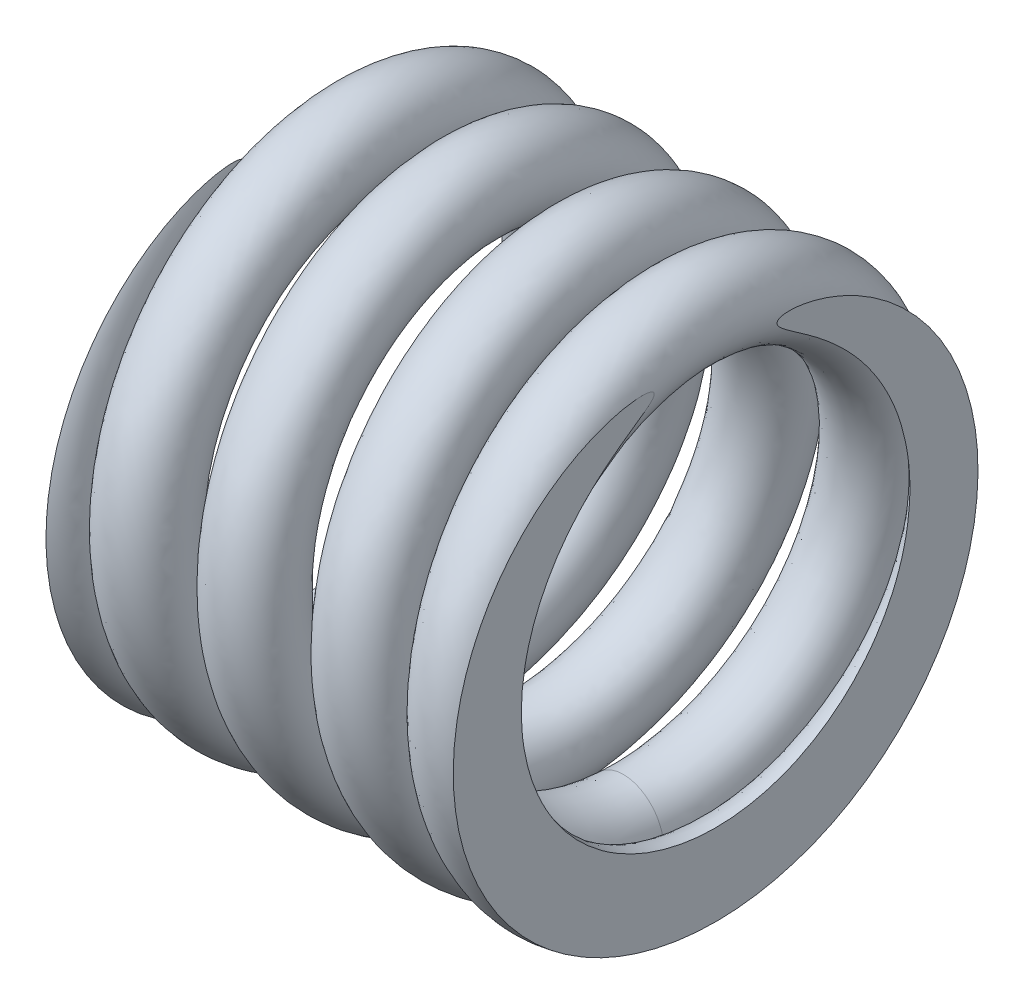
ISO-10303-21;
HEADER;
FILE_DESCRIPTION(('STEP AP214'),'2;1');
FILE_NAME('part.step','',(''),(''),'','','');
FILE_SCHEMA(('AUTOMOTIVE_DESIGN { 1 0 10303 214 1 1 1 1 }'));
ENDSEC;
DATA;
#1=APPLICATION_CONTEXT('core data for automotive mechanical design processes');
#2=APPLICATION_PROTOCOL_DEFINITION('international standard','automotive_design',2000,#1);
#3=PRODUCT_CONTEXT('',#1,'mechanical');
#4=PRODUCT('Part','Part','',(#3));
#5=PRODUCT_RELATED_PRODUCT_CATEGORY('part','',(#4));
#6=PRODUCT_DEFINITION_FORMATION('','',#4);
#7=PRODUCT_DEFINITION_CONTEXT('part definition',#1,'design');
#8=PRODUCT_DEFINITION('design','',#6,#7);
#9=PRODUCT_DEFINITION_SHAPE('','',#8);
#10=(LENGTH_UNIT() NAMED_UNIT(*) SI_UNIT(.MILLI.,.METRE.));
#11=(NAMED_UNIT(*) PLANE_ANGLE_UNIT() SI_UNIT($,.RADIAN.));
#12=(NAMED_UNIT(*) SI_UNIT($,.STERADIAN.) SOLID_ANGLE_UNIT());
#13=UNCERTAINTY_MEASURE_WITH_UNIT(LENGTH_MEASURE(1.E-05),#10,'distance_accuracy_value','');
#14=(GEOMETRIC_REPRESENTATION_CONTEXT(3) GLOBAL_UNCERTAINTY_ASSIGNED_CONTEXT((#13)) GLOBAL_UNIT_ASSIGNED_CONTEXT((#10,
#11,#12)) REPRESENTATION_CONTEXT('',''));
#15=CARTESIAN_POINT('',(0.,0.,0.));
#16=DIRECTION('',(0.,0.,1.));
#17=DIRECTION('',(1.,0.,0.));
#18=AXIS2_PLACEMENT_3D('',#15,#16,#17);
#19=CARTESIAN_POINT('',(8.79999994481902,-5.59966698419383,0.0710461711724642));
#20=CARTESIAN_POINT('',(8.82283563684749,-5.59966698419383,-0.294177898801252));
#21=CARTESIAN_POINT('',(8.86944097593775,-5.5405680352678,-1.04017647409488));
#22=CARTESIAN_POINT('',(8.93793270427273,-5.230823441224,-2.09708886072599));
#23=CARTESIAN_POINT('',(9.00681994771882,-4.72065390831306,-3.07892126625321));
#24=CARTESIAN_POINT('',(9.07553108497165,-4.0297028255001,-3.94079809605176));
#25=CARTESIAN_POINT('',(9.14427380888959,-3.18292908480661,-4.65022959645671));
#26=CARTESIAN_POINT('',(9.2130287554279,-2.21501434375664,-5.18287065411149));
#27=CARTESIAN_POINT('',(9.2817849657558,-1.16107327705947,-5.5144604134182));
#28=CARTESIAN_POINT('',(9.35052911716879,-0.062975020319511,-5.63605806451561));
#29=CARTESIAN_POINT('',(9.41928024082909,1.03758986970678,-5.53897669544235));
#30=CARTESIAN_POINT('',(9.48802969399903,2.09862972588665,-5.23111436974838));
#31=CARTESIAN_POINT('',(9.55678184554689,3.07828609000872,-4.72028661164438));
#32=CARTESIAN_POINT('',(9.62552938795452,3.94074995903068,-4.02981685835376));
#33=CARTESIAN_POINT('',(9.69428132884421,4.65034085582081,-3.18296578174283));
#34=CARTESIAN_POINT('',(9.76302950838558,5.18291871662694,-2.21500372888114));
#35=CARTESIAN_POINT('',(9.83178148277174,5.51442267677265,-1.16106888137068));
#36=CARTESIAN_POINT('',(9.90052946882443,5.63603906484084,-0.0629796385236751));
#37=CARTESIAN_POINT('',(9.96928143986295,5.53898424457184,1.03759058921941));
#38=CARTESIAN_POINT('',(10.0380294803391,5.2311220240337,2.09863307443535));
#39=CARTESIAN_POINT('',(10.1067814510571,4.72028539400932,3.07828613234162));
#40=CARTESIAN_POINT('',(10.1755294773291,4.02981454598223,3.94074793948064));
#41=CARTESIAN_POINT('',(10.2442814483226,3.18296596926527,4.65034059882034));
#42=CARTESIAN_POINT('',(10.3130294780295,2.21500421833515,5.18291960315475));
#43=CARTESIAN_POINT('',(10.3817814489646,1.16106880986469,5.51442283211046));
#44=CARTESIAN_POINT('',(10.4505294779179,0.0629795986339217,5.63603876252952));
#45=CARTESIAN_POINT('',(10.5192814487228,-1.03759054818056,5.53898418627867));
#46=CARTESIAN_POINT('',(10.588029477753,-2.09863309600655,5.23112210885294));
#47=CARTESIAN_POINT('',(10.6567814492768,-3.07828615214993,4.72028541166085));
#48=CARTESIAN_POINT('',(10.7255294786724,-3.9407479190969,4.02981451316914));
#49=CARTESIAN_POINT('',(10.7942814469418,-4.65034059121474,3.18296596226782));
#50=CARTESIAN_POINT('',(10.8630294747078,-5.1829196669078,2.21500427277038));
#51=CARTESIAN_POINT('',(10.9317814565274,-5.51442281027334,1.16106881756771));
#52=CARTESIAN_POINT('',(11.0005294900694,-5.63603844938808,0.0629795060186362));
#53=CARTESIAN_POINT('',(11.0692814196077,-5.53898438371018,-1.03759062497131));
#54=CARTESIAN_POINT('',(11.138029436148,-5.23112332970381,-2.09863328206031));
#55=CARTESIAN_POINT('',(11.2067815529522,-4.72028446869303,-3.07828542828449));
#56=CARTESIAN_POINT('',(11.2755296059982,-4.02981095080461,-3.94074547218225));
#57=CARTESIAN_POINT('',(11.3442811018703,-3.18296899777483,-4.65034512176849));
#58=CARTESIAN_POINT('',(11.4130291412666,-2.21501090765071,-5.18293186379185));
#59=CARTESIAN_POINT('',(11.4817825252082,-1.16106343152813,-5.51440173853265));
#60=CARTESIAN_POINT('',(11.5505301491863,-0.0629795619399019,-5.63599776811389));
#61=CARTESIAN_POINT('',(11.6192783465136,1.03759628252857,-5.53906119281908));
#62=CARTESIAN_POINT('',(11.6880290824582,2.09869451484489,-5.2312121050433));
#63=CARTESIAN_POINT('',(11.7567895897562,3.07818308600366,-4.7200663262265));
#64=CARTESIAN_POINT('',(11.8255251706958,3.94053537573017,-4.02974020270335));
#65=CARTESIAN_POINT('',(11.8942597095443,4.65058974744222,-3.18347013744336));
#66=CARTESIAN_POINT('',(11.9630645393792,5.18392015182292,-2.21453580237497));
#67=CARTESIAN_POINT('',(12.0318192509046,5.51180170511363,-1.16041353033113));
#68=CARTESIAN_POINT('',(12.0776950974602,5.59952035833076,-0.427779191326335));
#69=CARTESIAN_POINT('',(12.1005305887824,5.59952035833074,-0.0625583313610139));
#70=CARTESIAN_POINT('',(8.8006628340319,-7.59966687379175,0.0710932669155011));
#71=CARTESIAN_POINT('',(8.82297499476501,-7.59966687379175,-0.28575767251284));
#72=CARTESIAN_POINT('',(8.87029339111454,-7.51454582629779,-1.49817612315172));
#73=CARTESIAN_POINT('',(8.93881056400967,-7.09147681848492,-2.84766362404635));
#74=CARTESIAN_POINT('',(9.00788828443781,-6.39413265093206,-4.20246591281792));
#75=CARTESIAN_POINT('',(9.07613425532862,-5.45234344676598,-5.36345409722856));
#76=CARTESIAN_POINT('',(9.14496411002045,-4.30151091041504,-6.32398027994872));
#77=CARTESIAN_POINT('',(9.21395990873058,-2.98565005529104,-7.04234394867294));
#78=CARTESIAN_POINT('',(9.28264194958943,-1.55371296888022,-7.4887244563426));
#79=CARTESIAN_POINT('',(9.35128289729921,-0.0629440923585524,-7.64893427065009));
#80=CARTESIAN_POINT('',(9.42007315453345,1.43020265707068,-7.51320678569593));
#81=CARTESIAN_POINT('',(9.48885997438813,2.86886739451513,-7.09081263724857));
#82=CARTESIAN_POINT('',(9.55759609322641,4.19655324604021,-6.39397013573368));
#83=CARTESIAN_POINT('',(9.62633149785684,5.3640461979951,-5.45317923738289));
#84=CARTESIAN_POINT('',(9.69508913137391,6.32396995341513,-4.30131297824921));
#85=CARTESIAN_POINT('',(9.76384090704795,7.04256934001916,-2.98535110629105));
#86=CARTESIAN_POINT('',(9.83259106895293,7.48862772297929,-1.5538150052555));
#87=CARTESIAN_POINT('',(9.90133806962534,7.64893127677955,-0.0630299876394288));
#88=CARTESIAN_POINT('',(9.97009057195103,7.51320937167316,1.43023582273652));
#89=CARTESIAN_POINT('',(10.0388388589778,7.09081117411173,2.86888715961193));
#90=CARTESIAN_POINT('',(10.1075906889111,6.39397275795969,4.19654625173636));
#91=CARTESIAN_POINT('',(10.1763386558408,5.45317986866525,5.36404209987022));
#92=CARTESIAN_POINT('',(10.2450906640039,4.3013118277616,6.32397067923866));
#93=CARTESIAN_POINT('',(10.3138387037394,2.98535118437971,7.04257028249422));
#94=CARTESIAN_POINT('',(10.382590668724,1.55381516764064,7.48862783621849));
#95=CARTESIAN_POINT('',(10.4513386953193,0.0630298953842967,7.64893098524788));
#96=CARTESIAN_POINT('',(10.520090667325,-1.43023578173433,7.5132093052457));
#97=CARTESIAN_POINT('',(10.588838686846,-2.86888712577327,7.090811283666));
#98=CARTESIAN_POINT('',(10.657590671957,-4.19654628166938,6.39397277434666));
#99=CARTESIAN_POINT('',(10.7263387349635,-5.36404211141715,5.4531798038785));
#100=CARTESIAN_POINT('',(10.79509064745,-6.32397067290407,4.30131181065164));
#101=CARTESIAN_POINT('',(10.8638385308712,-7.04257032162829,2.98535129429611));
#102=CARTESIAN_POINT('',(10.9325907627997,-7.48862782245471,1.5538151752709));
#103=CARTESIAN_POINT('',(11.0013393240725,-7.64893066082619,0.0630297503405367));
#104=CARTESIAN_POINT('',(11.0700902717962,-7.5132095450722,-1.43023562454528));
#105=CARTESIAN_POINT('',(11.1388364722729,-7.0908124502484,-2.86888772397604));
#106=CARTESIAN_POINT('',(11.2075921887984,-6.39397084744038,-4.19654689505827));
#107=CARTESIAN_POINT('',(11.2763459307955,-5.45317831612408,-5.36403671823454));
#108=CARTESIAN_POINT('',(11.3450852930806,-4.30132188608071,-6.32397135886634));
#109=CARTESIAN_POINT('',(11.4138172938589,-2.98534151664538,-7.04259168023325));
#110=CARTESIAN_POINT('',(11.4826080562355,-1.55377733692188,-7.48861160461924));
#111=CARTESIAN_POINT('',(11.5513947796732,-0.0631110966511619,-7.64887429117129));
#112=CARTESIAN_POINT('',(11.6200398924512,1.4301348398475,-7.51334401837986));
#113=CARTESIAN_POINT('',(11.6887160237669,2.86923740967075,-7.09072909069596));
#114=CARTESIAN_POINT('',(11.7577189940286,4.19667906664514,-6.39385513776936));
#115=CARTESIAN_POINT('',(11.8265357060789,5.3631049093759,-5.45253844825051));
#116=CARTESIAN_POINT('',(11.8948274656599,6.32401016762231,-4.30683511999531));
#117=CARTESIAN_POINT('',(11.9637391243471,7.04453982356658,-2.96619573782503));
#118=CARTESIAN_POINT('',(12.0328315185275,7.48570070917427,-1.6149190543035));
#119=CARTESIAN_POINT('',(12.0786449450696,7.59952012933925,-0.427924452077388));
#120=CARTESIAN_POINT('',(12.101485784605,7.59952012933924,-0.0626180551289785));
#121=CARTESIAN_POINT('',(6.80066294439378,-7.6003329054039,-0.0709990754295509));
#122=CARTESIAN_POINT('',(6.82297510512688,-7.60033290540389,-0.427850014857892));
#123=CARTESIAN_POINT('',(6.86873665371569,-7.48674897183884,-1.61387429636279));
#124=CARTESIAN_POINT('',(6.93788619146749,-7.04531561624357,-2.9665800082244));
#125=CARTESIAN_POINT('',(7.00678909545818,-6.32475367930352,-4.3071579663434));
#126=CARTESIAN_POINT('',(7.07508331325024,-5.36375098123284,-5.45305960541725));
#127=CARTESIAN_POINT('',(7.14389904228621,-4.1972226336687,-6.39447289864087));
#128=CARTESIAN_POINT('',(7.2129027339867,-2.86963977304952,-7.09144833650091));
#129=CARTESIAN_POINT('',(7.28157832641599,-1.4303990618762,-7.51412516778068));
#130=CARTESIAN_POINT('',(7.35022386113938,0.0630140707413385,-7.64969225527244));
#131=CARTESIAN_POINT('',(7.41901014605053,1.5538322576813,-7.4894346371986));
#132=CARTESIAN_POINT('',(7.48780137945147,2.98556488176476,-7.04338438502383));
#133=CARTESIAN_POINT('',(7.55653291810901,4.30168758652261,-6.32471072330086));
#134=CARTESIAN_POINT('',(7.62527273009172,5.4536880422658,-5.36468362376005));
#135=CARTESIAN_POINT('',(7.69402601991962,6.39459165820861,-4.19709003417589));
#136=CARTESIAN_POINT('',(7.76278219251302,7.09153092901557,-2.86929031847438));
#137=CARTESIAN_POINT('',(7.83152793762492,7.51399094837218,-1.43049984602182));
#138=CARTESIAN_POINT('',(7.90027933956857,7.64974851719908,0.0629327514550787));
#139=CARTESIAN_POINT('',(7.96902744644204,7.48945085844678,1.55387009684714));
#140=CARTESIAN_POINT('',(8.0377801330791,7.04336304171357,2.98557465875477));
#141=CARTESIAN_POINT('',(8.10652756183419,6.32471004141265,4.3016775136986));
#142=CARTESIAN_POINT('',(8.17527992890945,5.3646890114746,5.45368952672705));
#143=CARTESIAN_POINT('',(8.24402753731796,4.19708942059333,6.39459358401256));
#144=CARTESIAN_POINT('',(8.31277997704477,2.86928972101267,7.09152976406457));
#145=CARTESIAN_POINT('',(8.38152754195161,1.43050000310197,7.51399070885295));
#146=CARTESIAN_POINT('',(8.45027996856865,-0.0629328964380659,7.64974884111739));
#147=CARTESIAN_POINT('',(8.51902754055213,-1.55387008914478,7.48945087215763));
#148=CARTESIAN_POINT('',(8.58777996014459,-2.98557454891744,7.04336300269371));
#149=CARTESIAN_POINT('',(8.65652754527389,-4.30167753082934,6.3247100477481));
#150=CARTESIAN_POINT('',(8.72528000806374,-5.45368959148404,5.36468899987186));
#151=CARTESIAN_POINT('',(8.79402752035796,-6.39459356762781,4.19708939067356));
#152=CARTESIAN_POINT('',(8.86277980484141,-7.09152965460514,2.86928975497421));
#153=CARTESIAN_POINT('',(8.93152763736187,-7.51399077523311,1.43050004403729));
#154=CARTESIAN_POINT('',(9.00028059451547,-7.64974913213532,-0.0629329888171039));
#155=CARTESIAN_POINT('',(9.06902714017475,-7.4894507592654,-1.55386992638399));
#156=CARTESIAN_POINT('',(9.13777775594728,-7.04336206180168,-2.98557447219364));
#157=CARTESIAN_POINT('',(9.20652907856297,-6.32470932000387,-4.30167868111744));
#158=CARTESIAN_POINT('',(9.27528716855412,-5.36469309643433,-5.45368895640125));
#159=CARTESIAN_POINT('',(9.34402211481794,-4.19709639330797,-6.39459093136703));
#160=CARTESIAN_POINT('',(9.41275867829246,-2.86926997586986,-7.0915311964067));
#161=CARTESIAN_POINT('',(9.48154507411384,-1.43046685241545,-7.51398798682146));
#162=CARTESIAN_POINT('',(9.5503357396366,0.0628469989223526,-7.64975278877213));
#163=CARTESIAN_POINT('',(9.61897641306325,1.55376780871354,-7.48954487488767));
#164=CARTESIAN_POINT('',(9.68765806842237,2.98587386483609,-7.04314665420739));
#165=CARTESIAN_POINT('',(9.7566565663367,4.30187645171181,-6.32468212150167));
#166=CARTESIAN_POINT('',(9.82547544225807,5.45285313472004,-5.36424079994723));
#167=CARTESIAN_POINT('',(9.89376348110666,6.39475020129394,-4.20248985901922));
#168=CARTESIAN_POINT('',(9.96268231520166,7.09220905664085,-2.85000629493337));
#169=CARTESIAN_POINT('',(10.0317689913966,7.51512325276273,-1.49169199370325));
#170=CARTESIAN_POINT('',(10.0775837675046,7.6004794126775,-0.30280778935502));
#171=CARTESIAN_POINT('',(10.1004246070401,7.60047941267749,0.0624986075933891));
#172=CARTESIAN_POINT('',(6.80000005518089,-5.60033301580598,-0.0710461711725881));
#173=CARTESIAN_POINT('',(6.82257398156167,-5.60033301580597,-0.432083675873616));
#174=CARTESIAN_POINT('',(6.86800608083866,-5.51277118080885,-1.15782333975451));
#175=CARTESIAN_POINT('',(6.93697569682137,-5.18466223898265,-2.21548329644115));
#176=CARTESIAN_POINT('',(7.0057294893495,-4.65127493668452,-3.1837529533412));
#177=CARTESIAN_POINT('',(7.07447780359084,-3.94111035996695,-4.03036619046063));
#178=CARTESIAN_POINT('',(7.14320936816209,-3.07864080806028,-4.72073224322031));
#179=CARTESIAN_POINT('',(7.21197141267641,-2.09900406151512,-5.23197235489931));
#180=CARTESIAN_POINT('',(7.28072138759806,-1.03775937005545,-5.53986184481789));
#181=CARTESIAN_POINT('',(7.34947006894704,0.0629831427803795,-5.63681585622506));
#182=CARTESIAN_POINT('',(7.41821723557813,1.16121947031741,-5.51520459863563));
#183=CARTESIAN_POINT('',(7.48697109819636,2.21532721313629,-5.18368610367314));
#184=CARTESIAN_POINT('',(7.55571867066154,3.18342043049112,-4.65102720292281));
#185=CARTESIAN_POINT('',(7.62447062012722,4.03039180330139,-3.94132124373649));
#186=CARTESIAN_POINT('',(7.69321821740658,4.72096256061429,-3.07874283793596));
#187=CARTESIAN_POINT('',(7.76197079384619,5.23188030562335,-2.09894294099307));
#188=CARTESIAN_POINT('',(7.83071835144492,5.53978590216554,-1.03775372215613));
#189=CARTESIAN_POINT('',(7.89947073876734,5.63685630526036,0.0629831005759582));
#190=CARTESIAN_POINT('',(7.96821831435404,5.51522573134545,1.16122486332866));
#191=CARTESIAN_POINT('',(8.03697075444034,5.18367389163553,2.21532057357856));
#192=CARTESIAN_POINT('',(8.1057183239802,4.65102267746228,3.18341739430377));
#193=CARTESIAN_POINT('',(8.1744707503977,3.94132368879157,4.03039536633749));
#194=CARTESIAN_POINT('',(8.24321832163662,3.078743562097,4.72096350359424));
#195=CARTESIAN_POINT('',(8.31197075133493,2.09894275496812,5.2318790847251));
#196=CARTESIAN_POINT('',(8.38071832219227,1.03775364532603,5.53978570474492));
#197=CARTESIAN_POINT('',(8.44947075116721,-0.0629831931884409,5.63685661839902));
#198=CARTESIAN_POINT('',(8.51821832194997,-1.16122485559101,5.51522575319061));
#199=CARTESIAN_POINT('',(8.58697075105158,-2.21532051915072,5.18367382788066));
#200=CARTESIAN_POINT('',(8.65571832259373,-3.18341740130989,4.6510226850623));
#201=CARTESIAN_POINT('',(8.72447075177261,-4.03039539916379,3.94132370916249));
#202=CARTESIAN_POINT('',(8.79321831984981,-4.72096348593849,3.07874354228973));
#203=CARTESIAN_POINT('',(8.86197074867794,-5.23187899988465,2.09894273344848));
#204=CARTESIAN_POINT('',(8.93071833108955,-5.53978576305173,1.03775368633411));
#205=CARTESIAN_POINT('',(8.99947076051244,-5.6368569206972,-0.0629832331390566));
#206=CARTESIAN_POINT('',(9.06821828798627,-5.51522559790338,-1.16122492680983));
#207=CARTESIAN_POINT('',(9.13697071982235,-5.18367294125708,-2.21532003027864));
#208=CARTESIAN_POINT('',(9.20571844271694,-4.65102294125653,-3.18341721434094));
#209=CARTESIAN_POINT('',(9.27447084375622,-3.94132573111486,-4.03039771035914));
#210=CARTESIAN_POINT('',(9.34321792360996,-3.07874350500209,-4.72096469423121));
#211=CARTESIAN_POINT('',(9.41197052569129,-2.09893936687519,-5.23187138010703));
#212=CARTESIAN_POINT('',(9.48071954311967,-1.03775294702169,-5.53977812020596));
#213=CARTESIAN_POINT('',(9.54947110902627,0.0629785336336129,-5.63687626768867));
#214=CARTESIAN_POINT('',(9.61821486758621,1.16122925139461,-5.51526204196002));
#215=CARTESIAN_POINT('',(9.68697112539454,2.21533097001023,-5.18362969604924));
#216=CARTESIAN_POINT('',(9.75572716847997,3.18338047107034,-4.65089320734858));
#217=CARTESIAN_POINT('',(9.8244648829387,4.03028360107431,-3.94144293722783));
#218=CARTESIAN_POINT('',(9.89319581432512,4.72132978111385,-3.07912344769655));
#219=CARTESIAN_POINT('',(9.96200739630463,5.23158938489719,-2.09835170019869));
#220=CARTESIAN_POINT('',(10.030757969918,5.54122424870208,-1.0371665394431));
#221=CARTESIAN_POINT('',(10.0766312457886,5.60047964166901,-0.302705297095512));
#222=CARTESIAN_POINT('',(10.0994694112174,5.600479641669,0.0625583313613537));
#223=CARTESIAN_POINT('',(6.799337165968,-3.60033312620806,-0.0710932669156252));
#224=CARTESIAN_POINT('',(6.82217285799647,-3.60033312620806,-0.436317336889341));
#225=CARTESIAN_POINT('',(6.86727550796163,-3.53879338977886,-0.70177238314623));
#226=CARTESIAN_POINT('',(6.93606520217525,-3.32400886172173,-1.4643865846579));
#227=CARTESIAN_POINT('',(7.00466988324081,-2.97779619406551,-2.06034794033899));
#228=CARTESIAN_POINT('',(7.07387229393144,-2.51846973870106,-2.60767277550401));
#229=CARTESIAN_POINT('',(7.14251969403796,-1.96005898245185,-3.04699158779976));
#230=CARTESIAN_POINT('',(7.21104009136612,-1.32836834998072,-3.37249637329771));
#231=CARTESIAN_POINT('',(7.27986444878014,-0.645119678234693,-3.56559852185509));
#232=CARTESIAN_POINT('',(7.34871627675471,0.0629522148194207,-3.62393945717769));
#233=CARTESIAN_POINT('',(7.41742432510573,0.768606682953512,-3.54097456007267));
#234=CARTESIAN_POINT('',(7.48614081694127,1.44508954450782,-3.32398782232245));
#235=CARTESIAN_POINT('',(7.55490442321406,2.06515327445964,-2.97734368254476));
#236=CARTESIAN_POINT('',(7.62366851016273,2.60709556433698,-2.51795886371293));
#237=CARTESIAN_POINT('',(7.69241041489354,3.04733346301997,-1.96039564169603));
#238=CARTESIAN_POINT('',(7.76115939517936,3.37222968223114,-1.32859556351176));
#239=CARTESIAN_POINT('',(7.82990876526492,3.56558085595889,-0.645007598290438));
#240=CARTESIAN_POINT('',(7.89866213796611,3.62396409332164,0.063033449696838));
#241=CARTESIAN_POINT('',(7.96740918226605,3.54100060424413,0.76857962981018));
#242=CARTESIAN_POINT('',(8.03616137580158,3.3239847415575,1.44506648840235));
#243=CARTESIAN_POINT('',(8.10490908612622,2.97733531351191,2.06515727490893));
#244=CARTESIAN_POINT('',(8.17366157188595,2.51795836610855,2.60710120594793));
#245=CARTESIAN_POINT('',(8.24240910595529,1.96039770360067,3.04733342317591));
#246=CARTESIAN_POINT('',(8.31116152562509,1.32859578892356,3.37222840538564));
#247=CARTESIAN_POINT('',(8.37990910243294,0.645007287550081,3.56558070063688));
#248=CARTESIAN_POINT('',(8.44866153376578,-0.0630334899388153,3.62396439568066));
#249=CARTESIAN_POINT('',(8.51740910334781,-0.768579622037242,3.54100063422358));
#250=CARTESIAN_POINT('',(8.58616154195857,-1.445066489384,3.3239846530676));
#251=CARTESIAN_POINT('',(8.65490909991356,-2.06515727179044,2.9773353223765));
#252=CARTESIAN_POINT('',(8.72366149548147,-2.60710120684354,2.51795841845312));
#253=CARTESIAN_POINT('',(8.79240911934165,-3.04733340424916,1.96039769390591));
#254=CARTESIAN_POINT('',(8.86116169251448,-3.37222834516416,1.32859571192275));
#255=CARTESIAN_POINT('',(8.92990902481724,-3.56558075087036,0.64500732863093));
#256=CARTESIAN_POINT('',(8.99866092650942,-3.62396470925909,-0.0630334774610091));
#257=CARTESIAN_POINT('',(9.0674094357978,-3.54100043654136,-0.76857992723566));
#258=CARTESIAN_POINT('',(9.1361636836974,-3.3239838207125,-1.44506558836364));
#259=CARTESIAN_POINT('',(9.20490780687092,-2.97733656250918,-2.06515574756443));
#260=CARTESIAN_POINT('',(9.27365451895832,-2.5179583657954,-2.60710646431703));
#261=CARTESIAN_POINT('',(9.34241373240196,-1.96039061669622,-3.04733845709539));
#262=CARTESIAN_POINT('',(9.41118237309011,-1.32860875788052,-3.37221156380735));
#263=CARTESIAN_POINT('',(9.47989401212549,-0.64503904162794,-3.56556825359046));
#264=CARTESIAN_POINT('',(9.54860647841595,0.0631100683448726,-3.6239997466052));
#265=CARTESIAN_POINT('',(9.61745332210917,0.768690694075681,-3.54097920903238));
#266=CARTESIAN_POINT('',(9.68628418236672,1.44478807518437,-3.3241127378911));
#267=CARTESIAN_POINT('',(9.75479777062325,2.06488449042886,-2.9771042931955));
#268=CARTESIAN_POINT('',(9.82345432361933,2.60771406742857,-2.51864507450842));
#269=CARTESIAN_POINT('',(9.89262814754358,3.04790936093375,-1.95575703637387));
#270=CARTESIAN_POINT('',(9.96133247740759,3.37096971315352,-1.346697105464));
#271=CARTESIAN_POINT('',(10.0297469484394,3.56732524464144,-0.582641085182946));
#272=CARTESIAN_POINT('',(10.0756787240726,3.60047987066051,-0.302602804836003));
#273=CARTESIAN_POINT('',(10.0985142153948,3.6004798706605,0.0626180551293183));
#274=CARTESIAN_POINT('',(8.79933705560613,-3.59966709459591,0.0709990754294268));
#275=CARTESIAN_POINT('',(8.82269627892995,-3.59966709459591,-0.302598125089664));
#276=CARTESIAN_POINT('',(8.86858856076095,-3.56659024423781,-0.582176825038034));
#277=CARTESIAN_POINT('',(8.93705484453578,-3.37017006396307,-1.34651409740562));
#278=CARTESIAN_POINT('',(9.00575161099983,-3.04717516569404,-1.95537661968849));
#279=CARTESIAN_POINT('',(9.07492791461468,-2.60706220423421,-2.51814209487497));
#280=CARTESIAN_POINT('',(9.14358350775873,-2.06434725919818,-2.9764789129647));
#281=CARTESIAN_POINT('',(9.21209760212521,-1.44437863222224,-3.32339735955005));
#282=CARTESIAN_POINT('',(9.28092798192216,-0.768433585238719,-3.5401963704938));
#283=CARTESIAN_POINT('',(9.34977533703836,-0.0630059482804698,-3.62318185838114));
#284=CARTESIAN_POINT('',(9.41848732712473,0.644977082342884,-3.56474660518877));
#285=CARTESIAN_POINT('',(9.48719941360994,1.32839205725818,-3.37141610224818));
#286=CARTESIAN_POINT('',(9.55596759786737,1.96001893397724,-3.04660308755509));
#287=CARTESIAN_POINT('',(9.6247272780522,2.51745372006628,-2.60645447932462));
#288=CARTESIAN_POINT('',(9.69347352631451,2.97671175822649,-2.06461858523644));
#289=CARTESIAN_POINT('',(9.76221810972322,3.32326809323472,-1.44465635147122));
#290=CARTESIAN_POINT('',(9.83097189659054,3.540217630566,-0.768322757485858));
#291=CARTESIAN_POINT('',(9.89972086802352,3.62314685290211,-0.0629292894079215));
#292=CARTESIAN_POINT('',(9.96847230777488,3.56475911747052,0.644945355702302));
#293=CARTESIAN_POINT('',(10.0372201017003,3.37143287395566,1.32837898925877));
#294=CARTESIAN_POINT('',(10.1059722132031,3.04659803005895,1.96002601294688));
#295=CARTESIAN_POINT('',(10.1747202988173,2.60644922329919,2.51745377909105));
#296=CARTESIAN_POINT('',(10.2434722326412,2.06462011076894,2.97671051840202));
#297=CARTESIAN_POINT('',(10.3122202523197,1.44465725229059,3.32326892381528));
#298=CARTESIAN_POINT('',(10.3809722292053,0.768322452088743,3.54021782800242));
#299=CARTESIAN_POINT('',(10.4497202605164,0.0629293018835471,3.62314653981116));
#300=CARTESIAN_POINT('',(10.5184722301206,-0.644945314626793,3.56475906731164));
#301=CARTESIAN_POINT('',(10.58722026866,-1.32837906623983,3.37143293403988));
#302=CARTESIAN_POINT('',(10.6559722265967,-1.96002602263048,3.04659804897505));
#303=CARTESIAN_POINT('',(10.7247202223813,-2.51745372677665,2.60644922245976));
#304=CARTESIAN_POINT('',(10.7934722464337,-2.97671050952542,2.06462011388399));
#305=CARTESIAN_POINT('',(10.8622204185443,-3.3232690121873,1.44465725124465));
#306=CARTESIAN_POINT('',(10.9309721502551,-3.54021779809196,0.768322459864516));
#307=CARTESIAN_POINT('',(10.9997196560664,-3.62314623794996,0.0629292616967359));
#308=CARTESIAN_POINT('',(11.0684725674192,-3.56475922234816,-0.644945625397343));
#309=CARTESIAN_POINT('',(11.1372224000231,-3.37143420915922,-1.32837884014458));
#310=CARTESIAN_POINT('',(11.205970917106,-3.04659808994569,-1.96002396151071));
#311=CARTESIAN_POINT('',(11.274713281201,-2.60644358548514,-2.51745422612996));
#312=CARTESIAN_POINT('',(11.3434769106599,-2.06461610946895,-2.97671888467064));
#313=CARTESIAN_POINT('',(11.4122409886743,-1.44468029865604,-3.32327204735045));
#314=CARTESIAN_POINT('',(11.480956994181,-0.768349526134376,-3.54019187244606));
#315=CARTESIAN_POINT('',(11.5496655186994,-0.0628480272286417,-3.62312124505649));
#316=CARTESIAN_POINT('',(11.6185168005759,0.645057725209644,-3.56477836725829));
#317=CARTESIAN_POINT('',(11.6873421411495,1.32815162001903,-3.37169511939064));
#318=CARTESIAN_POINT('',(11.7558601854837,1.95968710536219,-3.04627751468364));
#319=CARTESIAN_POINT('',(11.8245146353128,2.51796584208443,-2.60694195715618));
#320=CARTESIAN_POINT('',(11.8936919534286,2.97716932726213,-2.06010515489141));
#321=CARTESIAN_POINT('',(11.9623899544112,3.32330048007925,-1.4628758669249));
#322=CARTESIAN_POINT('',(12.0308069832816,3.53790270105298,-0.705908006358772));
#323=CARTESIAN_POINT('',(12.0767452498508,3.59952058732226,-0.427633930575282));
#324=CARTESIAN_POINT('',(12.0995753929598,3.59952058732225,-0.0624986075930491));
#325=CARTESIAN_POINT('',(8.79999994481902,-5.59966698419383,0.0710461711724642));
#326=CARTESIAN_POINT('',(8.82283563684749,-5.59966698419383,-0.294177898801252));
#327=CARTESIAN_POINT('',(8.86944097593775,-5.5405680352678,-1.04017647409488));
#328=CARTESIAN_POINT('',(8.93793270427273,-5.230823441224,-2.09708886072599));
#329=CARTESIAN_POINT('',(9.00681994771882,-4.72065390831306,-3.07892126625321));
#330=CARTESIAN_POINT('',(9.07553108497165,-4.0297028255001,-3.94079809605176));
#331=CARTESIAN_POINT('',(9.14427380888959,-3.18292908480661,-4.65022959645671));
#332=CARTESIAN_POINT('',(9.2130287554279,-2.21501434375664,-5.18287065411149));
#333=CARTESIAN_POINT('',(9.2817849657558,-1.16107327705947,-5.5144604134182));
#334=CARTESIAN_POINT('',(9.35052911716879,-0.062975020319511,-5.63605806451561));
#335=CARTESIAN_POINT('',(9.41928024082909,1.03758986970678,-5.53897669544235));
#336=CARTESIAN_POINT('',(9.48802969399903,2.09862972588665,-5.23111436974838));
#337=CARTESIAN_POINT('',(9.55678184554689,3.07828609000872,-4.72028661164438));
#338=CARTESIAN_POINT('',(9.62552938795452,3.94074995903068,-4.02981685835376));
#339=CARTESIAN_POINT('',(9.69428132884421,4.65034085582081,-3.18296578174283));
#340=CARTESIAN_POINT('',(9.76302950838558,5.18291871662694,-2.21500372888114));
#341=CARTESIAN_POINT('',(9.83178148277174,5.51442267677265,-1.16106888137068));
#342=CARTESIAN_POINT('',(9.90052946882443,5.63603906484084,-0.0629796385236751));
#343=CARTESIAN_POINT('',(9.96928143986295,5.53898424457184,1.03759058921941));
#344=CARTESIAN_POINT('',(10.0380294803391,5.2311220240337,2.09863307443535));
#345=CARTESIAN_POINT('',(10.1067814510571,4.72028539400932,3.07828613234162));
#346=CARTESIAN_POINT('',(10.1755294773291,4.02981454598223,3.94074793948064));
#347=CARTESIAN_POINT('',(10.2442814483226,3.18296596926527,4.65034059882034));
#348=CARTESIAN_POINT('',(10.3130294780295,2.21500421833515,5.18291960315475));
#349=CARTESIAN_POINT('',(10.3817814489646,1.16106880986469,5.51442283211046));
#350=CARTESIAN_POINT('',(10.4505294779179,0.0629795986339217,5.63603876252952));
#351=CARTESIAN_POINT('',(10.5192814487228,-1.03759054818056,5.53898418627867));
#352=CARTESIAN_POINT('',(10.588029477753,-2.09863309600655,5.23112210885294));
#353=CARTESIAN_POINT('',(10.6567814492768,-3.07828615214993,4.72028541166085));
#354=CARTESIAN_POINT('',(10.7255294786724,-3.9407479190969,4.02981451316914));
#355=CARTESIAN_POINT('',(10.7942814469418,-4.65034059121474,3.18296596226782));
#356=CARTESIAN_POINT('',(10.8630294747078,-5.1829196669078,2.21500427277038));
#357=CARTESIAN_POINT('',(10.9317814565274,-5.51442281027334,1.16106881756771));
#358=CARTESIAN_POINT('',(11.0005294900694,-5.63603844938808,0.0629795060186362));
#359=CARTESIAN_POINT('',(11.0692814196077,-5.53898438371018,-1.03759062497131));
#360=CARTESIAN_POINT('',(11.138029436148,-5.23112332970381,-2.09863328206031));
#361=CARTESIAN_POINT('',(11.2067815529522,-4.72028446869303,-3.07828542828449));
#362=CARTESIAN_POINT('',(11.2755296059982,-4.02981095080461,-3.94074547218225));
#363=CARTESIAN_POINT('',(11.3442811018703,-3.18296899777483,-4.65034512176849));
#364=CARTESIAN_POINT('',(11.4130291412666,-2.21501090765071,-5.18293186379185));
#365=CARTESIAN_POINT('',(11.4817825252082,-1.16106343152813,-5.51440173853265));
#366=CARTESIAN_POINT('',(11.5505301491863,-0.0629795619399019,-5.63599776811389));
#367=CARTESIAN_POINT('',(11.6192783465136,1.03759628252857,-5.53906119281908));
#368=CARTESIAN_POINT('',(11.6880290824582,2.09869451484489,-5.2312121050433));
#369=CARTESIAN_POINT('',(11.7567895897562,3.07818308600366,-4.7200663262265));
#370=CARTESIAN_POINT('',(11.8255251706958,3.94053537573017,-4.02974020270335));
#371=CARTESIAN_POINT('',(11.8942597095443,4.65058974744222,-3.18347013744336));
#372=CARTESIAN_POINT('',(11.9630645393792,5.18392015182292,-2.21453580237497));
#373=CARTESIAN_POINT('',(12.0318192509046,5.51180170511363,-1.16041353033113));
#374=CARTESIAN_POINT('',(12.0776950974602,5.59952035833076,-0.427779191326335));
#375=CARTESIAN_POINT('',(12.1005305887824,5.59952035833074,-0.0625583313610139));
#376=(BOUNDED_SURFACE() B_SPLINE_SURFACE(3,3,((#19,#20,#21,#22,#23,#24,#25,#26,#27,#28,#29,#30,
#31,#32,#33,#34,#35,#36,#37,#38,#39,#40,#41,#42,#43,#44,#45,#46,#47,#48,#49,#50,#51,#52,#53,#54,
#55,#56,#57,#58,#59,#60,#61,#62,#63,#64,#65,#66,#67,#68,#69),(#70,#71,#72,#73,#74,#75,#76,#77,
#78,#79,#80,#81,#82,#83,#84,#85,#86,#87,#88,#89,#90,#91,#92,#93,#94,#95,#96,#97,#98,#99,#100,
#101,#102,#103,#104,#105,#106,#107,#108,#109,#110,#111,#112,#113,#114,#115,#116,#117,#118,#119,
#120),(#121,#122,#123,#124,#125,#126,#127,#128,#129,#130,#131,#132,#133,#134,#135,#136,#137,
#138,#139,#140,#141,#142,#143,#144,#145,#146,#147,#148,#149,#150,#151,#152,#153,#154,#155,#156,
#157,#158,#159,#160,#161,#162,#163,#164,#165,#166,#167,#168,#169,#170,#171),(#172,#173,#174,
#175,#176,#177,#178,#179,#180,#181,#182,#183,#184,#185,#186,#187,#188,#189,#190,#191,#192,#193,
#194,#195,#196,#197,#198,#199,#200,#201,#202,#203,#204,#205,#206,#207,#208,#209,#210,#211,#212,
#213,#214,#215,#216,#217,#218,#219,#220,#221,#222),(#223,#224,#225,#226,#227,#228,#229,#230,
#231,#232,#233,#234,#235,#236,#237,#238,#239,#240,#241,#242,#243,#244,#245,#246,#247,#248,#249,
#250,#251,#252,#253,#254,#255,#256,#257,#258,#259,#260,#261,#262,#263,#264,#265,#266,#267,#268,
#269,#270,#271,#272,#273),(#274,#275,#276,#277,#278,#279,#280,#281,#282,#283,#284,#285,#286,
#287,#288,#289,#290,#291,#292,#293,#294,#295,#296,#297,#298,#299,#300,#301,#302,#303,#304,#305,
#306,#307,#308,#309,#310,#311,#312,#313,#314,#315,#316,#317,#318,#319,#320,#321,#322,#323,#324),
(#325,#326,#327,#328,#329,#330,#331,#332,#333,#334,#335,#336,#337,#338,#339,#340,#341,#342,#343,
#344,#345,#346,#347,#348,#349,#350,#351,#352,#353,#354,#355,#356,#357,#358,#359,#360,#361,#362,
#363,#364,#365,#366,#367,#368,#369,#370,#371,#372,#373,#374,#375)),.UNSPECIFIED.,.T.,.F.,
.F.) B_SPLINE_SURFACE_WITH_KNOTS((4,3,4),(4,1,1,1,1,1,1,1,1,1,1,1,1,1,1,1,1,1,1,1,1,1,1,1,1,1,1,
1,1,1,1,1,1,1,1,1,1,1,1,1,1,1,1,1,1,1,1,1,4),(0.,0.5,1.),(0.,0.020814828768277,
0.0416871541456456,0.0625298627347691,0.083354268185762,0.104185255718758,0.125019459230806,
0.145852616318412,0.166685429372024,0.187518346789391,0.208351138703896,0.229184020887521,
0.250016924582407,0.270849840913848,0.291682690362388,0.312515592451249,0.333348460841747,
0.354181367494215,0.375014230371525,0.395847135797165,0.416680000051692,0.437512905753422,
0.458345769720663,0.479178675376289,0.500011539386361,0.520844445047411,0.541677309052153,
0.562510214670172,0.583343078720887,0.604175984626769,0.625008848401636,0.645841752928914,
0.666674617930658,0.6875075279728,0.708340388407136,0.729173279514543,0.750006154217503,
0.770839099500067,0.791671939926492,0.812504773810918,0.833337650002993,0.854170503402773,
0.875003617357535,0.895837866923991,0.916668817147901,0.937493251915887,0.958335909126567,
0.979208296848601,1.),
.UNSPECIFIED.) GEOMETRIC_REPRESENTATION_ITEM() RATIONAL_B_SPLINE_SURFACE(((1.,1.,1.,1.,1.,1.,1.,
1.,1.,1.,1.,1.,1.,1.,1.,1.,1.,1.,1.,1.,1.,1.,1.,1.,1.,1.,1.,1.,1.,1.,1.,1.,1.,1.,1.,1.,1.,1.,1.,
1.,1.,1.,1.,1.,1.,1.,1.,1.,1.,1.,1.),(0.333333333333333,0.333333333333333,0.333333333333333,
0.333333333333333,0.333333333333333,0.333333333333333,0.333333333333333,0.333333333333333,
0.333333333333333,0.333333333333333,0.333333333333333,0.333333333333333,0.333333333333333,
0.333333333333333,0.333333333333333,0.333333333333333,0.333333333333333,0.333333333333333,
0.333333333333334,0.333333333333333,0.333333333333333,0.333333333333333,0.333333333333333,
0.333333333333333,0.333333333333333,0.333333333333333,0.333333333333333,0.333333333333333,
0.333333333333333,0.333333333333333,0.333333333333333,0.333333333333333,0.333333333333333,
0.333333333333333,0.333333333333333,0.333333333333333,0.333333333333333,0.333333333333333,
0.333333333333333,0.333333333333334,0.333333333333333,0.333333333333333,0.333333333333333,
0.333333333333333,0.333333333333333,0.333333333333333,0.333333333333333,0.333333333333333,
0.333333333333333,0.333333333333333,0.333333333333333),(0.333333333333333,0.333333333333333,
0.333333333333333,0.333333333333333,0.333333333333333,0.333333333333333,0.333333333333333,
0.333333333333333,0.333333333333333,0.333333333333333,0.333333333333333,0.333333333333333,
0.333333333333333,0.333333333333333,0.333333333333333,0.333333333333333,0.333333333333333,
0.333333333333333,0.333333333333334,0.333333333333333,0.333333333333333,0.333333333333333,
0.333333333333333,0.333333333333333,0.333333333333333,0.333333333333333,0.333333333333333,
0.333333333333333,0.333333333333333,0.333333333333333,0.333333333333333,0.333333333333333,
0.333333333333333,0.333333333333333,0.333333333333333,0.333333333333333,0.333333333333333,
0.333333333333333,0.333333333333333,0.333333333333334,0.333333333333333,0.333333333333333,
0.333333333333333,0.333333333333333,0.333333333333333,0.333333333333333,0.333333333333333,
0.333333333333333,0.333333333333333,0.333333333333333,0.333333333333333),(1.,1.,1.,1.,1.,1.,1.,
1.,1.,1.,1.,1.,1.,1.,1.,1.,1.,1.,1.,1.,1.,1.,1.,1.,1.,1.,1.,1.,1.,1.,1.,1.,1.,1.,1.,1.,1.,1.,1.,
1.,1.,1.,1.,1.,1.,1.,1.,1.,1.,1.,1.),(0.333333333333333,0.333333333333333,0.333333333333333,
0.333333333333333,0.333333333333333,0.333333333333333,0.333333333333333,0.333333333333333,
0.333333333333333,0.333333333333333,0.333333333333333,0.333333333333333,0.333333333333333,
0.333333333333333,0.333333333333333,0.333333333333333,0.333333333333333,0.333333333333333,
0.333333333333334,0.333333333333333,0.333333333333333,0.333333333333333,0.333333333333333,
0.333333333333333,0.333333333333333,0.333333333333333,0.333333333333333,0.333333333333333,
0.333333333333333,0.333333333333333,0.333333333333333,0.333333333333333,0.333333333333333,
0.333333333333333,0.333333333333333,0.333333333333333,0.333333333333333,0.333333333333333,
0.333333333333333,0.333333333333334,0.333333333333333,0.333333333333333,0.333333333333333,
0.333333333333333,0.333333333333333,0.333333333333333,0.333333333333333,0.333333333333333,
0.333333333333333,0.333333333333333,0.333333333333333),(0.333333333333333,0.333333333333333,
0.333333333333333,0.333333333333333,0.333333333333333,0.333333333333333,0.333333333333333,
0.333333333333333,0.333333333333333,0.333333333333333,0.333333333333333,0.333333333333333,
0.333333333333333,0.333333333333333,0.333333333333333,0.333333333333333,0.333333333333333,
0.333333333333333,0.333333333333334,0.333333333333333,0.333333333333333,0.333333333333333,
0.333333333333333,0.333333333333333,0.333333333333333,0.333333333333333,0.333333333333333,
0.333333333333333,0.333333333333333,0.333333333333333,0.333333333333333,0.333333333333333,
0.333333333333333,0.333333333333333,0.333333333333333,0.333333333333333,0.333333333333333,
0.333333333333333,0.333333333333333,0.333333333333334,0.333333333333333,0.333333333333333,
0.333333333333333,0.333333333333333,0.333333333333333,0.333333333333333,0.333333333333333,
0.333333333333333,0.333333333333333,0.333333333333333,0.333333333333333),(1.,1.,1.,1.,1.,1.,1.,
1.,1.,1.,1.,1.,1.,1.,1.,1.,1.,1.,1.,1.,1.,1.,1.,1.,1.,1.,1.,1.,1.,1.,1.,1.,1.,1.,1.,1.,1.,1.,1.,
1.,1.,1.,1.,1.,1.,1.,1.,1.,1.,1.,1.))) REPRESENTATION_ITEM('') SURFACE());
#377=CARTESIAN_POINT('',(8.79999994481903,-5.59966698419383,0.0710461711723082));
#378=CARTESIAN_POINT('',(8.79933705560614,-3.59966709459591,0.070999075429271));
#379=CARTESIAN_POINT('',(6.79933716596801,-3.60033312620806,-0.0710932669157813));
#380=CARTESIAN_POINT('',(6.8000000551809,-5.60033301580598,-0.0710461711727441));
#381=CARTESIAN_POINT('',(6.80066294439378,-7.6003329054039,-0.0709990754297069));
#382=CARTESIAN_POINT('',(8.80066283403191,-7.59966687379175,0.0710932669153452));
#383=CARTESIAN_POINT('',(8.79999994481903,-5.59966698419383,0.0710461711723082));
#384=(BOUNDED_CURVE() B_SPLINE_CURVE(3,(#377,#378,#379,#380,#381,#382,#383),.UNSPECIFIED.,.T.,
.F.) B_SPLINE_CURVE_WITH_KNOTS((4,3,4),(0.,0.5,1.),
.UNSPECIFIED.) CURVE() GEOMETRIC_REPRESENTATION_ITEM() RATIONAL_B_SPLINE_CURVE((1.,
0.333333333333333,0.333333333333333,1.,0.333333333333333,0.333333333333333,1.)) REPRESENTATION_ITEM(''));
#385=CARTESIAN_POINT('',(8.79999994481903,-5.59966698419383,0.0710461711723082));
#386=VERTEX_POINT('',#385);
#387=EDGE_CURVE('E368',#386,#386,#384,.F.);
#388=CARTESIAN_POINT('',(10.,5.39245734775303,1.50936976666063));
#389=CARTESIAN_POINT('',(10.0000000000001,5.38870950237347,1.50830070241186));
#390=CARTESIAN_POINT('',(10.0000000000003,5.38486221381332,1.507590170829));
#391=CARTESIAN_POINT('',(9.99999999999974,5.3770986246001,1.50686350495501));
#392=CARTESIAN_POINT('',(9.99999999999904,5.37318220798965,1.50684867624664));
#393=CARTESIAN_POINT('',(9.99999999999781,5.35906626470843,1.50788916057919));
#394=CARTESIAN_POINT('',(9.99999999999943,5.34901485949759,1.51072545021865));
#395=CARTESIAN_POINT('',(10.0000000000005,5.33045587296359,1.51832656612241));
#396=CARTESIAN_POINT('',(10.0000000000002,5.32189570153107,1.52298566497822));
#397=CARTESIAN_POINT('',(9.99999999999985,5.30542309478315,1.53337058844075));
#398=CARTESIAN_POINT('',(9.99999999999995,5.29751261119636,1.53909946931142));
#399=CARTESIAN_POINT('',(10.0000000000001,5.27488723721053,1.55694852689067));
#400=CARTESIAN_POINT('',(10.,5.2608876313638,1.56994809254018));
#401=CARTESIAN_POINT('',(9.99999999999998,5.23400330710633,1.59699519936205));
#402=CARTESIAN_POINT('',(9.99999999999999,5.22111855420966,1.61104270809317));
#403=CARTESIAN_POINT('',(10.,5.19597298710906,1.63983541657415));
#404=CARTESIAN_POINT('',(10.,5.18371646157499,1.65458435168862));
#405=CARTESIAN_POINT('',(10.,5.15967801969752,1.68444535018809));
#406=CARTESIAN_POINT('',(10.,5.14789584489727,1.69955720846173));
#407=CARTESIAN_POINT('',(10.,5.11339206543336,1.74474905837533));
#408=CARTESIAN_POINT('',(10.,5.09111436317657,1.7751663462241));
#409=CARTESIAN_POINT('',(10.,5.04709287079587,1.83638600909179));
#410=CARTESIAN_POINT('',(10.,5.02534918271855,1.86718845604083));
#411=CARTESIAN_POINT('',(10.,4.98204934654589,1.92894585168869));
#412=CARTESIAN_POINT('',(10.,4.96049328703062,1.95990086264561));
#413=CARTESIAN_POINT('',(10.,4.91736640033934,2.02180054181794));
#414=CARTESIAN_POINT('',(10.,4.89579557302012,2.0527452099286));
#415=CARTESIAN_POINT('',(10.,4.83104150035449,2.14514203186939));
#416=CARTESIAN_POINT('',(10.,4.78762665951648,2.20643400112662));
#417=CARTESIAN_POINT('',(9.99999999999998,4.69955844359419,2.3281164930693));
#418=CARTESIAN_POINT('',(9.99999999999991,4.65490514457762,2.38850707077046));
#419=CARTESIAN_POINT('',(9.99999999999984,4.51738292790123,2.56945424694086));
#420=CARTESIAN_POINT('',(9.99999999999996,4.42205010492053,2.68816967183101));
#421=CARTESIAN_POINT('',(10.,4.22368493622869,2.91902079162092));
#422=CARTESIAN_POINT('',(10.,4.12065234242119,3.03115627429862));
#423=CARTESIAN_POINT('',(9.99999999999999,3.90634651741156,3.24780881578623));
#424=CARTESIAN_POINT('',(10.,3.79505548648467,3.35230839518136));
#425=CARTESIAN_POINT('',(10.,3.56452846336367,3.55210349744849));
#426=CARTESIAN_POINT('',(10.,3.44529163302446,3.647398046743));
#427=CARTESIAN_POINT('',(10.,3.08156150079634,3.91435945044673));
#428=CARTESIAN_POINT('',(10.,2.82632537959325,4.07191674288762));
#429=CARTESIAN_POINT('',(10.,2.42693365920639,4.27472265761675));
#430=CARTESIAN_POINT('',(10.,2.29099934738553,4.33675118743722));
#431=CARTESIAN_POINT('',(10.,2.01427150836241,4.44891420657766));
#432=CARTESIAN_POINT('',(10.,1.87347879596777,4.4990506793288));
#433=CARTESIAN_POINT('',(10.,1.58767069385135,4.58693214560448));
#434=CARTESIAN_POINT('',(10.,1.4426448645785,4.62464307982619));
#435=CARTESIAN_POINT('',(10.,1.14982146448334,4.68727896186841));
#436=CARTESIAN_POINT('',(10.,1.00202327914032,4.7122010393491));
#437=CARTESIAN_POINT('',(10.,0.704829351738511,4.74894227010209));
#438=CARTESIAN_POINT('',(10.,0.555433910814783,4.76076385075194));
#439=CARTESIAN_POINT('',(10.,0.256253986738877,4.77095719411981));
#440=CARTESIAN_POINT('',(10.,0.106469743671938,4.7693358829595));
#441=CARTESIAN_POINT('',(10.,-0.185284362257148,4.75279486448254));
#442=CARTESIAN_POINT('',(10.,-0.327289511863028,4.73850614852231));
#443=CARTESIAN_POINT('',(10.,-0.609352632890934,4.69778022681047));
#444=CARTESIAN_POINT('',(10.,-0.749412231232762,4.67135389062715));
#445=CARTESIAN_POINT('',(10.,-1.16552775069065,4.57404617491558));
#446=CARTESIAN_POINT('',(10.,-1.43772636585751,4.48512412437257));
#447=CARTESIAN_POINT('',(10.,-1.82670126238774,4.31851796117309));
#448=CARTESIAN_POINT('',(10.,-1.95142012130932,4.25857019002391));
#449=CARTESIAN_POINT('',(10.,-2.1952962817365,4.12816068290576));
#450=CARTESIAN_POINT('',(10.,-2.31445339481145,4.05769859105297));
#451=CARTESIAN_POINT('',(10.,-2.54630079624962,3.90688097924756));
#452=CARTESIAN_POINT('',(10.,-2.65899160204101,3.82652625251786));
#453=CARTESIAN_POINT('',(10.,-2.87707566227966,3.65646397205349));
#454=CARTESIAN_POINT('',(10.,-2.98246954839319,3.56675722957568));
#455=CARTESIAN_POINT('',(10.,-3.18313637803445,3.38027112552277));
#456=CARTESIAN_POINT('',(10.,-3.27856242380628,3.28365656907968));
#457=CARTESIAN_POINT('',(10.,-3.46073983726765,3.08256287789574));
#458=CARTESIAN_POINT('',(10.,-3.54749084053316,2.97808341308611));
#459=CARTESIAN_POINT('',(10.,-3.71180187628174,2.76215311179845));
#460=CARTESIAN_POINT('',(10.,-3.78936283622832,2.65070298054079));
#461=CARTESIAN_POINT('',(10.,-3.93476014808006,2.42163223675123));
#462=CARTESIAN_POINT('',(10.,-4.00259673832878,2.3040117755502));
#463=CARTESIAN_POINT('',(10.,-4.12720568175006,2.06487843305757));
#464=CARTESIAN_POINT('',(10.,-4.18410362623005,1.94343105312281));
#465=CARTESIAN_POINT('',(10.,-4.28724791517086,1.69609675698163));
#466=CARTESIAN_POINT('',(10.,-4.33349459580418,1.57020998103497));
#467=CARTESIAN_POINT('',(10.,-4.41511923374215,1.31497808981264));
#468=CARTESIAN_POINT('',(10.,-4.45049811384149,1.18563326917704));
#469=CARTESIAN_POINT('',(10.,-4.51024673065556,0.924418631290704));
#470=CARTESIAN_POINT('',(10.,-4.53461581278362,0.792548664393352));
#471=CARTESIAN_POINT('',(10.,-4.57201881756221,0.528162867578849));
#472=CARTESIAN_POINT('',(10.,-4.5851319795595,0.395658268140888));
#473=CARTESIAN_POINT('',(10.,-4.60006352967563,0.130026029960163));
#474=CARTESIAN_POINT('',(10.,-4.60188304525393,-0.00310154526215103));
#475=CARTESIAN_POINT('',(10.,-4.5941448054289,-0.269030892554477));
#476=CARTESIAN_POINT('',(10.,-4.58458753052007,-0.401832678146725));
#477=CARTESIAN_POINT('',(10.,-4.55437875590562,-0.666126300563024));
#478=CARTESIAN_POINT('',(10.,-4.53372599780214,-0.797617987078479));
#479=CARTESIAN_POINT('',(10.,-4.45549676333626,-1.18820055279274));
#480=CARTESIAN_POINT('',(10.,-4.38162015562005,-1.44432422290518));
#481=CARTESIAN_POINT('',(10.,-4.23928689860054,-1.81598228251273));
#482=CARTESIAN_POINT('',(10.,-4.18656081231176,-1.93782865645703));
#483=CARTESIAN_POINT('',(10.,-4.07102297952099,-2.17670588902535));
#484=CARTESIAN_POINT('',(10.,-4.00821017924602,-2.29373624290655));
#485=CARTESIAN_POINT('',(10.,-3.87294630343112,-2.52240727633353));
#486=CARTESIAN_POINT('',(10.,-3.80047495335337,-2.63403592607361));
#487=CARTESIAN_POINT('',(10.,-3.64651568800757,-2.85088547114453));
#488=CARTESIAN_POINT('',(10.,-3.56502842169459,-2.95610682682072));
#489=CARTESIAN_POINT('',(10.,-3.39351205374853,-3.15935583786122));
#490=CARTESIAN_POINT('',(10.,-3.30348247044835,-3.25738308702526));
#491=CARTESIAN_POINT('',(10.,-3.11546035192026,-3.44548122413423));
#492=CARTESIAN_POINT('',(10.,-3.01746752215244,-3.53555181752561));
#493=CARTESIAN_POINT('',(10.,-2.81363677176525,-3.70787678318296));
#494=CARTESIAN_POINT('',(10.,-2.70774783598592,-3.7900707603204));
#495=CARTESIAN_POINT('',(10.,-2.48953463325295,-3.94542006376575));
#496=CARTESIAN_POINT('',(10.,-2.37721026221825,-4.01857524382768));
#497=CARTESIAN_POINT('',(10.,-2.14688252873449,-4.15535162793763));
#498=CARTESIAN_POINT('',(10.,-2.02887869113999,-4.21897203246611));
#499=CARTESIAN_POINT('',(10.,-1.7879615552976,-4.33609760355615));
#500=CARTESIAN_POINT('',(10.,-1.66504848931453,-4.38960324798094));
#501=CARTESIAN_POINT('',(10.,-1.41362664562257,-4.48682529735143));
#502=CARTESIAN_POINT('',(10.,-1.28506694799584,-4.53041018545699));
#503=CARTESIAN_POINT('',(10.,-1.02481614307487,-4.60682184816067));
#504=CARTESIAN_POINT('',(10.,-0.893124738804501,-4.63964759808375));
#505=CARTESIAN_POINT('',(10.,-0.494715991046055,-4.72173760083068));
#506=CARTESIAN_POINT('',(10.,-0.224443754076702,-4.75469914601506));
#507=CARTESIAN_POINT('',(10.,0.323173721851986,-4.77577250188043));
#508=CARTESIAN_POINT('',(10.,0.600553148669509,-4.76298463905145));
#509=CARTESIAN_POINT('',(10.,1.01205293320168,-4.71037293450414));
#510=CARTESIAN_POINT('',(10.,1.14852596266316,-4.68724384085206));
#511=CARTESIAN_POINT('',(10.,1.41918475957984,-4.63004399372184));
#512=CARTESIAN_POINT('',(10.,1.55337073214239,-4.59597422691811));
#513=CARTESIAN_POINT('',(10.,1.82224298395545,-4.5159580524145));
#514=CARTESIAN_POINT('',(10.,1.95683807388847,-4.46970581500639));
#515=CARTESIAN_POINT('',(10.,2.22176977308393,-4.36627462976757));
#516=CARTESIAN_POINT('',(10.,2.35210595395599,-4.30909458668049));
#517=CARTESIAN_POINT('',(10.,2.60780360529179,-4.18456290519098));
#518=CARTESIAN_POINT('',(10.,2.7331653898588,-4.11721191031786));
#519=CARTESIAN_POINT('',(10.,2.97826463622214,-3.97297595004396));
#520=CARTESIAN_POINT('',(10.,3.09800231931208,-3.89609136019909));
#521=CARTESIAN_POINT('',(10.,3.3370902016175,-3.7292626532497));
#522=CARTESIAN_POINT('',(10.,3.45611809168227,-3.63885622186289));
#523=CARTESIAN_POINT('',(10.,3.68660791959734,-3.44887490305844));
#524=CARTESIAN_POINT('',(10.,3.79806945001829,-3.34929952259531));
#525=CARTESIAN_POINT('',(10.,4.01322882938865,-3.14234311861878));
#526=CARTESIAN_POINT('',(10.,4.11693472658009,-3.03497042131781));
#527=CARTESIAN_POINT('',(10.,4.31691210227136,-2.8135176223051));
#528=CARTESIAN_POINT('',(10.,4.41318313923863,-2.699437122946));
#529=CARTESIAN_POINT('',(10.,4.54859548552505,-2.52894264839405));
#530=CARTESIAN_POINT('',(10.,4.59049162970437,-2.47468621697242));
#531=CARTESIAN_POINT('',(10.,4.67296207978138,-2.36518833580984));
#532=CARTESIAN_POINT('',(10.,4.71353656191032,-2.30994701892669));
#533=CARTESIAN_POINT('',(10.,4.79369655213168,-2.19863265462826));
#534=CARTESIAN_POINT('',(10.,4.833280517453,-2.14255850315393));
#535=CARTESIAN_POINT('',(10.,4.91186586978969,-2.03001265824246));
#536=CARTESIAN_POINT('',(10.,4.95086730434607,-1.97354099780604));
#537=CARTESIAN_POINT('',(10.,5.00824676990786,-1.89118082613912));
#538=CARTESIAN_POINT('',(10.,5.02644389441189,-1.86516638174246));
#539=CARTESIAN_POINT('',(10.,5.06314226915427,-1.81333283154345));
#540=CARTESIAN_POINT('',(10.,5.0816436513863,-1.78751381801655));
#541=CARTESIAN_POINT('',(10.,5.1191746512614,-1.73638697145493));
#542=CARTESIAN_POINT('',(10.,5.13820244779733,-1.71107779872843));
#543=CARTESIAN_POINT('',(10.,5.17731871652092,-1.66129673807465));
#544=CARTESIAN_POINT('',(10.,5.19740616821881,-1.63682408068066));
#545=CARTESIAN_POINT('',(10.,5.2260120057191,-1.6050508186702));
#546=CARTESIAN_POINT('',(10.,5.23358515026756,-1.59690612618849));
#547=CARTESIAN_POINT('',(10.,5.24911122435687,-1.58095148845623));
#548=CARTESIAN_POINT('',(10.,5.25706486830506,-1.57314222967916));
#549=CARTESIAN_POINT('',(10.,5.27400308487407,-1.55755122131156));
#550=CARTESIAN_POINT('',(9.99999999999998,5.28302104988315,-1.54980545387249));
#551=CARTESIAN_POINT('',(10.,5.30182436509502,-1.5353170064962));
#552=CARTESIAN_POINT('',(10.0000000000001,5.31160702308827,-1.52857102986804));
#553=CARTESIAN_POINT('',(10.,5.32648978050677,-1.52024126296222));
#554=CARTESIAN_POINT('',(10.,5.33114298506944,-1.51788267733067));
#555=CARTESIAN_POINT('',(9.99999999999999,5.34067561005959,-1.51368728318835));
#556=CARTESIAN_POINT('',(10.,5.34555534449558,-1.51185122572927));
#557=CARTESIAN_POINT('',(10.,5.36073820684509,-1.50742867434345));
#558=CARTESIAN_POINT('',(10.,5.37150138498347,-1.50598362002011));
#559=CARTESIAN_POINT('',(10.,5.38916434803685,-1.50801993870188));
#560=CARTESIAN_POINT('',(10.,5.39620580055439,-1.51008288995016));
#561=CARTESIAN_POINT('',(10.,5.40914289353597,-1.51639792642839));
#562=CARTESIAN_POINT('',(10.,5.41504180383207,-1.52064363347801));
#563=CARTESIAN_POINT('',(10.,5.42917287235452,-1.53368587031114));
#564=CARTESIAN_POINT('',(10.,5.43628806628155,-1.5436188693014));
#565=CARTESIAN_POINT('',(10.,5.44594146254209,-1.56061500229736));
#566=CARTESIAN_POINT('',(10.,5.44919376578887,-1.5673474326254));
#567=CARTESIAN_POINT('',(10.,5.45504307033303,-1.58109544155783));
#568=CARTESIAN_POINT('',(9.99999999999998,5.45764062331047,-1.58811077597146));
#569=CARTESIAN_POINT('',(10.,5.46471040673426,-1.60947043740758));
#570=CARTESIAN_POINT('',(10.0000000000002,5.46842401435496,-1.62405607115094));
#571=CARTESIAN_POINT('',(10.0000000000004,5.4766004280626,-1.66311401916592));
#572=CARTESIAN_POINT('',(10.0000000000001,5.47995914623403,-1.6878009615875));
#573=CARTESIAN_POINT('',(9.9999999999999,5.4846097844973,-1.73738614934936));
#574=CARTESIAN_POINT('',(9.99999999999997,5.48589719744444,-1.76228473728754));
#575=CARTESIAN_POINT('',(10.,5.48699139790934,-1.81215693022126));
#576=CARTESIAN_POINT('',(10.,5.48679538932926,-1.83713058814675));
#577=CARTESIAN_POINT('',(9.99999999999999,5.48525520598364,-1.88701002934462));
#578=CARTESIAN_POINT('',(10.,5.48391226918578,-1.91191585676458));
#579=CARTESIAN_POINT('',(10.,5.47911854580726,-1.97770109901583));
#580=CARTESIAN_POINT('',(10.,5.47486689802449,-2.01852231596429));
#581=CARTESIAN_POINT('',(10.,5.46436163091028,-2.09991054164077));
#582=CARTESIAN_POINT('',(10.,5.45810723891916,-2.14047744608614));
#583=CARTESIAN_POINT('',(10.,5.43680908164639,-2.26185560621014));
#584=CARTESIAN_POINT('',(10.,5.41924091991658,-2.34222816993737));
#585=CARTESIAN_POINT('',(10.,5.37877721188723,-2.50166742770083));
#586=CARTESIAN_POINT('',(10.,5.35587653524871,-2.58073278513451));
#587=CARTESIAN_POINT('',(10.,5.30548104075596,-2.73731205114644));
#588=CARTESIAN_POINT('',(10.,5.27798945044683,-2.81482700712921));
#589=CARTESIAN_POINT('',(10.,5.19870065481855,-3.02057433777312));
#590=CARTESIAN_POINT('',(10.,5.14310906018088,-3.14736260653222));
#591=CARTESIAN_POINT('',(10.,5.02141812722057,-3.39581127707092));
#592=CARTESIAN_POINT('',(10.,4.95531159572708,-3.51746809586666));
#593=CARTESIAN_POINT('',(10.,4.7427012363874,-3.87378266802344));
#594=CARTESIAN_POINT('',(10.,4.58178814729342,-4.10008278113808));
#595=CARTESIAN_POINT('',(10.,4.31385038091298,-4.42274249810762));
#596=CARTESIAN_POINT('',(10.,4.21837513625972,-4.52903660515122));
#597=CARTESIAN_POINT('',(10.,4.01970845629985,-4.73415705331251));
#598=CARTESIAN_POINT('',(10.,3.91651713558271,-4.83298350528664));
#599=CARTESIAN_POINT('',(10.,3.596367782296,-5.11766866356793));
#600=CARTESIAN_POINT('',(10.,3.36875272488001,-5.29183069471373));
#601=CARTESIAN_POINT('',(10.,2.99453154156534,-5.53758858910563));
#602=CARTESIAN_POINT('',(10.,2.85544449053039,-5.62097509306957));
#603=CARTESIAN_POINT('',(10.,2.57088145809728,-5.77614687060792));
#604=CARTESIAN_POINT('',(10.,2.42540511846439,-5.8479314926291));
#605=CARTESIAN_POINT('',(10.,2.12909026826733,-5.97947900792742));
#606=CARTESIAN_POINT('',(10.,1.97825042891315,-6.03923889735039));
#607=CARTESIAN_POINT('',(10.,1.67229237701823,-6.14657996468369));
#608=CARTESIAN_POINT('',(10.,1.51717392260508,-6.19416045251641));
#609=CARTESIAN_POINT('',(10.,1.19686242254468,-6.27874277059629));
#610=CARTESIAN_POINT('',(10.,1.03152432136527,-6.31519583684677));
#611=CARTESIAN_POINT('',(10.,0.698427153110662,-6.37446271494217));
#612=CARTESIAN_POINT('',(10.,0.530668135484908,-6.39727680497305));
#613=CARTESIAN_POINT('',(10.,0.193820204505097,-6.42907158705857));
#614=CARTESIAN_POINT('',(10.,0.0247311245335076,-6.43805051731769));
#615=CARTESIAN_POINT('',(10.,-0.313615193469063,-6.44212722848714));
#616=CARTESIAN_POINT('',(10.,-0.482872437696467,-6.43722447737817));
#617=CARTESIAN_POINT('',(10.,-0.825380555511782,-6.41345258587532));
#618=CARTESIAN_POINT('',(10.,-0.998603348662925,-6.39417892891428));
#619=CARTESIAN_POINT('',(10.,-1.3428725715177,-6.34141773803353));
#620=CARTESIAN_POINT('',(10.,-1.51391893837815,-6.30792979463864));
#621=CARTESIAN_POINT('',(10.,-1.85269895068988,-6.22700461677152));
#622=CARTESIAN_POINT('',(10.,-2.0204322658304,-6.17956599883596));
#623=CARTESIAN_POINT('',(10.,-2.35139195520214,-6.07096844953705));
#624=CARTESIAN_POINT('',(10.,-2.51461849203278,-6.00981001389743));
#625=CARTESIAN_POINT('',(10.,-2.8386130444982,-5.87287051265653));
#626=CARTESIAN_POINT('',(10.,-2.99926936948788,-5.79682523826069));
#627=CARTESIAN_POINT('',(10.,-3.31371606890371,-5.6316453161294));
#628=CARTESIAN_POINT('',(10.,-3.46750589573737,-5.54250962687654));
#629=CARTESIAN_POINT('',(10.,-3.76718774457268,-5.35180716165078));
#630=CARTESIAN_POINT('',(10.,-3.91307926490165,-5.25023959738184));
#631=CARTESIAN_POINT('',(10.,-4.19595503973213,-5.03539217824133));
#632=CARTESIAN_POINT('',(10.,-4.33293984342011,-4.92211304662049));
#633=CARTESIAN_POINT('',(10.,-4.59876769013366,-4.68289012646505));
#634=CARTESIAN_POINT('',(10.,-4.72747469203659,-4.55679506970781));
#635=CARTESIAN_POINT('',(10.,-4.97380528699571,-4.29420098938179));
#636=CARTESIAN_POINT('',(10.,-5.09142821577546,-4.15770134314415));
#637=CARTESIAN_POINT('',(10.,-5.31489150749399,-3.87537915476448));
#638=CARTESIAN_POINT('',(10.,-5.42073186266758,-3.72955660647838));
#639=CARTESIAN_POINT('',(10.,-5.61991703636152,-3.42961805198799));
#640=CARTESIAN_POINT('',(10.,-5.7132620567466,-3.27550217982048));
#641=CARTESIAN_POINT('',(10.,-5.88734693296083,-2.95902670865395));
#642=CARTESIAN_POINT('',(10.,-5.96800308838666,-2.79662102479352));
#643=CARTESIAN_POINT('',(10.,-6.11525264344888,-2.46556011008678));
#644=CARTESIAN_POINT('',(10.,-6.1818462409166,-2.29690496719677));
#645=CARTESIAN_POINT('',(10.,-6.30061850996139,-1.95458932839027));
#646=CARTESIAN_POINT('',(10.,-6.35279748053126,-1.7809289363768));
#647=CARTESIAN_POINT('',(10.,-6.442490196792,-1.42990220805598));
#648=CARTESIAN_POINT('',(10.,-6.48000317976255,-1.25253567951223));
#649=CARTESIAN_POINT('',(9.99999999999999,-6.57033166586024,-0.715548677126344));
#650=CARTESIAN_POINT('',(10.,-6.60065098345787,-0.351867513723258));
#651=CARTESIAN_POINT('',(10.,-6.59932743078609,0.37538406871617));
#652=CARTESIAN_POINT('',(10.,-6.5676839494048,0.738954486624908));
#653=CARTESIAN_POINT('',(10.,-6.47527360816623,1.27641986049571));
#654=CARTESIAN_POINT('',(10.,-6.4369154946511,1.45444225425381));
#655=CARTESIAN_POINT('',(10.,-6.34541291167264,1.80668753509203));
#656=CARTESIAN_POINT('',(10.,-6.29226923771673,1.98091062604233));
#657=CARTESIAN_POINT('',(10.,-6.17144662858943,2.32424072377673));
#658=CARTESIAN_POINT('',(10.,-6.10376716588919,2.49334754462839));
#659=CARTESIAN_POINT('',(10.,-5.95425474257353,2.82519074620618));
#660=CARTESIAN_POINT('',(10.,-5.87242144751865,2.98792697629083));
#661=CARTESIAN_POINT('',(10.,-5.69545220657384,3.30575691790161));
#662=CARTESIAN_POINT('',(10.,-5.60033105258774,3.46085887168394));
#663=CARTESIAN_POINT('',(10.,-5.39739817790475,3.76252886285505));
#664=CARTESIAN_POINT('',(10.,-5.2895863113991,3.90909680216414));
#665=CARTESIAN_POINT('',(10.,-5.06200337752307,4.19264688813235));
#666=CARTESIAN_POINT('',(10.,-4.94223196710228,4.3296287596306));
#667=CARTESIAN_POINT('',(10.,-4.69145421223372,4.59287739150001));
#668=CARTESIAN_POINT('',(10.,-4.56044840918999,4.7191446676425));
#669=CARTESIAN_POINT('',(10.,-4.28856833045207,4.9596406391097));
#670=CARTESIAN_POINT('',(10.,-4.14772805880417,5.07390769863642));
#671=CARTESIAN_POINT('',(10.,-3.85696999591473,5.29013072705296));
#672=CARTESIAN_POINT('',(10.,-3.7070515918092,5.39208586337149));
#673=CARTESIAN_POINT('',(10.,-3.24510141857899,5.67840668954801));
#674=CARTESIAN_POINT('',(10.,-2.92061398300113,5.84345790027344));
#675=CARTESIAN_POINT('',(10.,-2.41787072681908,6.0468724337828));
#676=CARTESIAN_POINT('',(10.,-2.24809732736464,6.10721370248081));
#677=CARTESIAN_POINT('',(10.,-1.90394945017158,6.21321302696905));
#678=CARTESIAN_POINT('',(10.,-1.72957468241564,6.25887015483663));
#679=CARTESIAN_POINT('',(10.,-1.37760114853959,6.33518687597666));
#680=CARTESIAN_POINT('',(10.,-1.20000255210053,6.36584725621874));
#681=CARTESIAN_POINT('',(10.,-0.842837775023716,6.41190180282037));
#682=CARTESIAN_POINT('',(10.,-0.663271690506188,6.42729671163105));
#683=CARTESIAN_POINT('',(10.,-0.305803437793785,6.44246059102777));
#684=CARTESIAN_POINT('',(10.,-0.127909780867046,6.44242905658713));
#685=CARTESIAN_POINT('',(10.,0.227211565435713,6.42699305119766));
#686=CARTESIAN_POINT('',(10.,0.404439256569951,6.41158862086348));
#687=CARTESIAN_POINT('',(10.,0.756901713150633,6.36561882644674));
#688=CARTESIAN_POINT('',(10.,0.93213663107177,6.33505463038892));
#689=CARTESIAN_POINT('',(10.,1.27932890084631,6.25896376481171));
#690=CARTESIAN_POINT('',(10.,1.45128619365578,6.21343682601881));
#691=CARTESIAN_POINT('',(10.,1.78725894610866,6.10868542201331));
#692=CARTESIAN_POINT('',(10.,1.95136428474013,6.04975063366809));
#693=CARTESIAN_POINT('',(10.,2.27380558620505,5.917962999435));
#694=CARTESIAN_POINT('',(10.,2.4321419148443,5.84511103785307));
#695=CARTESIAN_POINT('',(9.99999999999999,2.89669954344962,5.60606262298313));
#696=CARTESIAN_POINT('',(9.99999999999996,3.19279304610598,5.41927335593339));
#697=CARTESIAN_POINT('',(10.,3.60399484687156,5.10585319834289));
#698=CARTESIAN_POINT('',(10.0000000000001,3.73377084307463,4.99779076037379));
#699=CARTESIAN_POINT('',(9.99999999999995,3.9834407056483,4.77067847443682));
#700=CARTESIAN_POINT('',(9.9999999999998,4.10333418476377,4.65162819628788));
#701=CARTESIAN_POINT('',(10.0000000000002,4.33188432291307,4.40317893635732));
#702=CARTESIAN_POINT('',(10.0000000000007,4.44054097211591,4.2737799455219));
#703=CARTESIAN_POINT('',(9.99999999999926,4.64529912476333,4.00551658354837));
#704=CARTESIAN_POINT('',(9.99999999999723,4.74140565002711,3.86665603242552));
#705=CARTESIAN_POINT('',(9.99999999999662,4.94936428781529,3.53311350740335));
#706=CARTESIAN_POINT('',(9.99999999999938,5.05599550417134,3.33509558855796));
#707=CARTESIAN_POINT('',(10.0000000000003,5.19434301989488,3.02882139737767));
#708=CARTESIAN_POINT('',(10.0000000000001,5.23682099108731,2.9253181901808));
#709=CARTESIAN_POINT('',(9.99999999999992,5.31380802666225,2.71540352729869));
#710=CARTESIAN_POINT('',(9.99999999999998,5.34832254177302,2.60899411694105));
#711=CARTESIAN_POINT('',(10.,5.39228000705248,2.4501879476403));
#712=CARTESIAN_POINT('',(10.,5.40536806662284,2.39878636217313));
#713=CARTESIAN_POINT('',(10.,5.42914941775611,2.29544586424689));
#714=CARTESIAN_POINT('',(10.,5.43984337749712,2.2435071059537));
#715=CARTESIAN_POINT('',(10.,5.46207174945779,2.11902386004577));
#716=CARTESIAN_POINT('',(10.,5.47234632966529,2.04624031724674));
#717=CARTESIAN_POINT('',(10.,5.48356526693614,1.92226724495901));
#718=CARTESIAN_POINT('',(10.,5.48639898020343,1.87125799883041));
#719=CARTESIAN_POINT('',(10.,5.48670285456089,1.78455598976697));
#720=CARTESIAN_POINT('',(9.99999999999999,5.48553400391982,1.74888837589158));
#721=CARTESIAN_POINT('',(10.,5.48072662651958,1.69698738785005));
#722=CARTESIAN_POINT('',(10.,5.4787517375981,1.68060509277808));
#723=CARTESIAN_POINT('',(10.,5.47353499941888,1.64801858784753));
#724=CARTESIAN_POINT('',(9.99999999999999,5.4702927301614,1.63181443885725));
#725=CARTESIAN_POINT('',(10.,5.46346450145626,1.60591214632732));
#726=CARTESIAN_POINT('',(10.,5.46046830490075,1.59606303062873));
#727=CARTESIAN_POINT('',(10.,5.45342530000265,1.57676108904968));
#728=CARTESIAN_POINT('',(10.,5.44938110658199,1.56730734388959));
#729=CARTESIAN_POINT('',(9.99999999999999,5.43967323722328,1.54902029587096));
#730=CARTESIAN_POINT('',(9.99999999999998,5.43398586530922,1.54019861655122));
#731=CARTESIAN_POINT('',(10.,5.42121378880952,1.52577833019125));
#732=CARTESIAN_POINT('',(10.0000000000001,5.41449270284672,1.51989058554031));
#733=CARTESIAN_POINT('',(9.99999999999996,5.40234420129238,1.51288772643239));
#734=CARTESIAN_POINT('',(9.99999999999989,5.39749044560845,1.51080544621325));
#735=CARTESIAN_POINT('',(10.,5.39245734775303,1.50936976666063));
#736=B_SPLINE_CURVE_WITH_KNOTS('',3,(#388,#389,#390,#391,#392,#393,#394,#395,#396,#397,#398,
#399,#400,#401,#402,#403,#404,#405,#406,#407,#408,#409,#410,#411,#412,#413,#414,#415,#416,#417,
#418,#419,#420,#421,#422,#423,#424,#425,#426,#427,#428,#429,#430,#431,#432,#433,#434,#435,#436,
#437,#438,#439,#440,#441,#442,#443,#444,#445,#446,#447,#448,#449,#450,#451,#452,#453,#454,#455,
#456,#457,#458,#459,#460,#461,#462,#463,#464,#465,#466,#467,#468,#469,#470,#471,#472,#473,#474,
#475,#476,#477,#478,#479,#480,#481,#482,#483,#484,#485,#486,#487,#488,#489,#490,#491,#492,#493,
#494,#495,#496,#497,#498,#499,#500,#501,#502,#503,#504,#505,#506,#507,#508,#509,#510,#511,#512,
#513,#514,#515,#516,#517,#518,#519,#520,#521,#522,#523,#524,#525,#526,#527,#528,#529,#530,#531,
#532,#533,#534,#535,#536,#537,#538,#539,#540,#541,#542,#543,#544,#545,#546,#547,#548,#549,#550,
#551,#552,#553,#554,#555,#556,#557,#558,#559,#560,#561,#562,#563,#564,#565,#566,#567,#568,#569,
#570,#571,#572,#573,#574,#575,#576,#577,#578,#579,#580,#581,#582,#583,#584,#585,#586,#587,#588,
#589,#590,#591,#592,#593,#594,#595,#596,#597,#598,#599,#600,#601,#602,#603,#604,#605,#606,#607,
#608,#609,#610,#611,#612,#613,#614,#615,#616,#617,#618,#619,#620,#621,#622,#623,#624,#625,#626,
#627,#628,#629,#630,#631,#632,#633,#634,#635,#636,#637,#638,#639,#640,#641,#642,#643,#644,#645,
#646,#647,#648,#649,#650,#651,#652,#653,#654,#655,#656,#657,#658,#659,#660,#661,#662,#663,#664,
#665,#666,#667,#668,#669,#670,#671,#672,#673,#674,#675,#676,#677,#678,#679,#680,#681,#682,#683,
#684,#685,#686,#687,#688,#689,#690,#691,#692,#693,#694,#695,#696,#697,#698,#699,#700,#701,#702,
#703,#704,#705,#706,#707,#708,#709,#710,#711,#712,#713,#714,#715,#716,#717,#718,#719,#720,#721,
#722,#723,#724,#725,#726,#727,#728,#729,#730,#731,#732,#733,#734,#735),.UNSPECIFIED.,.T.,.F.,(4,
2,2,2,2,2,2,2,2,2,2,2,2,2,2,2,2,2,2,2,2,2,2,2,2,2,2,2,2,2,2,2,2,2,2,2,2,2,2,2,2,2,2,2,2,2,2,2,2,
2,2,2,2,2,2,2,2,2,2,2,2,2,2,2,2,2,2,2,2,2,2,2,2,2,2,2,2,2,2,2,2,2,2,2,2,2,2,2,2,2,2,2,2,2,2,2,2,
2,2,2,2,2,2,2,2,2,2,2,2,2,2,2,2,2,2,2,2,2,2,2,2,2,2,2,2,2,2,2,2,2,2,2,2,2,2,2,2,2,2,2,2,2,2,2,2,
2,2,2,2,2,2,2,2,2,2,2,2,2,2,2,2,2,2,2,2,2,2,2,2,2,2,2,2,4),(0.,0.0116716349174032,
0.0233651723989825,0.0540903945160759,0.0832487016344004,0.11249162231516,0.169657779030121,
0.226822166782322,0.284335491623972,0.341817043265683,0.454907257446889,0.56801891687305,
0.681181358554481,0.794344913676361,1.01966431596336,1.24496990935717,1.70143833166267,
2.15792146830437,2.61541877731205,3.07296442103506,3.96804630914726,4.4158822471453,
4.86364343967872,5.31262196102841,5.76170120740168,6.21069723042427,6.65946193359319,
7.08705511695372,7.51426612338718,8.36807674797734,8.78281799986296,9.19757329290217,
9.61229535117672,10.0269814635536,10.4338661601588,10.840767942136,11.2476286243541,
11.6544793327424,12.0563359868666,12.4581799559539,12.8599897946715,13.2618235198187,
13.6608046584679,14.0597459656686,14.4586704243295,14.8576401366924,15.6528344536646,
16.0507640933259,16.4487353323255,16.8475555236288,17.2463470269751,17.6451610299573,
18.0439897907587,18.4456659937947,18.8473486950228,19.2490650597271,19.6507624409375,
20.0575095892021,20.4642954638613,21.2771676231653,22.1061122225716,22.5210052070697,
22.9358607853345,23.3623320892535,23.7888461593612,24.215333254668,24.6418035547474,
25.089720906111,25.5376623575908,25.9851323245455,26.4326288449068,26.6382617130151,
26.843867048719,27.0497748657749,27.2556657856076,27.3509074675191,27.4461916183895,
27.5411795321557,27.636077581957,27.6694345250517,27.7028567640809,27.7384895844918,
27.7740021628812,27.7896204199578,27.805261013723,27.8368375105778,27.8583888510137,
27.879877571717,27.9158872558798,27.9383144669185,27.9607227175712,28.0057784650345,
28.0803630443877,28.1551097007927,28.2299972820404,28.3048041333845,28.4278600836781,
28.5509635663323,28.7975192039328,29.044313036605,29.290934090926,29.7056579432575,
30.12066673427,30.9497324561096,31.3780470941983,31.8063553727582,32.6625940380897,
33.1486675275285,33.6347683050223,34.1209903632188,34.6072399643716,35.1145937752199,
35.6219372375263,36.1293453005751,36.6367728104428,37.1590497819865,37.6813417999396,
38.2036856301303,38.7260105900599,39.2586201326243,39.7912720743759,40.3239578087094,
40.8566106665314,41.3965065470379,41.9364347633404,42.4763633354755,43.0162831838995,
43.5596273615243,44.1029638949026,44.646289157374,45.1896426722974,46.2789413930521,
47.368250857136,47.914050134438,48.4598200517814,49.0056097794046,49.5514124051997,
50.0966122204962,50.6418183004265,51.1870400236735,51.7322354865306,52.2756312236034,
52.8190636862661,53.90489778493,54.4449270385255,54.9849904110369,55.5250254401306,
56.0650342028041,56.5980597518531,57.1310838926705,57.6640669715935,58.1970596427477,
58.7194778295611,59.2418628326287,60.285629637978,60.7917868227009,61.2979638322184,
61.8041412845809,62.310115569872,62.9825397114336,63.3179497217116,63.6531294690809,
63.8122079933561,63.97124206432,64.1914675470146,64.3445651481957,64.4514423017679,
64.5009160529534,64.5504062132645,64.5812497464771,64.6120170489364,64.6432523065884,
64.6695439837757,64.6852181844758),.UNSPECIFIED.);
#737=CARTESIAN_POINT('',(10.,5.39245734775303,1.50936976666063));
#738=VERTEX_POINT('',#737);
#739=EDGE_CURVE('E363',#738,#738,#736,.T.);
#740=ORIENTED_EDGE('',*,*,#387,.T.);
#741=EDGE_LOOP('',(#740));
#742=FACE_BOUND('',#741,.T.);
#743=ORIENTED_EDGE('',*,*,#739,.T.);
#744=EDGE_LOOP('',(#743));
#745=FACE_BOUND('',#744,.T.);
#746=ADVANCED_FACE('F346',(#742,#745),#376,.T.);
#747=CARTESIAN_POINT('',(-0.1,5.6,0.));
#748=CARTESIAN_POINT('',(-0.0771308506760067,5.57882803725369,0.365721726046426));
#749=CARTESIAN_POINT('',(-0.0313039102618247,5.53640204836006,1.09858273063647));
#750=CARTESIAN_POINT('',(0.037468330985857,5.20498840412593,2.15643192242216));
#751=CARTESIAN_POINT('',(0.106270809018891,4.68650235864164,3.13117869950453));
#752=CARTESIAN_POINT('',(0.175005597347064,3.98524663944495,3.98560766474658));
#753=CARTESIAN_POINT('',(0.24374127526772,3.13081281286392,4.68547551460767));
#754=CARTESIAN_POINT('',(0.312500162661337,2.15696548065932,5.20728930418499));
#755=CARTESIAN_POINT('',(0.38125308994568,1.09938972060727,5.52706779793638));
#756=CARTESIAN_POINT('',(0.449999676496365,1.1667843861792E-05,5.63639134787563));
#757=CARTESIAN_POINT('',(0.518748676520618,-1.09940610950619,5.52702363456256));
#758=CARTESIAN_POINT('',(0.587500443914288,-2.15692813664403,5.20733018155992));
#759=CARTESIAN_POINT('',(0.656250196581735,-3.13082223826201,4.68558628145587));
#760=CARTESIAN_POINT('',(0.725000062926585,-3.98550834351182,3.98553274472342));
#761=CARTESIAN_POINT('',(0.793749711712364,-4.68559893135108,3.13080232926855));
#762=CARTESIAN_POINT('',(0.862500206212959,-5.20732337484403,2.15696233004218));
#763=CARTESIAN_POINT('',(0.931249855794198,-5.52703474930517,1.09938343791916));
#764=CARTESIAN_POINT('',(1.00000016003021,-5.63637453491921,1.71066823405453E-05));
#765=CARTESIAN_POINT('',(1.06874981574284,-5.52703028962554,-1.0994069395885));
#766=CARTESIAN_POINT('',(1.13750017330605,-5.20733723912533,-2.15693124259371));
#767=CARTESIAN_POINT('',(1.20624982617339,-4.68558528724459,-3.13082241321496));
#768=CARTESIAN_POINT('',(1.27500016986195,-3.98553052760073,-3.98550638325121));
#769=CARTESIAN_POINT('',(1.34374982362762,-3.13080248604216,-4.68559863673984));
#770=CARTESIAN_POINT('',(1.41250017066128,-2.15696280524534,-5.20732425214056));
#771=CARTESIAN_POINT('',(1.48124982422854,-1.09938336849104,-5.52703491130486));
#772=CARTESIAN_POINT('',(1.55000017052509,-1.70701093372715E-05,-5.63637423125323));
#773=CARTESIAN_POINT('',(1.61874982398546,1.09940689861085,-5.5270302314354));
#774=CARTESIAN_POINT('',(1.68750017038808,2.15693126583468,-5.20733732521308));
#775=CARTESIAN_POINT('',(1.75624982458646,3.13082243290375,-4.68558530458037));
#776=CARTESIAN_POINT('',(1.82500017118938,3.98550636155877,-3.98553049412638));
#777=CARTESIAN_POINT('',(1.89374982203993,4.68559862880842,-3.13080247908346));
#778=CARTESIAN_POINT('',(1.96250016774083,5.20732431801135,-2.15696285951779));
#779=CARTESIAN_POINT('',(2.03124983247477,5.52703488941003,-1.09938337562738));
#780=CARTESIAN_POINT('',(2.10000018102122,5.63637391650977,-1.69815171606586E-05));
#781=CARTESIAN_POINT('',(2.16874979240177,5.52703043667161,1.09940697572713));
#782=CARTESIAN_POINT('',(2.23750013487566,5.20733852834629,2.156931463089));
#783=CARTESIAN_POINT('',(2.3062499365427,4.68558431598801,3.13082167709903));
#784=CARTESIAN_POINT('',(2.3750002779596,3.98552706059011,3.98550395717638));
#785=CARTESIAN_POINT('',(2.44374945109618,3.13080562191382,4.68560334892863));
#786=CARTESIAN_POINT('',(2.51249989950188,2.15696915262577,5.20733617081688));
#787=CARTESIAN_POINT('',(2.58125096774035,1.09937757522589,5.52701234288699));
#788=CARTESIAN_POINT('',(2.65000067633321,1.88670267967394E-05,5.6363374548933));
#789=CARTESIAN_POINT('',(2.71874649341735,-1.09941811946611,5.52710436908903));
#790=CARTESIAN_POINT('',(2.78750042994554,-2.1569745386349,5.20744117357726));
#791=CARTESIAN_POINT('',(2.85625748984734,-3.13077287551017,4.68527217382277));
#792=CARTESIAN_POINT('',(2.92499798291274,-3.98508629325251,3.98580370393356));
#793=CARTESIAN_POINT('',(2.9937165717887,-4.68670958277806,3.13010459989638));
#794=CARTESIAN_POINT('',(3.06257797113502,-5.20510846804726,2.16097745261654));
#795=CARTESIAN_POINT('',(3.13092370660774,-5.53516160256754,1.08517252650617));
#796=CARTESIAN_POINT('',(3.17707505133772,-5.57838356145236,0.407612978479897));
#797=CARTESIAN_POINT('',(3.19999998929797,-5.59985337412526,0.0710461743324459));
#798=CARTESIAN_POINT('',(-0.1,7.6,0.));
#799=CARTESIAN_POINT('',(-0.0771465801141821,7.57130995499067,0.496701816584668));
#800=CARTESIAN_POINT('',(-0.0313511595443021,7.51381866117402,1.49203068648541));
#801=CARTESIAN_POINT('',(0.0377463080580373,7.0646911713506,2.92438315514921));
#802=CARTESIAN_POINT('',(0.106658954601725,6.36020857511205,4.25011938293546));
#803=CARTESIAN_POINT('',(0.174950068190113,5.40779024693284,5.40953658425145));
#804=CARTESIAN_POINT('',(0.243767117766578,4.24937815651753,6.35891622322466));
#805=CARTESIAN_POINT('',(0.312768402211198,2.92755781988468,7.0668680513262));
#806=CARTESIAN_POINT('',(0.381446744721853,1.49199015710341,7.50131618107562));
#807=CARTESIAN_POINT('',(0.450090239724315,-6.1799956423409E-05,7.64927410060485));
#808=CARTESIAN_POINT('',(0.518878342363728,-1.49205943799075,7.50124407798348));
#809=CARTESIAN_POINT('',(0.587667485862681,-2.9272047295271,7.06701297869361));
#810=CARTESIAN_POINT('',(0.656401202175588,-4.24912390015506,6.35924681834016));
#811=CARTESIAN_POINT('',(0.725138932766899,-5.40883446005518,5.40886550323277));
#812=CARTESIAN_POINT('',(0.793894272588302,-6.35925115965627,4.24911518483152));
#813=CARTESIAN_POINT('',(0.86264836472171,-7.06699024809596,2.92727089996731));
#814=CARTESIAN_POINT('',(0.931396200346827,-7.50124802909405,1.49208898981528));
#815=CARTESIAN_POINT('',(1.00014552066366,-7.64926690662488,2.53759451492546E-05));
#816=CARTESIAN_POINT('',(1.0688957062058,-7.50124749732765,-1.49209280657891));
#817=CARTESIAN_POINT('',(1.13764631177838,-7.0670104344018,-2.9272242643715));
#818=CARTESIAN_POINT('',(1.20639582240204,-6.35924978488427,-4.24911704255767));
#819=CARTESIAN_POINT('',(1.2751461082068,-5.40886620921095,-5.40883041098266));
#820=CARTESIAN_POINT('',(1.34389579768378,-4.24911401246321,-6.35925184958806));
#821=CARTESIAN_POINT('',(1.4126461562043,-2.92727095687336,-7.0669911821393));
#822=CARTESIAN_POINT('',(1.48139580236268,-1.49208915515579,-7.50124814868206));
#823=CARTESIAN_POINT('',(1.55014614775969,-2.52881384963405E-05,-7.64926661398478));
#824=CARTESIAN_POINT('',(1.61889580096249,1.49209276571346,-7.50124743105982));
#825=CARTESIAN_POINT('',(1.68764613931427,2.92722423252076,-7.0670105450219));
#826=CARTESIAN_POINT('',(1.7563958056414,4.24911707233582,-6.35924980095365));
#827=CARTESIAN_POINT('',(1.8251461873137,5.40883042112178,-5.40886614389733));
#828=CARTESIAN_POINT('',(1.89389578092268,6.35925184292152,-4.24911399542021));
#829=CARTESIAN_POINT('',(1.96264598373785,7.06699122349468,-2.92727106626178));
#830=CARTESIAN_POINT('',(2.03139589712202,7.50124813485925,-1.49208916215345));
#831=CARTESIAN_POINT('',(2.10014677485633,7.6492662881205,-2.51483051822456E-05));
#832=CARTESIAN_POINT('',(2.16889540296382,7.50124767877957,1.4920926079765));
#833=CARTESIAN_POINT('',(2.23764393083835,7.06701169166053,2.92722484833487));
#834=CARTESIAN_POINT('',(2.30639733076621,6.35924782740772,4.24911764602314));
#835=CARTESIAN_POINT('',(2.37515336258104,5.40886479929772,5.4088250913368));
#836=CARTESIAN_POINT('',(2.44389040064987,4.24912417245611,6.3592526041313));
#837=CARTESIAN_POINT('',(2.51262481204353,2.92726092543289,7.06701267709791));
#838=CARTESIAN_POINT('',(2.58141325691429,1.49205081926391,7.50122884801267));
#839=CARTESIAN_POINT('',(2.65020206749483,0.000108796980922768,7.64922009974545));
#840=CARTESIAN_POINT('',(2.71884479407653,-1.49199862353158,7.50135709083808));
#841=CARTESIAN_POINT('',(2.78752414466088,-2.92755181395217,7.06702483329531));
#842=CARTESIAN_POINT('',(2.85652360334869,-4.24932123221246,6.35872922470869));
#843=CARTESIAN_POINT('',(2.92534546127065,-5.40761839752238,5.40972543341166));
#844=CARTESIAN_POINT('',(2.99362040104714,-6.36040334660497,4.24913295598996));
#845=CARTESIAN_POINT('',(3.06259187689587,-7.06480986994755,2.92867873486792));
#846=CARTESIAN_POINT('',(3.13126218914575,-7.51219845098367,1.48076415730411));
#847=CARTESIAN_POINT('',(3.17738244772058,-7.57076256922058,0.538915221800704));
#848=CARTESIAN_POINT('',(3.2002919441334,-7.59985335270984,0.0710669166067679));
#849=CARTESIAN_POINT('',(-2.1,7.6,0.));
#850=CARTESIAN_POINT('',(-2.07714658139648,7.57129732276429,0.496690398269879));
#851=CARTESIAN_POINT('',(-2.03135116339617,7.51378071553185,1.49199638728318));
#852=CARTESIAN_POINT('',(-1.96225367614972,7.06493112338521,2.9245329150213));
#853=CARTESIAN_POINT('',(-1.89334101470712,6.36054433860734,4.25031522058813));
#854=CARTESIAN_POINT('',(-1.82504993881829,5.40772947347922,5.40952030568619));
#855=CARTESIAN_POINT('',(-1.75623288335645,4.24942464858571,6.3589176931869));
#856=CARTESIAN_POINT('',(-1.68723158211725,2.92761777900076,7.06713487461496));
#857=CARTESIAN_POINT('',(-1.61855324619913,1.49205257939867,7.50150192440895));
#858=CARTESIAN_POINT('',(-1.54990975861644,-9.77032579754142E-05,7.64936548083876));
#859=CARTESIAN_POINT('',(-1.48112165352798,-1.49205423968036,7.50137838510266));
#860=CARTESIAN_POINT('',(-1.41233250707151,-2.9273070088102,7.06715249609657));
#861=CARTESIAN_POINT('',(-1.34359879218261,-4.24918438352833,6.35938909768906));
#862=CARTESIAN_POINT('',(-1.27486106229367,-5.40896090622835,5.40893675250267));
#863=CARTESIAN_POINT('',(-1.20610572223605,-6.35935568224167,4.24922067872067));
#864=CARTESIAN_POINT('',(-1.13735162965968,-7.06714321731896,2.92729123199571));
#865=CARTESIAN_POINT('',(-1.06860379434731,-7.50138675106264,1.49214652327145));
#866=CARTESIAN_POINT('',(-0.999854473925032,-7.64941320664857,-1.41493080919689E-05));
#867=CARTESIAN_POINT('',(-0.931104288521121,-7.50139725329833,-1.49209257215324));
#868=CARTESIAN_POINT('',(-0.862353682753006,-7.06713116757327,-2.92731712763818));
#869=CARTESIAN_POINT('',(-0.793604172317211,-6.35938830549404,-4.24917421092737));
#870=CARTESIAN_POINT('',(-0.724853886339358,-5.40894208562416,-5.40896225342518));
#871=CARTESIAN_POINT('',(-0.656104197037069,-4.24922010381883,-6.35935765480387));
#872=CARTESIAN_POINT('',(-0.587353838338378,-2.92729061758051,-7.06714207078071));
#873=CARTESIAN_POINT('',(-0.518604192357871,-1.49214668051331,-7.50138650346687));
#874=CARTESIAN_POINT('',(-0.449853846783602,1.42890867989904E-05,-7.64941353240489));
#875=CARTESIAN_POINT('',(-0.381104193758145,1.49209256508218,-7.50139726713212));
#876=CARTESIAN_POINT('',(-0.312353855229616,2.92731701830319,-7.06713112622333));
#877=CARTESIAN_POINT('',(-0.243604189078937,4.24917422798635,-6.35938831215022));
#878=CARTESIAN_POINT('',(-0.174853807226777,5.40896231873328,-5.40894207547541));
#879=CARTESIAN_POINT('',(-0.106104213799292,6.35935763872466,-4.24922007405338));
#880=CARTESIAN_POINT('',(-0.0373540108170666,7.06714196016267,-2.92729064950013));
#881=CARTESIAN_POINT('',(0.0313959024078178,7.50138656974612,-1.49214672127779));
#882=CARTESIAN_POINT('',(0.100146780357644,7.64941382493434,1.43768533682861E-05));
#883=CARTESIAN_POINT('',(0.168895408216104,7.50139714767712,1.49209239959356));
#884=CARTESIAN_POINT('',(0.237643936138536,7.06713019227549,2.92731696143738));
#885=CARTESIAN_POINT('',(0.306397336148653,6.35938762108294,4.24917540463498));
#886=CARTESIAN_POINT('',(0.37515336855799,5.4089461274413,5.40896159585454));
#887=CARTESIAN_POINT('',(0.443890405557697,4.24922693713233,6.35935471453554));
#888=CARTESIAN_POINT('',(0.512624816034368,2.92727109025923,7.06714435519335));
#889=CARTESIAN_POINT('',(0.581413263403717,1.49211333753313,7.50138376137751));
#890=CARTESIAN_POINT('',(0.650202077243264,7.29056014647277E-05,7.64941871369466));
#891=CARTESIAN_POINT('',(0.718844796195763,-1.49199351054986,7.50147387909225));
#892=CARTESIAN_POINT('',(0.787524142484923,-2.9276043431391,7.0669759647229));
#893=CARTESIAN_POINT('',(0.856523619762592,-4.24943802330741,6.35917171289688));
#894=CARTESIAN_POINT('',(0.925345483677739,-5.40788683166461,5.4092046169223));
#895=CARTESIAN_POINT('',(0.993620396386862,-6.36031189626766,4.25188074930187));
#896=CARTESIAN_POINT('',(1.06259187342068,-7.0648414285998,2.91824839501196));
#897=CARTESIAN_POINT('',(1.13126221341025,-7.51252402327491,1.51948902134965));
#898=CARTESIAN_POINT('',(1.17738247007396,-7.57106654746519,0.456832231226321));
#899=CARTESIAN_POINT('',(1.20029196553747,-7.60014660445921,-0.0710254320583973));
#900=CARTESIAN_POINT('',(-2.1,5.6,0.));
#901=CARTESIAN_POINT('',(-2.0771308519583,5.57881540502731,0.365710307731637));
#902=CARTESIAN_POINT('',(-2.03130391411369,5.53636410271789,1.09854843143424));
#903=CARTESIAN_POINT('',(-1.9625316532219,5.20522835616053,2.15658168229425));
#904=CARTESIAN_POINT('',(-1.89372916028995,4.68683812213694,3.1313745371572));
#905=CARTESIAN_POINT('',(-1.82499440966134,3.98518586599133,3.98559138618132));
#906=CARTESIAN_POINT('',(-1.75625872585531,3.1308593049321,4.6854769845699));
#907=CARTESIAN_POINT('',(-1.68749982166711,2.15702543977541,5.20755612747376));
#908=CARTESIAN_POINT('',(-1.61874690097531,1.09945214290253,5.52725354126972));
#909=CARTESIAN_POINT('',(-1.55000032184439,-2.42354576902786E-05,5.63648272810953));
#910=CARTESIAN_POINT('',(-1.48125131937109,-1.0994009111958,5.52715794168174));
#911=CARTESIAN_POINT('',(-1.4124995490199,-2.15703041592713,5.20746969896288));
#912=CARTESIAN_POINT('',(-1.34374979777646,-3.13088272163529,4.68572856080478));
#913=CARTESIAN_POINT('',(-1.27499993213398,-3.98563478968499,3.98560399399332));
#914=CARTESIAN_POINT('',(-1.20625028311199,-4.68570345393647,3.1309078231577));
#915=CARTESIAN_POINT('',(-1.13749978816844,-5.20747634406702,2.15698266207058));
#916=CARTESIAN_POINT('',(-1.06875013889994,-5.52717347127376,1.09944097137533));
#917=CARTESIAN_POINT('',(-0.999999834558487,-5.6365208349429,-2.24185709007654E-05));
#918=CARTESIAN_POINT('',(-0.931250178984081,-5.52718004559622,-1.09940670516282));
#919=CARTESIAN_POINT('',(-0.862499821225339,-5.20745797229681,-2.15702410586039));
#920=CARTESIAN_POINT('',(-0.793750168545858,-4.68572380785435,-3.13087958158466));
#921=CARTESIAN_POINT('',(-0.724999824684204,-3.98560640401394,-3.98563822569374));
#922=CARTESIAN_POINT('',(-0.656250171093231,-3.13090857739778,-4.68570444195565));
#923=CARTESIAN_POINT('',(-0.587499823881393,-2.15698246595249,-5.20747514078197));
#924=CARTESIAN_POINT('',(-0.518750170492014,-1.09944089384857,-5.52717326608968));
#925=CARTESIAN_POINT('',(-0.449999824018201,2.25071159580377E-05,-5.63652114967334));
#926=CARTESIAN_POINT('',(-0.381250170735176,1.09940669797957,-5.52718006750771));
#927=CARTESIAN_POINT('',(-0.31249982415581,2.1570240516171,-5.2074579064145));
#928=CARTESIAN_POINT('',(-0.243750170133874,3.13087958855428,-4.68572381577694));
#929=CARTESIAN_POINT('',(-0.174999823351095,3.98563825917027,-3.98560642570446));
#930=CARTESIAN_POINT('',(-0.106250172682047,4.68570442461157,-3.13090855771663));
#931=CARTESIAN_POINT('',(-0.0374998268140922,5.20747505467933,-2.15698244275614));
#932=CARTESIAN_POINT('',(0.0312498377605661,5.52717332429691,-1.09944093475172));
#933=CARTESIAN_POINT('',(0.10000018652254,5.6365214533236,2.25436413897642E-05));
#934=CARTESIAN_POINT('',(0.168749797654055,5.52717990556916,1.09940676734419));
#935=CARTESIAN_POINT('',(0.237500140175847,5.20745702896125,2.15702357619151));
#936=CARTESIAN_POINT('',(0.306249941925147,4.68572410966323,3.13087943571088));
#937=CARTESIAN_POINT('',(0.375000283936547,3.98560838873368,3.98564046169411));
#938=CARTESIAN_POINT('',(0.443749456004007,3.13090838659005,4.68570545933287));
#939=CARTESIAN_POINT('',(0.512499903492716,2.15697931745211,5.20746784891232));
#940=CARTESIAN_POINT('',(0.581250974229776,1.0994400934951,5.52716725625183));
#941=CARTESIAN_POINT('',(0.650000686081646,-1.70243526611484E-05,5.63653606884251));
#942=CARTESIAN_POINT('',(0.718746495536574,-1.09941300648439,5.5272211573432));
#943=CARTESIAN_POINT('',(0.787500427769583,-2.15702706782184,5.20739230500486));
#944=CARTESIAN_POINT('',(0.856257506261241,-3.13088966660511,4.68571466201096));
#945=CARTESIAN_POINT('',(0.924998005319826,-3.98535472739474,3.98528288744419));
#946=CARTESIAN_POINT('',(0.993716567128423,-4.68661813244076,3.13285239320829));
#947=CARTESIAN_POINT('',(1.06257796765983,-5.2051400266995,2.15054711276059));
#948=CARTESIAN_POINT('',(1.13092373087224,-5.53548717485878,1.12389739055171));
#949=CARTESIAN_POINT('',(1.1770750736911,-5.57868753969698,0.325529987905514));
#950=CARTESIAN_POINT('',(1.20000001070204,-5.60014662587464,-0.0710461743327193));
#951=CARTESIAN_POINT('',(-2.1,3.6,0.));
#952=CARTESIAN_POINT('',(-2.07711512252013,3.58633348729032,0.234730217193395));
#953=CARTESIAN_POINT('',(-2.03125666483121,3.55894748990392,0.705100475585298));
#954=CARTESIAN_POINT('',(-1.96280963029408,3.34552558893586,1.3886304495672));
#955=CARTESIAN_POINT('',(-1.89411730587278,3.01313190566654,2.01243385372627));
#956=CARTESIAN_POINT('',(-1.82493888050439,2.56264225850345,2.56166246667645));
#957=CARTESIAN_POINT('',(-1.75628456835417,2.01229396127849,3.01203627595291));
#958=CARTESIAN_POINT('',(-1.68776806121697,1.38643310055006,3.34797738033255));
#959=CARTESIAN_POINT('',(-1.61894055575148,0.706851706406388,3.55300515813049));
#960=CARTESIAN_POINT('',(-1.55009088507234,4.92323425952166E-05,3.6235999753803));
#961=CARTESIAN_POINT('',(-1.4813809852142,-0.706747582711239,3.55293749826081));
#962=CARTESIAN_POINT('',(-1.4126665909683,-1.38675382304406,3.34778690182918));
#963=CARTESIAN_POINT('',(-1.34390080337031,-2.01258105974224,3.01206802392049));
#964=CARTESIAN_POINT('',(-1.2751388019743,-2.56230867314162,2.56227123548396));
#965=CARTESIAN_POINT('',(-1.20639484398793,-3.01205122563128,2.01259496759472));
#966=CARTESIAN_POINT('',(-1.13764794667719,-3.34780947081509,1.38667409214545));
#967=CARTESIAN_POINT('',(-1.06889648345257,-3.55296019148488,0.706735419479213));
#968=CARTESIAN_POINT('',(-1.00014519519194,-3.62362846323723,-3.06878337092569E-05));
#969=CARTESIAN_POINT('',(-0.931396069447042,-3.55296283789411,-0.706720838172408));
#970=CARTESIAN_POINT('',(-0.862645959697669,-3.34778477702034,-1.3867310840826));
#971=CARTESIAN_POINT('',(-0.793896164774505,-3.01205931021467,-2.01258495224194));
#972=CARTESIAN_POINT('',(-0.725145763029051,-2.56227072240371,-2.56231419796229));
#973=CARTESIAN_POINT('',(-0.656396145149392,-2.01259705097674,-3.01205122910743));
#974=CARTESIAN_POINT('',(-0.58764580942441,-1.38667431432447,-3.34780821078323));
#975=CARTESIAN_POINT('',(-0.518896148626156,-0.706735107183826,-3.55296002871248));
#976=CARTESIAN_POINT('',(-0.450145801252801,3.07251451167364E-05,-3.6236287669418));
#977=CARTESIAN_POINT('',(-0.381396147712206,0.706720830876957,-3.55296286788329));
#978=CARTESIAN_POINT('',(-0.312645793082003,1.38673108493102,-3.34778468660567));
#979=CARTESIAN_POINT('',(-0.243896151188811,2.0125849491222,-3.01205931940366));
#980=CARTESIAN_POINT('',(-0.175145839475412,2.56231419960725,-2.56227077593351));
#981=CARTESIAN_POINT('',(-0.106396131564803,3.01205121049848,-2.01259704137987));
#982=CARTESIAN_POINT('',(-0.0376456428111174,3.347808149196,-1.38667423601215));
#983=CARTESIAN_POINT('',(0.0311037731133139,3.5529600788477,-0.706735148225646));
#984=CARTESIAN_POINT('',(0.0998535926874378,3.62362908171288,3.07104294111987E-05));
#985=CARTESIAN_POINT('',(0.168604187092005,3.5529626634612,0.706721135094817));
#986=CARTESIAN_POINT('',(0.237356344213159,3.34778386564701,1.38673019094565));
#987=CARTESIAN_POINT('',(0.306102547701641,3.01206059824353,2.01258346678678));
#988=CARTESIAN_POINT('',(0.374847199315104,2.56227065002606,2.56231932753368));
#989=CARTESIAN_POINT('',(0.443608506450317,2.01258983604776,3.01205620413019));
#990=CARTESIAN_POINT('',(0.512374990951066,1.38668754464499,3.3477913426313));
#991=CARTESIAN_POINT('',(0.581088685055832,0.706766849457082,3.55295075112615));
#992=CARTESIAN_POINT('',(0.649799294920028,-0.000106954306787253,3.62365342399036));
#993=CARTESIAN_POINT('',(0.718648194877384,-0.706832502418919,3.55296843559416));
#994=CARTESIAN_POINT('',(0.787476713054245,-1.38644979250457,3.34780864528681));
#995=CARTESIAN_POINT('',(0.855991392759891,-2.01234130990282,3.01225761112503));
#996=CARTESIAN_POINT('',(0.924650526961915,-2.56282262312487,2.56136115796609));
#997=CARTESIAN_POINT('',(0.993812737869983,-3.01292436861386,2.0138240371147));
#998=CARTESIAN_POINT('',(1.06256406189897,-3.3454386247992,1.38284583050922));
#999=CARTESIAN_POINT('',(1.13058524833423,-3.55845032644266,0.728305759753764));
#1000=CARTESIAN_POINT('',(1.17676767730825,-3.58630853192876,0.194227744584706));
#1001=CARTESIAN_POINT('',(1.1997080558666,-3.60014664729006,-0.0710669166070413));
#1002=CARTESIAN_POINT('',(-0.1,3.6,0.));
#1003=CARTESIAN_POINT('',(-0.0771151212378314,3.5863461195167,0.234741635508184));
#1004=CARTESIAN_POINT('',(-0.0312566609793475,3.5589854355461,0.705134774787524));
#1005=CARTESIAN_POINT('',(0.0371903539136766,3.34528563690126,1.38848068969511));
#1006=CARTESIAN_POINT('',(0.105882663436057,3.01279614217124,2.0122380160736));
#1007=CARTESIAN_POINT('',(0.175061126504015,2.56270303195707,2.56167874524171));
#1008=CARTESIAN_POINT('',(0.243715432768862,2.0122474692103,3.01203480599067));
#1009=CARTESIAN_POINT('',(0.312231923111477,1.38637314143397,3.34771055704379));
#1010=CARTESIAN_POINT('',(0.381059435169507,0.706789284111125,3.55281941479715));
#1011=CARTESIAN_POINT('',(0.449909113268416,8.51356441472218E-05,3.6235085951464));
#1012=CARTESIAN_POINT('',(0.518619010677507,-0.706752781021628,3.55280319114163));
#1013=CARTESIAN_POINT('',(0.587333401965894,-1.38665154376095,3.34764738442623));
#1014=CARTESIAN_POINT('',(0.656099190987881,-2.01252057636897,3.01192574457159));
#1015=CARTESIAN_POINT('',(0.724861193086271,-2.56218222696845,2.56219998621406));
#1016=CARTESIAN_POINT('',(0.793605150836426,-3.01194670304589,2.01248947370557));
#1017=CARTESIAN_POINT('',(0.862352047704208,-3.3476565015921,1.38665376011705));
#1018=CARTESIAN_POINT('',(0.931103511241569,-3.55282146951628,0.706677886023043));
#1019=CARTESIAN_POINT('',(0.999854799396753,-3.62348216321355,8.83741953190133E-06));
#1020=CARTESIAN_POINT('',(1.06860392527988,-3.55281308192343,-0.706721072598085));
#1021=CARTESIAN_POINT('',(1.13735403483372,-3.34766404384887,-1.38663822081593));
#1022=CARTESIAN_POINT('',(1.20610382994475,-3.01192078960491,-2.01252778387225));
#1023=CARTESIAN_POINT('',(1.2748542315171,-2.5621948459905,-2.56218235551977));
#1024=CARTESIAN_POINT('',(1.34360384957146,-2.01249095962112,-3.01194542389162));
#1025=CARTESIAN_POINT('',(1.41235418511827,-1.38665465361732,-3.34765732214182));
#1026=CARTESIAN_POINT('',(1.4811038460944,-0.7066775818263,-3.55282167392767));
#1027=CARTESIAN_POINT('',(1.54985419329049,-8.85208017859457E-06,-3.62348184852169));
#1028=CARTESIAN_POINT('',(1.61860384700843,0.706721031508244,-3.55281303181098));
#1029=CARTESIAN_POINT('',(1.68735420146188,1.38663829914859,-3.34766410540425));
#1030=CARTESIAN_POINT('',(1.75610384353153,2.01252779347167,-3.01192080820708));
#1031=CARTESIAN_POINT('',(1.82485415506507,2.56218230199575,-2.56219484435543));
#1032=CARTESIAN_POINT('',(1.89360386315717,3.01194541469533,-2.0124909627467));
#1033=CARTESIAN_POINT('',(1.96235435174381,3.34765741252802,-1.3866546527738));
#1034=CARTESIAN_POINT('',(2.03110376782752,3.55282164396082,-0.706677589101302));
#1035=CARTESIAN_POINT('',(2.09985358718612,3.62348154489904,-8.81472913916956E-06));
#1036=CARTESIAN_POINT('',(2.16860418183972,3.55281319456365,0.706721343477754));
#1037=CARTESIAN_POINT('',(2.23735633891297,3.34766536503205,1.38663807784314));
#1038=CARTESIAN_POINT('',(2.30610254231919,3.01192080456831,2.01252570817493));
#1039=CARTESIAN_POINT('',(2.37484719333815,2.56218932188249,2.56218282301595));
#1040=CARTESIAN_POINT('',(2.44360850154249,2.01248707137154,3.01195409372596));
#1041=CARTESIAN_POINT('',(2.51237498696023,1.38667737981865,3.34765966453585));
#1042=CARTESIAN_POINT('',(2.5810886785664,0.706704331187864,3.55279583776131));
#1043=CARTESIAN_POINT('',(2.64979928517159,-7.10629273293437E-05,3.62345481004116));
#1044=CARTESIAN_POINT('',(2.71864819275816,-0.706837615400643,3.55285164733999));
#1045=CARTESIAN_POINT('',(2.78747671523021,-1.38639726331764,3.34785751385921));
#1046=CARTESIAN_POINT('',(2.85599137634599,-2.01222451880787,3.01181512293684));
#1047=CARTESIAN_POINT('',(2.92465050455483,-2.56255418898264,2.56188197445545));
#1048=CARTESIAN_POINT('',(2.99381274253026,-3.01301581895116,2.01107624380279));
#1049=CARTESIAN_POINT('',(3.06256406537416,-3.34540706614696,1.39327617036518));
#1050=CARTESIAN_POINT('',(3.13058522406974,-3.55812475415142,0.689580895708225));
#1051=CARTESIAN_POINT('',(3.17676765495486,-3.58600455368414,0.276310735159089));
#1052=CARTESIAN_POINT('',(3.19970803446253,-3.59985339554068,0.0710254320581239));
#1053=CARTESIAN_POINT('',(-0.1,5.6,0.));
#1054=CARTESIAN_POINT('',(-0.0771308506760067,5.57882803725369,0.365721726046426));
#1055=CARTESIAN_POINT('',(-0.0313039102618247,5.53640204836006,1.09858273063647));
#1056=CARTESIAN_POINT('',(0.037468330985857,5.20498840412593,2.15643192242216));
#1057=CARTESIAN_POINT('',(0.106270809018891,4.68650235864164,3.13117869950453));
#1058=CARTESIAN_POINT('',(0.175005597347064,3.98524663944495,3.98560766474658));
#1059=CARTESIAN_POINT('',(0.24374127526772,3.13081281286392,4.68547551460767));
#1060=CARTESIAN_POINT('',(0.312500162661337,2.15696548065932,5.20728930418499));
#1061=CARTESIAN_POINT('',(0.38125308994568,1.09938972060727,5.52706779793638));
#1062=CARTESIAN_POINT('',(0.449999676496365,1.1667843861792E-05,5.63639134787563));
#1063=CARTESIAN_POINT('',(0.518748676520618,-1.09940610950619,5.52702363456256));
#1064=CARTESIAN_POINT('',(0.587500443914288,-2.15692813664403,5.20733018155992));
#1065=CARTESIAN_POINT('',(0.656250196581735,-3.13082223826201,4.68558628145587));
#1066=CARTESIAN_POINT('',(0.725000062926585,-3.98550834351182,3.98553274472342));
#1067=CARTESIAN_POINT('',(0.793749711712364,-4.68559893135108,3.13080232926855));
#1068=CARTESIAN_POINT('',(0.862500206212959,-5.20732337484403,2.15696233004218));
#1069=CARTESIAN_POINT('',(0.931249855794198,-5.52703474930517,1.09938343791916));
#1070=CARTESIAN_POINT('',(1.00000016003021,-5.63637453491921,1.71066823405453E-05));
#1071=CARTESIAN_POINT('',(1.06874981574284,-5.52703028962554,-1.0994069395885));
#1072=CARTESIAN_POINT('',(1.13750017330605,-5.20733723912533,-2.15693124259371));
#1073=CARTESIAN_POINT('',(1.20624982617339,-4.68558528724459,-3.13082241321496));
#1074=CARTESIAN_POINT('',(1.27500016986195,-3.98553052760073,-3.98550638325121));
#1075=CARTESIAN_POINT('',(1.34374982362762,-3.13080248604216,-4.68559863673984));
#1076=CARTESIAN_POINT('',(1.41250017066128,-2.15696280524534,-5.20732425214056));
#1077=CARTESIAN_POINT('',(1.48124982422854,-1.09938336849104,-5.52703491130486));
#1078=CARTESIAN_POINT('',(1.55000017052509,-1.70701093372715E-05,-5.63637423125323));
#1079=CARTESIAN_POINT('',(1.61874982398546,1.09940689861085,-5.5270302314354));
#1080=CARTESIAN_POINT('',(1.68750017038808,2.15693126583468,-5.20733732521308));
#1081=CARTESIAN_POINT('',(1.75624982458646,3.13082243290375,-4.68558530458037));
#1082=CARTESIAN_POINT('',(1.82500017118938,3.98550636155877,-3.98553049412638));
#1083=CARTESIAN_POINT('',(1.89374982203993,4.68559862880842,-3.13080247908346));
#1084=CARTESIAN_POINT('',(1.96250016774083,5.20732431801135,-2.15696285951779));
#1085=CARTESIAN_POINT('',(2.03124983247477,5.52703488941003,-1.09938337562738));
#1086=CARTESIAN_POINT('',(2.10000018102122,5.63637391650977,-1.69815171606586E-05));
#1087=CARTESIAN_POINT('',(2.16874979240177,5.52703043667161,1.09940697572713));
#1088=CARTESIAN_POINT('',(2.23750013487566,5.20733852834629,2.156931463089));
#1089=CARTESIAN_POINT('',(2.3062499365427,4.68558431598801,3.13082167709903));
#1090=CARTESIAN_POINT('',(2.3750002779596,3.98552706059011,3.98550395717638));
#1091=CARTESIAN_POINT('',(2.44374945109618,3.13080562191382,4.68560334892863));
#1092=CARTESIAN_POINT('',(2.51249989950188,2.15696915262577,5.20733617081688));
#1093=CARTESIAN_POINT('',(2.58125096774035,1.09937757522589,5.52701234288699));
#1094=CARTESIAN_POINT('',(2.65000067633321,1.88670267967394E-05,5.6363374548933));
#1095=CARTESIAN_POINT('',(2.71874649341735,-1.09941811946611,5.52710436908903));
#1096=CARTESIAN_POINT('',(2.78750042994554,-2.1569745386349,5.20744117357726));
#1097=CARTESIAN_POINT('',(2.85625748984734,-3.13077287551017,4.68527217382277));
#1098=CARTESIAN_POINT('',(2.92499798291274,-3.98508629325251,3.98580370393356));
#1099=CARTESIAN_POINT('',(2.9937165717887,-4.68670958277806,3.13010459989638));
#1100=CARTESIAN_POINT('',(3.06257797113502,-5.20510846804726,2.16097745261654));
#1101=CARTESIAN_POINT('',(3.13092370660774,-5.53516160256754,1.08517252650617));
#1102=CARTESIAN_POINT('',(3.17707505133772,-5.57838356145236,0.407612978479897));
#1103=CARTESIAN_POINT('',(3.19999998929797,-5.59985337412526,0.0710461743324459));
#1104=(BOUNDED_SURFACE() B_SPLINE_SURFACE(3,3,((#747,#748,#749,#750,#751,#752,#753,#754,#755,
#756,#757,#758,#759,#760,#761,#762,#763,#764,#765,#766,#767,#768,#769,#770,#771,#772,#773,#774,
#775,#776,#777,#778,#779,#780,#781,#782,#783,#784,#785,#786,#787,#788,#789,#790,#791,#792,#793,
#794,#795,#796,#797),(#798,#799,#800,#801,#802,#803,#804,#805,#806,#807,#808,#809,#810,#811,
#812,#813,#814,#815,#816,#817,#818,#819,#820,#821,#822,#823,#824,#825,#826,#827,#828,#829,#830,
#831,#832,#833,#834,#835,#836,#837,#838,#839,#840,#841,#842,#843,#844,#845,#846,#847,#848),
(#849,#850,#851,#852,#853,#854,#855,#856,#857,#858,#859,#860,#861,#862,#863,#864,#865,#866,#867,
#868,#869,#870,#871,#872,#873,#874,#875,#876,#877,#878,#879,#880,#881,#882,#883,#884,#885,#886,
#887,#888,#889,#890,#891,#892,#893,#894,#895,#896,#897,#898,#899),(#900,#901,#902,#903,#904,
#905,#906,#907,#908,#909,#910,#911,#912,#913,#914,#915,#916,#917,#918,#919,#920,#921,#922,#923,
#924,#925,#926,#927,#928,#929,#930,#931,#932,#933,#934,#935,#936,#937,#938,#939,#940,#941,#942,
#943,#944,#945,#946,#947,#948,#949,#950),(#951,#952,#953,#954,#955,#956,#957,#958,#959,#960,
#961,#962,#963,#964,#965,#966,#967,#968,#969,#970,#971,#972,#973,#974,#975,#976,#977,#978,#979,
#980,#981,#982,#983,#984,#985,#986,#987,#988,#989,#990,#991,#992,#993,#994,#995,#996,#997,#998,
#999,#1000,#1001),(#1002,#1003,#1004,#1005,#1006,#1007,#1008,#1009,#1010,#1011,#1012,#1013,
#1014,#1015,#1016,#1017,#1018,#1019,#1020,#1021,#1022,#1023,#1024,#1025,#1026,#1027,#1028,#1029,
#1030,#1031,#1032,#1033,#1034,#1035,#1036,#1037,#1038,#1039,#1040,#1041,#1042,#1043,#1044,#1045,
#1046,#1047,#1048,#1049,#1050,#1051,#1052),(#1053,#1054,#1055,#1056,#1057,#1058,#1059,#1060,
#1061,#1062,#1063,#1064,#1065,#1066,#1067,#1068,#1069,#1070,#1071,#1072,#1073,#1074,#1075,#1076,
#1077,#1078,#1079,#1080,#1081,#1082,#1083,#1084,#1085,#1086,#1087,#1088,#1089,#1090,#1091,#1092,
#1093,#1094,#1095,#1096,#1097,#1098,#1099,#1100,#1101,#1102,#1103)),.UNSPECIFIED.,.T.,.F.,
.F.) B_SPLINE_SURFACE_WITH_KNOTS((4,3,4),(4,1,1,1,1,1,1,1,1,1,1,1,1,1,1,1,1,1,1,1,1,1,1,1,1,1,1,
1,1,1,1,1,1,1,1,1,1,1,1,1,1,1,1,1,1,1,1,1,4),(0.,0.5,1.),(0.,0.0207961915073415,
0.0416729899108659,0.0625201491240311,0.0833489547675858,0.104184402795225,0.125023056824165,
0.145860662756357,0.166697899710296,0.187535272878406,0.20837250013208,0.229209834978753,
0.250047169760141,0.270884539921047,0.291721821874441,0.312559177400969,0.33339647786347,
0.354233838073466,0.37507113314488,0.395908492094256,0.416745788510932,0.437583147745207,
0.458420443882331,0.479257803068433,0.500095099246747,0.520932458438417,0.541769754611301,
0.562607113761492,0.583444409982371,0.604281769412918,0.625119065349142,0.645956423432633,
0.666793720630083,0.68763108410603,0.70846837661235,0.729305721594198,0.750143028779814,
0.770980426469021,0.791817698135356,0.81265498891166,0.833492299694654,0.854329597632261,
0.875167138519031,0.896005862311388,0.916841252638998,0.937670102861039,0.958517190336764,
0.979394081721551,1.),
.UNSPECIFIED.) GEOMETRIC_REPRESENTATION_ITEM() RATIONAL_B_SPLINE_SURFACE(((1.,1.,1.,1.,1.,1.,
0.999999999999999,1.,1.,1.,1.,1.,1.,1.,1.,1.,1.,1.,1.,1.,1.,1.,1.,1.,1.,1.,1.,1.,1.,1.,1.,1.,1.,
1.,1.,1.,1.,1.,1.,1.,1.,1.,1.,1.,1.,1.,1.,1.,1.,1.,1.),(0.333333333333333,0.333333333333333,
0.333333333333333,0.333333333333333,0.333333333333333,0.333333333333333,0.333333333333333,
0.333333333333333,0.333333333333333,0.333333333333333,0.333333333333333,0.333333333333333,
0.333333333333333,0.333333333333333,0.333333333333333,0.333333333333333,0.333333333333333,
0.333333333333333,0.333333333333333,0.333333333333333,0.333333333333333,0.333333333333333,
0.333333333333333,0.333333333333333,0.333333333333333,0.333333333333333,0.333333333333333,
0.333333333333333,0.333333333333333,0.333333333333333,0.333333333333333,0.333333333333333,
0.333333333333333,0.333333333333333,0.333333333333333,0.333333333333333,0.333333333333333,
0.333333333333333,0.333333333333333,0.333333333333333,0.333333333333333,0.333333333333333,
0.333333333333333,0.333333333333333,0.333333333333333,0.333333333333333,0.333333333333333,
0.333333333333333,0.333333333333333,0.333333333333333,0.333333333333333),(0.333333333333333,
0.333333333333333,0.333333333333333,0.333333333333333,0.333333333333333,0.333333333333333,
0.333333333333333,0.333333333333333,0.333333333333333,0.333333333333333,0.333333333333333,
0.333333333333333,0.333333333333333,0.333333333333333,0.333333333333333,0.333333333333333,
0.333333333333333,0.333333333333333,0.333333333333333,0.333333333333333,0.333333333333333,
0.333333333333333,0.333333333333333,0.333333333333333,0.333333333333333,0.333333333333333,
0.333333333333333,0.333333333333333,0.333333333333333,0.333333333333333,0.333333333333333,
0.333333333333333,0.333333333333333,0.333333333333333,0.333333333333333,0.333333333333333,
0.333333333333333,0.333333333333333,0.333333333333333,0.333333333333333,0.333333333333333,
0.333333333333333,0.333333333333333,0.333333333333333,0.333333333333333,0.333333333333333,
0.333333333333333,0.333333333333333,0.333333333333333,0.333333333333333,0.333333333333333),(1.,
1.,1.,1.,1.,1.,0.999999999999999,1.,1.,1.,1.,1.,1.,1.,1.,1.,1.,1.,1.,1.,1.,1.,1.,1.,1.,1.,1.,1.,
1.,1.,1.,1.,1.,1.,1.,1.,1.,1.,1.,1.,1.,1.,1.,1.,1.,1.,1.,1.,1.,1.,1.),(0.333333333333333,
0.333333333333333,0.333333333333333,0.333333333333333,0.333333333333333,0.333333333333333,
0.333333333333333,0.333333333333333,0.333333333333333,0.333333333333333,0.333333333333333,
0.333333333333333,0.333333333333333,0.333333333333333,0.333333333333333,0.333333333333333,
0.333333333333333,0.333333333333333,0.333333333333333,0.333333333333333,0.333333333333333,
0.333333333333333,0.333333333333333,0.333333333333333,0.333333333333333,0.333333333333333,
0.333333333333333,0.333333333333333,0.333333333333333,0.333333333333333,0.333333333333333,
0.333333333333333,0.333333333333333,0.333333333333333,0.333333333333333,0.333333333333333,
0.333333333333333,0.333333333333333,0.333333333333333,0.333333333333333,0.333333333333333,
0.333333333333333,0.333333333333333,0.333333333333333,0.333333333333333,0.333333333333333,
0.333333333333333,0.333333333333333,0.333333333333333,0.333333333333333,0.333333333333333),
(0.333333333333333,0.333333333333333,0.333333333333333,0.333333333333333,0.333333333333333,
0.333333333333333,0.333333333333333,0.333333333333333,0.333333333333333,0.333333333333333,
0.333333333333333,0.333333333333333,0.333333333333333,0.333333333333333,0.333333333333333,
0.333333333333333,0.333333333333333,0.333333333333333,0.333333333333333,0.333333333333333,
0.333333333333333,0.333333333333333,0.333333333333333,0.333333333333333,0.333333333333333,
0.333333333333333,0.333333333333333,0.333333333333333,0.333333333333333,0.333333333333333,
0.333333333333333,0.333333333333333,0.333333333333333,0.333333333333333,0.333333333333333,
0.333333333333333,0.333333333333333,0.333333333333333,0.333333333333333,0.333333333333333,
0.333333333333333,0.333333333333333,0.333333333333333,0.333333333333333,0.333333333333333,
0.333333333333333,0.333333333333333,0.333333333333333,0.333333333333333,0.333333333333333,
0.333333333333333),(1.,1.,1.,1.,1.,1.,0.999999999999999,1.,1.,1.,1.,1.,1.,1.,1.,1.,1.,1.,1.,1.,
1.,1.,1.,1.,1.,1.,1.,1.,1.,1.,1.,1.,1.,1.,1.,1.,1.,1.,1.,1.,1.,1.,1.,1.,1.,1.,1.,1.,1.,1.,1.))) REPRESENTATION_ITEM('') SURFACE());
#1105=CARTESIAN_POINT('',(3.19999998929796,-5.59985337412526,0.0710461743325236));
#1106=CARTESIAN_POINT('',(3.19970803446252,-3.59985339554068,0.0710254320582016));
#1107=CARTESIAN_POINT('',(1.19970805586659,-3.60014664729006,-0.0710669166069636));
#1108=CARTESIAN_POINT('',(1.20000001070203,-5.60014662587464,-0.0710461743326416));
#1109=CARTESIAN_POINT('',(1.20029196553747,-7.60014660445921,-0.0710254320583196));
#1110=CARTESIAN_POINT('',(3.2002919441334,-7.59985335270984,0.0710669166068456));
#1111=CARTESIAN_POINT('',(3.19999998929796,-5.59985337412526,0.0710461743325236));
#1112=(BOUNDED_CURVE() B_SPLINE_CURVE(3,(#1105,#1106,#1107,#1108,#1109,#1110,#1111),
.UNSPECIFIED.,.T.,.F.) B_SPLINE_CURVE_WITH_KNOTS((4,3,4),(0.,0.5,1.),
.UNSPECIFIED.) CURVE() GEOMETRIC_REPRESENTATION_ITEM() RATIONAL_B_SPLINE_CURVE((1.,
0.333333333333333,0.333333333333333,1.,0.333333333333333,0.333333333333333,1.)) REPRESENTATION_ITEM(''));
#1113=CARTESIAN_POINT('',(3.19999998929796,-5.59985337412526,0.0710461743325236));
#1114=VERTEX_POINT('',#1113);
#1115=EDGE_CURVE('E359',#1114,#1114,#1112,.T.);
#1116=CARTESIAN_POINT('',(4.6227666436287E-09,5.37537319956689,1.57764532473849));
#1117=CARTESIAN_POINT('',(3.79806472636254E-09,5.37918377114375,1.57875510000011));
#1118=CARTESIAN_POINT('',(1.04769995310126E-09,5.38288148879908,1.58023662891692));
#1119=CARTESIAN_POINT('',(-1.04937303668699E-09,5.38995062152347,1.58384617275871));
#1120=CARTESIAN_POINT('',(-3.90638902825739E-10,5.39332150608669,1.58597521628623));
#1121=CARTESIAN_POINT('',(9.9283844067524E-10,5.40457797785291,1.59441077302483));
#1122=CARTESIAN_POINT('',(2.53886884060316E-10,5.41141256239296,1.60209759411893));
#1123=CARTESIAN_POINT('',(-2.29583794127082E-10,5.42245183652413,1.61791612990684));
#1124=CARTESIAN_POINT('',(-6.25229983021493E-11,5.42684564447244,1.62593482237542));
#1125=CARTESIAN_POINT('',(6.27198593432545E-11,5.43453722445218,1.64250676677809));
#1126=CARTESIAN_POINT('',(2.02425856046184E-11,5.43783150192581,1.65106162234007));
#1127=CARTESIAN_POINT('',(-3.19222445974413E-11,5.44528880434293,1.67343489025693));
#1128=CARTESIAN_POINT('',(-8.56418822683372E-12,5.44885690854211,1.68744311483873));
#1129=CARTESIAN_POINT('',(8.58225492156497E-12,5.45472782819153,1.71573077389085));
#1130=CARTESIAN_POINT('',(2.30815866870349E-12,5.45702795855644,1.73001071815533));
#1131=CARTESIAN_POINT('',(-2.31982101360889E-12,5.46071939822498,1.75875719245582));
#1132=CARTESIAN_POINT('',(-6.33526113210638E-13,5.46210605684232,1.77322430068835));
#1133=CARTESIAN_POINT('',(6.32844617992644E-13,5.46416943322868,1.80218968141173));
#1134=CARTESIAN_POINT('',(2.1518419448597E-13,5.46484691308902,1.81668790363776));
#1135=CARTESIAN_POINT('',(-3.94833906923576E-13,5.46596768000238,1.85780691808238));
#1136=CARTESIAN_POINT('',(-1.08176684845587E-13,5.46574352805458,1.88444567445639));
#1137=CARTESIAN_POINT('',(1.08235600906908E-13,5.46390407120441,1.93767863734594));
#1138=CARTESIAN_POINT('',(0.,5.46228800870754,1.96427281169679));
#1139=CARTESIAN_POINT('',(0.,5.45578374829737,2.04401720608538));
#1140=CARTESIAN_POINT('',(0.,5.44923935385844,2.09703259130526));
#1141=CARTESIAN_POINT('',(0.,5.43298686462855,2.20257718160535));
#1142=CARTESIAN_POINT('',(0.,5.4232770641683,2.25510610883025));
#1143=CARTESIAN_POINT('',(0.,5.40129020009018,2.35956104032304));
#1144=CARTESIAN_POINT('',(0.,5.38901580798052,2.41148761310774));
#1145=CARTESIAN_POINT('',(0.,5.34892578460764,2.56608037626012));
#1146=CARTESIAN_POINT('',(0.,5.31778688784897,2.66789310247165));
#1147=CARTESIAN_POINT('',(0.,5.24805754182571,2.86899095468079));
#1148=CARTESIAN_POINT('',(0.,5.20946054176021,2.96827377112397));
#1149=CARTESIAN_POINT('',(0.,5.12559418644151,3.16387751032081));
#1150=CARTESIAN_POINT('',(0.,5.08033052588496,3.26020087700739));
#1151=CARTESIAN_POINT('',(0.,4.9836109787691,3.4496427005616));
#1152=CARTESIAN_POINT('',(0.,4.93215665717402,3.54276195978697));
#1153=CARTESIAN_POINT('',(0.,4.81336752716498,3.74273856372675));
#1154=CARTESIAN_POINT('',(0.,4.7448632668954,3.84890305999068));
#1155=CARTESIAN_POINT('',(0.,4.60049980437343,4.05610030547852));
#1156=CARTESIAN_POINT('',(0.,4.52463927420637,4.15713212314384));
#1157=CARTESIAN_POINT('',(0.,4.28675206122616,4.45210662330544));
#1158=CARTESIAN_POINT('',(-1.04772577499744E-13,4.11444936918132,4.63787905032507));
#1159=CARTESIAN_POINT('',(-1.29710156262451E-13,3.70837019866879,5.02150002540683));
#1160=CARTESIAN_POINT('',(0.,3.46927854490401,5.21371772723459));
#1161=CARTESIAN_POINT('',(0.,2.9643672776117,5.55902883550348));
#1162=CARTESIAN_POINT('',(0.,2.69854036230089,5.7121115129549));
#1163=CARTESIAN_POINT('',(0.,2.12398773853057,5.98638909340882));
#1164=CARTESIAN_POINT('',(0.,1.81353132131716,6.10399567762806));
#1165=CARTESIAN_POINT('',(0.,1.33707078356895,6.24183185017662));
#1166=CARTESIAN_POINT('',(0.,1.17636070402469,6.28135970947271));
#1167=CARTESIAN_POINT('',(0.,0.852251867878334,6.34742887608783));
#1168=CARTESIAN_POINT('',(0.,0.688853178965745,6.37397050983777));
#1169=CARTESIAN_POINT('',(0.,0.354096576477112,6.41466975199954));
#1170=CARTESIAN_POINT('',(0.,0.182675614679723,6.42830756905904));
#1171=CARTESIAN_POINT('',(0.,-0.160707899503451,6.4412140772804));
#1172=CARTESIAN_POINT('',(0.,-0.332670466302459,6.4404823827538));
#1173=CARTESIAN_POINT('',(0.,-0.675958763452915,6.42487301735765));
#1174=CARTESIAN_POINT('',(0.,-0.847284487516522,6.4099952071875));
#1175=CARTESIAN_POINT('',(0.,-1.18811783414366,6.36634410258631));
#1176=CARTESIAN_POINT('',(0.,-1.35762537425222,6.33757018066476));
#1177=CARTESIAN_POINT('',(0.,-1.8692110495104,6.22914865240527));
#1178=CARTESIAN_POINT('',(0.,-2.20694495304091,6.12773828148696));
#1179=CARTESIAN_POINT('',(0.,-2.86076062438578,5.8700048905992));
#1180=CARTESIAN_POINT('',(0.,-3.17684048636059,5.71367704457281));
#1181=CARTESIAN_POINT('',(0.,-3.63063807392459,5.44099593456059));
#1182=CARTESIAN_POINT('',(0.,-3.77957797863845,5.34283405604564));
#1183=CARTESIAN_POINT('',(0.,-4.06882947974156,5.13446679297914));
#1184=CARTESIAN_POINT('',(0.,-4.20914146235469,5.02426194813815));
#1185=CARTESIAN_POINT('',(0.,-4.48007684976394,4.792517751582));
#1186=CARTESIAN_POINT('',(0.,-4.61069955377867,4.67097758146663));
#1187=CARTESIAN_POINT('',(0.,-4.86129144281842,4.4173633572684));
#1188=CARTESIAN_POINT('',(0.,-4.98126029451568,4.28528897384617));
#1189=CARTESIAN_POINT('',(0.,-5.2110677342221,4.0102295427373));
#1190=CARTESIAN_POINT('',(0.,-5.32078612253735,3.86714410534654));
#1191=CARTESIAN_POINT('',(0.,-5.52792666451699,3.57233861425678));
#1192=CARTESIAN_POINT('',(0.,-5.62534872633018,3.42061849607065));
#1193=CARTESIAN_POINT('',(0.,-5.80723928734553,3.10957199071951));
#1194=CARTESIAN_POINT('',(0.,-5.89170725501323,2.95024529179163));
#1195=CARTESIAN_POINT('',(0.,-6.04694020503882,2.62511617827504));
#1196=CARTESIAN_POINT('',(0.,-6.11770500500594,2.45931367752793));
#1197=CARTESIAN_POINT('',(0.,-6.30965797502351,1.95127487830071));
#1198=CARTESIAN_POINT('',(0.,-6.40928548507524,1.60049180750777));
#1199=CARTESIAN_POINT('',(0.,-6.51389018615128,1.06625706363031));
#1200=CARTESIAN_POINT('',(0.,-6.54128680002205,0.88679323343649));
#1201=CARTESIAN_POINT('',(0.,-6.58101042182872,0.525968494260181));
#1202=CARTESIAN_POINT('',(0.,-6.59332388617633,0.344606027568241));
#1203=CARTESIAN_POINT('',(0.,-6.60254917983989,-0.0192171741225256));
#1204=CARTESIAN_POINT('',(0.,-6.59939951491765,-0.201679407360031));
#1205=CARTESIAN_POINT('',(0.,-6.57766836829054,-0.565767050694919));
#1206=CARTESIAN_POINT('',(0.,-6.55907976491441,-0.747392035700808));
#1207=CARTESIAN_POINT('',(0.,-6.50672656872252,-1.10840991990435));
#1208=CARTESIAN_POINT('',(0.,-6.47296431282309,-1.28780315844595));
#1209=CARTESIAN_POINT('',(0.,-6.39049993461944,-1.64312200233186));
#1210=CARTESIAN_POINT('',(0.,-6.34179791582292,-1.81904763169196));
#1211=CARTESIAN_POINT('',(0.,-6.22974560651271,-2.1661136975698));
#1212=CARTESIAN_POINT('',(0.,-6.16640003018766,-2.33725565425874));
#1213=CARTESIAN_POINT('',(0.,-6.02539576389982,-2.67333390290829));
#1214=CARTESIAN_POINT('',(0.,-5.94775166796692,-2.83827631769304));
#1215=CARTESIAN_POINT('',(0.,-5.77877354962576,-3.16108851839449));
#1216=CARTESIAN_POINT('',(0.,-5.68743306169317,-3.31895491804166));
#1217=CARTESIAN_POINT('',(0.,-5.49179306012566,-3.62643852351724));
#1218=CARTESIAN_POINT('',(0.,-5.38749344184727,-3.77605566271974));
#1219=CARTESIAN_POINT('',(0.,-5.16704311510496,-4.06544977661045));
#1220=CARTESIAN_POINT('',(0.,-5.05093710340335,-4.2052607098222));
#1221=CARTESIAN_POINT('',(0.,-4.80735783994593,-4.47448289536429));
#1222=CARTESIAN_POINT('',(0.,-4.67988601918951,-4.6038954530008));
#1223=CARTESIAN_POINT('',(0.,-4.28149010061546,-4.97508910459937));
#1224=CARTESIAN_POINT('',(0.,-3.99439449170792,-5.20007726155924));
#1225=CARTESIAN_POINT('',(0.,-3.53991999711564,-5.49800716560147));
#1226=CARTESIAN_POINT('',(0.,-3.38489621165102,-5.59053284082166));
#1227=CARTESIAN_POINT('',(0.,-3.06754489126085,-5.76221216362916));
#1228=CARTESIAN_POINT('',(0.,-2.90521790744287,-5.84136681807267));
#1229=CARTESIAN_POINT('',(0.,-2.57439926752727,-5.98548725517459));
#1230=CARTESIAN_POINT('',(0.,-2.40590767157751,-6.05045317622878));
#1231=CARTESIAN_POINT('',(0.,-2.06396139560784,-6.1656899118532));
#1232=CARTESIAN_POINT('',(0.,-1.89050651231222,-6.21596012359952));
#1233=CARTESIAN_POINT('',(0.,-1.54161630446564,-6.30113812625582));
#1234=CARTESIAN_POINT('',(0.,-1.36621548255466,-6.33618741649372));
#1235=CARTESIAN_POINT('',(0.,-1.01307769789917,-6.39131748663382));
#1236=CARTESIAN_POINT('',(0.,-0.835340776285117,-6.41139852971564));
#1237=CARTESIAN_POINT('',(0.,-0.478779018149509,-6.4363472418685));
#1238=CARTESIAN_POINT('',(0.,-0.299954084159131,-6.44121352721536));
#1239=CARTESIAN_POINT('',(0.,0.0574392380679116,-6.43541841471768));
#1240=CARTESIAN_POINT('',(0.,0.236007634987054,-6.42475755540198));
#1241=CARTESIAN_POINT('',(0.,0.589089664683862,-6.3882694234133));
#1242=CARTESIAN_POINT('',(0.,0.76362516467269,-6.36265490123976));
#1243=CARTESIAN_POINT('',(0.,1.10984075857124,-6.29666062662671));
#1244=CARTESIAN_POINT('',(0.,1.28152070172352,-6.25628009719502));
#1245=CARTESIAN_POINT('',(0.,1.79023093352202,-6.11328306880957));
#1246=CARTESIAN_POINT('',(0.,2.12141086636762,-5.98876142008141));
#1247=CARTESIAN_POINT('',(0.,2.74961393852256,-5.68654270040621));
#1248=CARTESIAN_POINT('',(0.,3.04722987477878,-5.51008067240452));
#1249=CARTESIAN_POINT('',(0.,3.46719587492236,-5.20870799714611));
#1250=CARTESIAN_POINT('',(0.,3.60291466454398,-5.10199430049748));
#1251=CARTESIAN_POINT('',(0.,3.86433346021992,-4.87688627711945));
#1252=CARTESIAN_POINT('',(0.,3.99003517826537,-4.75849395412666));
#1253=CARTESIAN_POINT('',(0.,4.22539179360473,-4.51549683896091));
#1254=CARTESIAN_POINT('',(0.,4.33548019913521,-4.3913116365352));
#1255=CARTESIAN_POINT('',(0.,4.54393713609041,-4.13337399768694));
#1256=CARTESIAN_POINT('',(0.,4.64230188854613,-3.99961849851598));
#1257=CARTESIAN_POINT('',(0.,4.82579180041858,-3.72396506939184));
#1258=CARTESIAN_POINT('',(0.,4.91096048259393,-3.58209611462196));
#1259=CARTESIAN_POINT('',(0.,5.06691930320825,-3.29074725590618));
#1260=CARTESIAN_POINT('',(0.,5.13772369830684,-3.14127508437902));
#1261=CARTESIAN_POINT('',(0.,5.22765655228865,-2.92135661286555));
#1262=CARTESIAN_POINT('',(0.,5.25349489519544,-2.85360824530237));
#1263=CARTESIAN_POINT('',(0.,5.30167710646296,-2.71684671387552));
#1264=CARTESIAN_POINT('',(0.,5.32402004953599,-2.64783322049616));
#1265=CARTESIAN_POINT('',(0.,5.36479861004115,-2.50855780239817));
#1266=CARTESIAN_POINT('',(0.,5.38322897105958,-2.43829433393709));
#1267=CARTESIAN_POINT('',(0.,5.41545354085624,-2.29676689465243));
#1268=CARTESIAN_POINT('',(0.,5.42925324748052,-2.2255042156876));
#1269=CARTESIAN_POINT('',(0.,5.44550075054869,-2.11788569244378));
#1270=CARTESIAN_POINT('',(0.,5.45017638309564,-2.08186517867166));
#1271=CARTESIAN_POINT('',(0.,5.45771756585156,-2.00955901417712));
#1272=CARTESIAN_POINT('',(0.,5.46057950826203,-1.97327297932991));
#1273=CARTESIAN_POINT('',(0.,5.46395908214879,-1.90048827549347));
#1274=CARTESIAN_POINT('',(0.,5.46447189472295,-1.8639893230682));
#1275=CARTESIAN_POINT('',(0.,5.46257813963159,-1.80938897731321));
#1276=CARTESIAN_POINT('',(0.,5.46150690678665,-1.79124258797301));
#1277=CARTESIAN_POINT('',(0.,5.4581812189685,-1.75506273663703));
#1278=CARTESIAN_POINT('',(0.,5.45592799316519,-1.7370291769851));
#1279=CARTESIAN_POINT('',(0.,5.45123121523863,-1.71007452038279));
#1280=CARTESIAN_POINT('',(0.,5.44942874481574,-1.70104260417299));
#1281=CARTESIAN_POINT('',(0.,5.44524784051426,-1.68309019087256));
#1282=CARTESIAN_POINT('',(0.,5.44286831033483,-1.67416994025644));
#1283=CARTESIAN_POINT('',(0.,5.43738771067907,-1.65668479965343));
#1284=CARTESIAN_POINT('',(0.,5.43429707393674,-1.6481167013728));
#1285=CARTESIAN_POINT('',(0.,5.42710148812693,-1.6314269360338));
#1286=CARTESIAN_POINT('',(0.,5.42300058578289,-1.62330364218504));
#1287=CARTESIAN_POINT('',(0.,5.41559939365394,-1.6115654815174));
#1288=CARTESIAN_POINT('',(0.,5.41282699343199,-1.60762433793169));
#1289=CARTESIAN_POINT('',(0.,5.40679457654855,-1.60013849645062));
#1290=CARTESIAN_POINT('',(0.,5.40353475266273,-1.59659364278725));
#1291=CARTESIAN_POINT('',(0.,5.39418717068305,-1.58806142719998));
#1292=CARTESIAN_POINT('',(1.83943089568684E-13,5.38760537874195,-1.58355734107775));
#1293=CARTESIAN_POINT('',(0.,5.37682469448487,-1.57882643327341));
#1294=CARTESIAN_POINT('',(-2.69926293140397E-13,5.37306012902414,-1.57758603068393));
#1295=CARTESIAN_POINT('',(2.7008980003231E-13,5.36536379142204,-1.57583119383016));
#1296=CARTESIAN_POINT('',(9.8752582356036E-13,5.36143191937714,-1.57531719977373));
#1297=CARTESIAN_POINT('',(1.96683258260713E-12,5.34852250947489,-1.57476482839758));
#1298=CARTESIAN_POINT('',(4.88736925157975E-13,5.33948791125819,-1.57616282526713));
#1299=CARTESIAN_POINT('',(-4.16451441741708E-13,5.3234605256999,-1.58074611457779));
#1300=CARTESIAN_POINT('',(-1.13561572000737E-13,5.31636299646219,-1.58363783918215));
#1301=CARTESIAN_POINT('',(1.13896077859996E-13,5.30261549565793,-1.59037059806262));
#1302=CARTESIAN_POINT('',(0.,5.29596690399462,-1.59421440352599));
#1303=CARTESIAN_POINT('',(0.,5.27897130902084,-1.60512970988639));
#1304=CARTESIAN_POINT('',(0.,5.26895514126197,-1.61270141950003));
#1305=CARTESIAN_POINT('',(0.,5.24965181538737,-1.62868429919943));
#1306=CARTESIAN_POINT('',(0.,5.24036448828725,-1.63709527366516));
#1307=CARTESIAN_POINT('',(0.,5.22223517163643,-1.65450216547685));
#1308=CARTESIAN_POINT('',(0.,5.21339672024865,-1.66350173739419));
#1309=CARTESIAN_POINT('',(0.,5.19609967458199,-1.68184716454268));
#1310=CARTESIAN_POINT('',(0.,5.18764091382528,-1.69119286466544));
#1311=CARTESIAN_POINT('',(0.,5.1596245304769,-1.7230552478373));
#1312=CARTESIAN_POINT('',(0.,5.14069410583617,-1.74612012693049));
#1313=CARTESIAN_POINT('',(0.,5.10363054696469,-1.7928845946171));
#1314=CARTESIAN_POINT('',(0.,5.08549784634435,-1.81658451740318));
#1315=CARTESIAN_POINT('',(0.,5.04965852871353,-1.86434655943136));
#1316=CARTESIAN_POINT('',(0.,5.03195242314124,-1.88840906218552));
#1317=CARTESIAN_POINT('',(0.,4.99676775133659,-1.93670024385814));
#1318=CARTESIAN_POINT('',(0.,4.97928919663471,-1.96092893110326));
#1319=CARTESIAN_POINT('',(0.,4.92707308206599,-2.03355947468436));
#1320=CARTESIAN_POINT('',(0.,4.89245304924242,-2.082045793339));
#1321=CARTESIAN_POINT('',(0.,4.8228900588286,-2.17874735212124));
#1322=CARTESIAN_POINT('',(3.45731579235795E-13,4.78794728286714,-2.2269627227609));
#1323=CARTESIAN_POINT('',(5.51914504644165E-13,4.69176089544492,-2.35770548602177));
#1324=CARTESIAN_POINT('',(1.47893929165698E-13,4.62983564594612,-2.43973715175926));
#1325=CARTESIAN_POINT('',(-1.47893016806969E-13,4.50302363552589,-2.60149122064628));
#1326=CARTESIAN_POINT('',(0.,4.4381368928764,-2.68121363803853));
#1327=CARTESIAN_POINT('',(0.,4.30500483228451,-2.83783482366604));
#1328=CARTESIAN_POINT('',(0.,4.23675897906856,-2.91473313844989));
#1329=CARTESIAN_POINT('',(0.,4.09673858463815,-3.06524477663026));
#1330=CARTESIAN_POINT('',(0.,4.02496426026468,-3.13885830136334));
#1331=CARTESIAN_POINT('',(0.,3.87777216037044,-3.2824582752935));
#1332=CARTESIAN_POINT('',(0.,3.80235207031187,-3.35244236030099));
#1333=CARTESIAN_POINT('',(0.,3.64793668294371,-3.4883319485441));
#1334=CARTESIAN_POINT('',(0.,3.56894138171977,-3.55423744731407));
#1335=CARTESIAN_POINT('',(0.,3.3267157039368,-3.74533350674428));
#1336=CARTESIAN_POINT('',(0.,3.15819162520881,-3.86395666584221));
#1337=CARTESIAN_POINT('',(0.,2.85894938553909,-4.05049826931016));
#1338=CARTESIAN_POINT('',(0.,2.73118371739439,-4.12322109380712));
#1339=CARTESIAN_POINT('',(0.,2.47017563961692,-4.25800739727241));
#1340=CARTESIAN_POINT('',(0.,2.3369352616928,-4.32007478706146));
#1341=CARTESIAN_POINT('',(0.,2.06574157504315,-4.43281350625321));
#1342=CARTESIAN_POINT('',(0.,1.92778918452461,-4.48348704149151));
#1343=CARTESIAN_POINT('',(0.,1.64800926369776,-4.57279415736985));
#1344=CARTESIAN_POINT('',(0.,1.506181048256,-4.61142559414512));
#1345=CARTESIAN_POINT('',(0.,1.21942083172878,-4.67649186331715));
#1346=CARTESIAN_POINT('',(0.,1.07448257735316,-4.70289911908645));
#1347=CARTESIAN_POINT('',(0.,0.782908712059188,-4.74311574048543));
#1348=CARTESIAN_POINT('',(0.,0.636273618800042,-4.75692885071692));
#1349=CARTESIAN_POINT('',(0.,0.342410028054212,-4.77167065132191));
#1350=CARTESIAN_POINT('',(0.,0.195181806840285,-4.77260477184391));
#1351=CARTESIAN_POINT('',(0.,-0.0989311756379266,-4.76125058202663));
#1352=CARTESIAN_POINT('',(0.,-0.245815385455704,-4.74894781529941));
#1353=CARTESIAN_POINT('',(0.,-0.532141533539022,-4.71202959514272));
#1354=CARTESIAN_POINT('',(0.,-0.671648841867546,-4.68791783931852));
#1355=CARTESIAN_POINT('',(0.,-0.948159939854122,-4.62784761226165));
#1356=CARTESIAN_POINT('',(0.,-1.08516252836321,-4.5918836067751));
#1357=CARTESIAN_POINT('',(0.,-1.35553208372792,-4.5082944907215));
#1358=CARTESIAN_POINT('',(0.,-1.48889993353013,-4.46067224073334));
#1359=CARTESIAN_POINT('',(0.,-1.75086108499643,-4.35389718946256));
#1360=CARTESIAN_POINT('',(0.,-1.87945690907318,-4.29475058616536));
#1361=CARTESIAN_POINT('',(0.,-2.12760969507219,-4.16705545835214));
#1362=CARTESIAN_POINT('',(0.,-2.24731558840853,-4.09879598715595));
#1363=CARTESIAN_POINT('',(0.,-2.48039671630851,-3.95242955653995));
#1364=CARTESIAN_POINT('',(0.,-2.59377735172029,-3.87433118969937));
#1365=CARTESIAN_POINT('',(0.,-2.8135320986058,-3.70874201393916));
#1366=CARTESIAN_POINT('',(0.,-2.91990414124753,-3.62124845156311));
#1367=CARTESIAN_POINT('',(0.,-3.12469633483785,-3.43744606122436));
#1368=CARTESIAN_POINT('',(0.,-3.2231156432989,-3.34113630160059));
#1369=CARTESIAN_POINT('',(0.,-3.50208536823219,-3.0430759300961));
#1370=CARTESIAN_POINT('',(0.,-3.67019093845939,-2.82929888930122));
#1371=CARTESIAN_POINT('',(0.,-3.89338406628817,-2.49015311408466));
#1372=CARTESIAN_POINT('',(0.,-3.9629792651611,-2.37396749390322));
#1373=CARTESIAN_POINT('',(0.,-4.09207408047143,-2.13606698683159));
#1374=CARTESIAN_POINT('',(0.,-4.15157480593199,-2.01435270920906));
#1375=CARTESIAN_POINT('',(0.,-4.25926960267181,-1.7674721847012));
#1376=CARTESIAN_POINT('',(0.,-4.3075701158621,-1.64235223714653));
#1377=CARTESIAN_POINT('',(0.,-4.39332624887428,-1.38843782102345));
#1378=CARTESIAN_POINT('',(0.,-4.43078092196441,-1.25964303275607));
#1379=CARTESIAN_POINT('',(0.,-4.4947093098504,-0.999369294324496));
#1380=CARTESIAN_POINT('',(0.,-4.52118375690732,-0.867890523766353));
#1381=CARTESIAN_POINT('',(0.,-4.5629686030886,-0.603177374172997));
#1382=CARTESIAN_POINT('',(0.,-4.5782797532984,-0.469943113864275));
#1383=CARTESIAN_POINT('',(0.,-4.59744150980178,-0.203497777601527));
#1384=CARTESIAN_POINT('',(0.,-4.60136418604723,-0.0702919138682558));
#1385=CARTESIAN_POINT('',(0.,-4.59778785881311,0.195967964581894));
#1386=CARTESIAN_POINT('',(0.,-4.59028862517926,0.329021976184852));
#1387=CARTESIAN_POINT('',(0.,-4.56412385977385,0.594012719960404));
#1388=CARTESIAN_POINT('',(0.,-4.54545910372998,0.725949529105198));
#1389=CARTESIAN_POINT('',(0.,-4.49716702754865,0.987803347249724));
#1390=CARTESIAN_POINT('',(0.,-4.46753951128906,1.11772032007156));
#1391=CARTESIAN_POINT('',(0.,-4.39756521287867,1.37436734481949));
#1392=CARTESIAN_POINT('',(0.,-4.35723938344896,1.50110310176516));
#1393=CARTESIAN_POINT('',(0.,-4.26595773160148,1.75068082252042));
#1394=CARTESIAN_POINT('',(0.,-4.21500255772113,1.87352302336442));
#1395=CARTESIAN_POINT('',(0.,-4.10289558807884,2.114451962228));
#1396=CARTESIAN_POINT('',(0.,-4.0417442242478,2.23253890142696));
#1397=CARTESIAN_POINT('',(0.,-3.90982921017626,2.46322284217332));
#1398=CARTESIAN_POINT('',(0.,-3.83906465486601,2.57581932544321));
#1399=CARTESIAN_POINT('',(0.,-3.68824273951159,2.79503686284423));
#1400=CARTESIAN_POINT('',(0.,-3.60816266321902,2.90164232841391));
#1401=CARTESIAN_POINT('',(0.,-3.43939681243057,3.1077325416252));
#1402=CARTESIAN_POINT('',(0.,-3.35071199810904,3.20721808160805));
#1403=CARTESIAN_POINT('',(0.,-3.07243735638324,3.49387901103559));
#1404=CARTESIAN_POINT('',(0.,-2.870505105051,3.66943666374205));
#1405=CARTESIAN_POINT('',(0.,-2.54770056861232,3.9065391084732));
#1406=CARTESIAN_POINT('',(0.,-2.43628503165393,3.98145239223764));
#1407=CARTESIAN_POINT('',(0.,-2.20760193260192,4.12182467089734));
#1408=CARTESIAN_POINT('',(0.,-2.09033495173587,4.18728460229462));
#1409=CARTESIAN_POINT('',(0.,-1.85072976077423,4.30814248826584));
#1410=CARTESIAN_POINT('',(0.,-1.72839126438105,4.36353987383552));
#1411=CARTESIAN_POINT('',(0.,-1.47951166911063,4.46394159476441));
#1412=CARTESIAN_POINT('',(0.,-1.3529702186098,4.5089450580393));
#1413=CARTESIAN_POINT('',(0.,-1.09494803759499,4.58898236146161));
#1414=CARTESIAN_POINT('',(0.,-0.96342419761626,4.62387704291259));
#1415=CARTESIAN_POINT('',(0.,-0.697960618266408,4.68274091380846));
#1416=CARTESIAN_POINT('',(0.,-0.564020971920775,4.70671052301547));
#1417=CARTESIAN_POINT('',(0.,-0.294609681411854,4.74355246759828));
#1418=CARTESIAN_POINT('',(0.,-0.159137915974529,4.75642391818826));
#1419=CARTESIAN_POINT('',(0.,0.112411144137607,4.77086912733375));
#1420=CARTESIAN_POINT('',(0.,0.24848846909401,4.77244231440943));
#1421=CARTESIAN_POINT('',(0.,0.523198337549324,4.76443300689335));
#1422=CARTESIAN_POINT('',(0.,0.661823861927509,4.75461319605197));
#1423=CARTESIAN_POINT('',(0.,0.937787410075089,4.72369206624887));
#1424=CARTESIAN_POINT('',(0.,1.07512560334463,4.70259225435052));
#1425=CARTESIAN_POINT('',(0.,1.34764437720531,4.64934104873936));
#1426=CARTESIAN_POINT('',(0.,1.48282493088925,4.61718951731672));
#1427=CARTESIAN_POINT('',(0.,1.75016826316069,4.54199998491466));
#1428=CARTESIAN_POINT('',(0.,1.88233010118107,4.49895864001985));
#1429=CARTESIAN_POINT('',(0.,2.14692295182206,4.40081894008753));
#1430=CARTESIAN_POINT('',(0.,2.27922697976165,4.34537853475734));
#1431=CARTESIAN_POINT('',(0.,2.5389479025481,4.22403487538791));
#1432=CARTESIAN_POINT('',(0.,2.66636439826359,4.15813076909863));
#1433=CARTESIAN_POINT('',(0.,2.91566784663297,4.0164876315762));
#1434=CARTESIAN_POINT('',(0.,3.03755254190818,3.94074463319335));
#1435=CARTESIAN_POINT('',(0.,3.27508643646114,3.78012776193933));
#1436=CARTESIAN_POINT('',(0.,3.390737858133,3.69525717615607));
#1437=CARTESIAN_POINT('',(0.,3.59288382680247,3.53481606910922));
#1438=CARTESIAN_POINT('',(0.,3.6805928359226,3.4607671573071));
#1439=CARTESIAN_POINT('',(0.,3.85146397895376,3.30775841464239));
#1440=CARTESIAN_POINT('',(0.,3.93463036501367,3.22880332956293));
#1441=CARTESIAN_POINT('',(0.,4.09641003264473,3.06646843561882));
#1442=CARTESIAN_POINT('',(0.,4.17502615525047,2.98309145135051));
#1443=CARTESIAN_POINT('',(0.,4.32783272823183,2.81235660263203));
#1444=CARTESIAN_POINT('',(0.,4.40202230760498,2.72499796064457));
#1445=CARTESIAN_POINT('',(0.,4.51842227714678,2.58160053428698));
#1446=CARTESIAN_POINT('',(0.,4.5618733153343,2.52655880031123));
#1447=CARTESIAN_POINT('',(0.,4.64750159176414,2.41550554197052));
#1448=CARTESIAN_POINT('',(0.,4.68967899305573,2.35949414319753));
#1449=CARTESIAN_POINT('',(0.,4.77309278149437,2.2467782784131));
#1450=CARTESIAN_POINT('',(0.,4.81432915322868,2.19007380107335));
#1451=CARTESIAN_POINT('',(0.,4.8964153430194,2.07638444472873));
#1452=CARTESIAN_POINT('',(0.,4.93726515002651,2.01939955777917));
#1453=CARTESIAN_POINT('',(0.,4.99722953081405,1.93684376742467));
#1454=CARTESIAN_POINT('',(1.12972076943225E-13,5.0160628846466,1.91106943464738));
#1455=CARTESIAN_POINT('',(-1.12987774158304E-13,5.05407280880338,1.85976698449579));
#1456=CARTESIAN_POINT('',(-4.11420602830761E-13,5.07324942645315,1.83423890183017));
#1457=CARTESIAN_POINT('',(2.7129426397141E-13,5.10564111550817,1.7922674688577));
#1458=CARTESIAN_POINT('',(8.52532827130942E-13,5.11867055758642,1.77568137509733));
#1459=CARTESIAN_POINT('',(-8.52064394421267E-13,5.14516379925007,1.74287054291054));
#1460=CARTESIAN_POINT('',(-3.13632501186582E-12,5.15862735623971,1.72664561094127));
#1461=CARTESIAN_POINT('',(2.11040412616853E-12,5.18172684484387,1.69999851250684));
#1462=CARTESIAN_POINT('',(6.67566781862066E-12,5.19117453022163,1.68941398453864));
#1463=CARTESIAN_POINT('',(-6.67335546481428E-12,5.21050153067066,1.66864844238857));
#1464=CARTESIAN_POINT('',(-2.45798564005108E-11,5.22038069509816,1.65846728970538));
#1465=CARTESIAN_POINT('',(2.41104923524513E-11,5.24056304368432,1.63892373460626));
#1466=CARTESIAN_POINT('',(8.91008408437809E-11,5.25085453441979,1.62954941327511));
#1467=CARTESIAN_POINT('',(-8.88421089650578E-11,5.27229428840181,1.61185858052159));
#1468=CARTESIAN_POINT('',(-3.30881803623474E-10,5.28343997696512,1.60353907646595));
#1469=CARTESIAN_POINT('',(2.77176490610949E-10,5.30515176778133,1.59011411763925));
#1470=CARTESIAN_POINT('',(9.56869017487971E-10,5.31551975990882,1.58470641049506));
#1471=CARTESIAN_POINT('',(-8.08487234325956E-10,5.3358235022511,1.57750441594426));
#1472=CARTESIAN_POINT('',(-2.7853261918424E-09,5.34557696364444,1.57527983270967));
#1473=CARTESIAN_POINT('',(1.90051616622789E-09,5.36215492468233,1.57495409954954));
#1474=CARTESIAN_POINT('',(6.01818446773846E-09,5.36892560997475,1.57576755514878));
#1475=CARTESIAN_POINT('',(4.6227666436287E-09,5.37537319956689,1.57764532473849));
#1476=B_SPLINE_CURVE_WITH_KNOTS('',3,(#1116,#1117,#1118,#1119,#1120,#1121,#1122,#1123,#1124,
#1125,#1126,#1127,#1128,#1129,#1130,#1131,#1132,#1133,#1134,#1135,#1136,#1137,#1138,#1139,#1140,
#1141,#1142,#1143,#1144,#1145,#1146,#1147,#1148,#1149,#1150,#1151,#1152,#1153,#1154,#1155,#1156,
#1157,#1158,#1159,#1160,#1161,#1162,#1163,#1164,#1165,#1166,#1167,#1168,#1169,#1170,#1171,#1172,
#1173,#1174,#1175,#1176,#1177,#1178,#1179,#1180,#1181,#1182,#1183,#1184,#1185,#1186,#1187,#1188,
#1189,#1190,#1191,#1192,#1193,#1194,#1195,#1196,#1197,#1198,#1199,#1200,#1201,#1202,#1203,#1204,
#1205,#1206,#1207,#1208,#1209,#1210,#1211,#1212,#1213,#1214,#1215,#1216,#1217,#1218,#1219,#1220,
#1221,#1222,#1223,#1224,#1225,#1226,#1227,#1228,#1229,#1230,#1231,#1232,#1233,#1234,#1235,#1236,
#1237,#1238,#1239,#1240,#1241,#1242,#1243,#1244,#1245,#1246,#1247,#1248,#1249,#1250,#1251,#1252,
#1253,#1254,#1255,#1256,#1257,#1258,#1259,#1260,#1261,#1262,#1263,#1264,#1265,#1266,#1267,#1268,
#1269,#1270,#1271,#1272,#1273,#1274,#1275,#1276,#1277,#1278,#1279,#1280,#1281,#1282,#1283,#1284,
#1285,#1286,#1287,#1288,#1289,#1290,#1291,#1292,#1293,#1294,#1295,#1296,#1297,#1298,#1299,#1300,
#1301,#1302,#1303,#1304,#1305,#1306,#1307,#1308,#1309,#1310,#1311,#1312,#1313,#1314,#1315,#1316,
#1317,#1318,#1319,#1320,#1321,#1322,#1323,#1324,#1325,#1326,#1327,#1328,#1329,#1330,#1331,#1332,
#1333,#1334,#1335,#1336,#1337,#1338,#1339,#1340,#1341,#1342,#1343,#1344,#1345,#1346,#1347,#1348,
#1349,#1350,#1351,#1352,#1353,#1354,#1355,#1356,#1357,#1358,#1359,#1360,#1361,#1362,#1363,#1364,
#1365,#1366,#1367,#1368,#1369,#1370,#1371,#1372,#1373,#1374,#1375,#1376,#1377,#1378,#1379,#1380,
#1381,#1382,#1383,#1384,#1385,#1386,#1387,#1388,#1389,#1390,#1391,#1392,#1393,#1394,#1395,#1396,
#1397,#1398,#1399,#1400,#1401,#1402,#1403,#1404,#1405,#1406,#1407,#1408,#1409,#1410,#1411,#1412,
#1413,#1414,#1415,#1416,#1417,#1418,#1419,#1420,#1421,#1422,#1423,#1424,#1425,#1426,#1427,#1428,
#1429,#1430,#1431,#1432,#1433,#1434,#1435,#1436,#1437,#1438,#1439,#1440,#1441,#1442,#1443,#1444,
#1445,#1446,#1447,#1448,#1449,#1450,#1451,#1452,#1453,#1454,#1455,#1456,#1457,#1458,#1459,#1460,
#1461,#1462,#1463,#1464,#1465,#1466,#1467,#1468,#1469,#1470,#1471,#1472,#1473,#1474,#1475),
.UNSPECIFIED.,.T.,.F.,(4,2,2,2,2,2,2,2,2,2,2,2,2,2,2,2,2,2,2,2,2,2,2,2,2,2,2,2,2,2,2,2,2,2,2,2,
2,2,2,2,2,2,2,2,2,2,2,2,2,2,2,2,2,2,2,2,2,2,2,2,2,2,2,2,2,2,2,2,2,2,2,2,2,2,2,2,2,2,2,2,2,2,2,2,
2,2,2,2,2,2,2,2,2,2,2,2,2,2,2,2,2,2,2,2,2,2,2,2,2,2,2,2,2,2,2,2,2,2,2,2,2,2,2,2,2,2,2,2,2,2,2,2,
2,2,2,2,2,2,2,2,2,2,2,2,2,2,2,2,2,2,2,2,2,2,2,2,2,2,2,2,2,2,2,2,2,2,2,2,2,2,2,2,2,2,2,2,2,2,2,
4),(0.,0.011882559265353,0.0237840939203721,0.0540327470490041,0.0813858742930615,
0.108825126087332,0.152091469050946,0.195449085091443,0.239025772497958,0.282555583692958,
0.362417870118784,0.442323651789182,0.602424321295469,0.762611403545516,0.922632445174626,
1.24166353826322,1.5609761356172,1.880017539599,2.19897846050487,2.57766941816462,
2.95642886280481,3.71411876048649,4.63062756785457,5.54738737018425,6.53842143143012,
7.03449972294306,7.5305655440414,8.04585585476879,8.56115999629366,9.07646921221,
9.59180169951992,10.6444458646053,11.6971825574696,12.2318106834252,12.7664148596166,
13.3010576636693,13.8357171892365,14.3760162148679,14.9163192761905,15.4566445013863,
15.9969769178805,17.0847991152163,17.6289607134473,18.1736105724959,18.7204281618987,
19.267498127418,19.8144838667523,20.3614658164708,20.9082719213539,21.4545229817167,
22.00103272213,22.5475468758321,23.0920640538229,23.6365127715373,24.7244753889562,
25.2656123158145,25.8067084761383,26.3477993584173,26.8889124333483,27.4248814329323,
27.9608410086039,28.4968493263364,29.0328390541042,29.5613827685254,30.0899542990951,
31.1456706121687,32.1780727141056,32.6954564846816,33.2127516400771,33.7099652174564,
34.207338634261,34.7030350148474,35.198236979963,35.4156897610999,35.6332000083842,
35.8510006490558,36.0685417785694,36.1774736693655,36.2866215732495,36.3959932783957,
36.4505041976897,36.5049585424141,36.5325757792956,36.5602459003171,36.5875333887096,
36.6147133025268,36.629133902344,36.6435488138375,36.6669736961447,36.6787966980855,
36.6906268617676,36.717503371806,36.7404213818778,36.7634068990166,36.8009807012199,
36.8385457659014,36.8763715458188,36.9141805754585,37.0036511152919,37.0931697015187,
37.182790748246,37.2724163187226,37.4511478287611,37.6297842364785,37.9380760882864,
38.2463660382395,38.5547052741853,38.8630255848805,39.1715442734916,39.4800632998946,
40.0968755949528,40.5374862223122,40.9779347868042,41.4182980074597,41.8587395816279,
42.3001699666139,42.7414690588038,43.1825820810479,43.6241773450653,44.0483910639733,
44.4728031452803,44.8971111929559,45.3211916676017,45.7340892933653,46.1466287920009,
46.5592895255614,46.9719939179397,47.7831525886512,48.1891009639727,48.5950047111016,
48.9968764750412,49.3987833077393,49.8006633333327,50.2025163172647,50.6018206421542,
51.0011330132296,51.400417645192,51.7997094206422,52.1982248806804,52.5967160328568,
52.9951903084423,53.3937021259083,53.7932069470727,54.1926672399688,54.9909481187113,
55.3933892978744,55.7957905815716,56.1982146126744,56.6006723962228,57.0084324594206,
57.4161768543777,57.8239537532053,58.2317512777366,58.6481980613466,59.064589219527,
59.4809855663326,59.8975099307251,60.3273765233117,60.7572781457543,61.1873536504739,
61.6172747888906,61.9614423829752,62.3052820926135,62.6489047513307,62.9925948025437,
63.2029535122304,63.413285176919,63.6236202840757,63.8339613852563,63.9297265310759,
64.0255049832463,64.0887765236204,64.1520132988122,64.1945686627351,64.2371092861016,
64.2788378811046,64.3204453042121,64.3553192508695,64.384785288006,64.4048908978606),.UNSPECIFIED.);
#1477=CARTESIAN_POINT('',(4.6227666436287E-09,5.37537319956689,1.57764532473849));
#1478=VERTEX_POINT('',#1477);
#1479=EDGE_CURVE('E10',#1478,#1478,#1476,.T.);
#1480=ORIENTED_EDGE('',*,*,#1115,.T.);
#1481=EDGE_LOOP('',(#1480));
#1482=FACE_BOUND('',#1481,.T.);
#1483=ORIENTED_EDGE('',*,*,#1479,.T.);
#1484=EDGE_LOOP('',(#1483));
#1485=FACE_BOUND('',#1484,.T.);
#1486=ADVANCED_FACE('F390',(#1482,#1485),#1104,.T.);
#1487=CARTESIAN_POINT('',(3.19999998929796,-5.59985337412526,0.0710461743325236));
#1488=CARTESIAN_POINT('',(3.22906439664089,-5.59985337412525,-0.294187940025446));
#1489=CARTESIAN_POINT('',(3.28652562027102,-5.54432371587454,-1.01711878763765));
#1490=CARTESIAN_POINT('',(3.37435098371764,-5.23736876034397,-2.0832535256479));
#1491=CARTESIAN_POINT('',(3.46184206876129,-4.73023215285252,-3.06437478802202));
#1492=CARTESIAN_POINT('',(3.55898308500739,-3.96602824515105,-4.0242681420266));
#1493=CARTESIAN_POINT('',(3.66598494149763,-2.90140541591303,-4.86478644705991));
#1494=CARTESIAN_POINT('',(3.78267036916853,-1.543596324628,-5.44979265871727));
#1495=CARTESIAN_POINT('',(3.89932365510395,-0.0804600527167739,-5.66431931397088));
#1496=CARTESIAN_POINT('',(4.01598274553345,1.38823884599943,-5.49163868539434));
#1497=CARTESIAN_POINT('',(4.13266815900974,2.7621273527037,-4.94503150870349));
#1498=CARTESIAN_POINT('',(4.2493238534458,3.94835347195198,-4.06216097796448));
#1499=CARTESIAN_POINT('',(4.36598405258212,4.86482028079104,-2.9015470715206));
#1500=CARTESIAN_POINT('',(4.48266718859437,5.44978516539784,-1.54354669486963));
#1501=CARTESIAN_POINT('',(4.59932408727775,5.66428481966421,-0.0804737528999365));
#1502=CARTESIAN_POINT('',(4.71598414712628,5.49165176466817,1.3882437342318));
#1503=CARTESIAN_POINT('',(4.83266709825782,4.94503288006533,2.76212798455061));
#1504=CARTESIAN_POINT('',(4.94932410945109,4.06215735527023,3.94835037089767));
#1505=CARTESIAN_POINT('',(5.06598415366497,2.90154769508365,4.86482077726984));
#1506=CARTESIAN_POINT('',(5.18266709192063,1.54354686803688,5.44978577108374));
#1507=CARTESIAN_POINT('',(5.29932411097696,0.0804736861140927,5.66428429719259));
#1508=CARTESIAN_POINT('',(5.41598415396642,-1.38824370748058,5.49165181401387));
#1509=CARTESIAN_POINT('',(5.53266709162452,-2.76212801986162,4.94503293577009));
#1510=CARTESIAN_POINT('',(5.64932411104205,-3.94835034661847,4.06215732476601));
#1511=CARTESIAN_POINT('',(5.76598415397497,-4.86482077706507,2.9015476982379));
#1512=CARTESIAN_POINT('',(5.88266709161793,-5.44978577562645,1.54354686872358));
#1513=CARTESIAN_POINT('',(5.9993241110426,-5.66428429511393,0.0804736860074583));
#1514=CARTESIAN_POINT('',(6.11598415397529,-5.49165181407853,-1.38824370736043));
#1515=CARTESIAN_POINT('',(6.23266709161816,-4.94503293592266,-2.76212802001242));
#1516=CARTESIAN_POINT('',(6.34932411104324,-4.06215732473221,-3.94835034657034));
#1517=CARTESIAN_POINT('',(6.46598415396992,-2.9015476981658,-4.86482077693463));
#1518=CARTESIAN_POINT('',(6.58266709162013,-1.5435468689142,-5.44978577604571));
#1519=CARTESIAN_POINT('',(6.69932411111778,-0.0804736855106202,-5.66428429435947));
#1520=CARTESIAN_POINT('',(6.81598415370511,1.38824370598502,-5.49165181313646));
#1521=CARTESIAN_POINT('',(6.93266709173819,2.76212802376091,-4.94503294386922));
#1522=CARTESIAN_POINT('',(7.04932411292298,3.94835033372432,-4.06215729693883));
#1523=CARTESIAN_POINT('',(7.16598414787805,4.86482078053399,-2.90154772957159));
#1524=CARTESIAN_POINT('',(7.28266709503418,5.4497858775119,-1.54354689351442));
#1525=CARTESIAN_POINT('',(7.39932414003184,5.66428371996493,-0.0804735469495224));
#1526=CARTESIAN_POINT('',(7.51598406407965,5.49165267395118,1.38824354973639));
#1527=CARTESIAN_POINT('',(7.63266714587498,4.94503344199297,2.76212863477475));
#1528=CARTESIAN_POINT('',(7.74932444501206,4.06215075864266,3.94834506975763));
#1529=CARTESIAN_POINT('',(7.86598312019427,2.9015588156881,4.8648330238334));
#1530=CARTESIAN_POINT('',(7.98266815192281,1.54353778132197,5.44978107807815));
#1531=CARTESIAN_POINT('',(8.0993249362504,0.0804905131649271,5.66421684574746));
#1532=CARTESIAN_POINT('',(8.21598214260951,-1.38833191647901,5.49178755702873));
#1533=CARTESIAN_POINT('',(8.3326599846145,-2.76193959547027,4.94502191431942));
#1534=CARTESIAN_POINT('',(8.43968174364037,-3.8500224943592,4.1348638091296));
#1535=CARTESIAN_POINT('',(8.53677192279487,-4.64116724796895,3.19809817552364));
#1536=CARTESIAN_POINT('',(8.62444536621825,-5.17771642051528,2.2294233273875));
#1537=CARTESIAN_POINT('',(8.71162186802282,-5.50824853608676,1.18038003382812));
#1538=CARTESIAN_POINT('',(8.77093553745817,-5.59966698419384,0.436280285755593));
#1539=CARTESIAN_POINT('',(8.79999994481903,-5.59966698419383,0.0710461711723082));
#1540=CARTESIAN_POINT('',(3.19970803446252,-3.59985339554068,0.0710254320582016));
#1541=CARTESIAN_POINT('',(3.22944682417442,-3.59985339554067,-0.30268322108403));
#1542=CARTESIAN_POINT('',(3.28598944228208,-3.57045786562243,-0.558366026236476));
#1543=CARTESIAN_POINT('',(3.37378337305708,-3.37672321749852,-1.33278982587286));
#1544=CARTESIAN_POINT('',(3.46105463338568,-3.05672371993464,-1.94084995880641));
#1545=CARTESIAN_POINT('',(3.55875456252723,-2.57127691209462,-2.56828387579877));
#1546=CARTESIAN_POINT('',(3.66595676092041,-1.88789628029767,-3.11342888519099));
#1547=CARTESIAN_POINT('',(3.78167684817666,-1.02151688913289,-3.49526321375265));
#1548=CARTESIAN_POINT('',(3.89894690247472,-0.0805187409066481,-3.64159887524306));
#1549=CARTESIAN_POINT('',(4.01586171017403,0.866219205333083,-3.5370462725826));
#1550=CARTESIAN_POINT('',(4.13181249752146,1.74924469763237,-3.19372683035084));
#1551=CARTESIAN_POINT('',(4.248859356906,2.5181049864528,-2.63186508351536));
#1552=CARTESIAN_POINT('',(4.36586654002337,3.11355622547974,-1.88860677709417));
#1553=CARTESIAN_POINT('',(4.48182777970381,3.4952183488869,-1.02139601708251));
#1554=CARTESIAN_POINT('',(4.59884807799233,3.64157207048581,-0.0804362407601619));
#1555=CARTESIAN_POINT('',(4.71586776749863,3.53706512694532,0.86616755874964));
#1556=CARTESIAN_POINT('',(4.83182904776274,3.19372888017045,1.74925746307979));
#1557=CARTESIAN_POINT('',(4.94884707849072,2.63185696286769,2.51810286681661));
#1558=CARTESIAN_POINT('',(5.06586791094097,1.8886098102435,3.11355575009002));
#1559=CARTESIAN_POINT('',(5.18182912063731,1.02139553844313,3.49521921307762));
#1560=CARTESIAN_POINT('',(5.29884701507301,0.0804363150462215,3.64157148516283));
#1561=CARTESIAN_POINT('',(5.41586792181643,-0.866167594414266,3.53706518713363));
#1562=CARTESIAN_POINT('',(5.53182912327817,-1.7492574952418,3.19372892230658));
#1563=CARTESIAN_POINT('',(5.64884701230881,-2.51810282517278,2.63185695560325));
#1564=CARTESIAN_POINT('',(5.76586792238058,-3.11355575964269,1.88860979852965));
#1565=CARTESIAN_POINT('',(5.88182912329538,-3.49521921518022,1.02139554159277));
#1566=CARTESIAN_POINT('',(5.99884701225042,-3.64157148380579,0.0804363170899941));
#1567=CARTESIAN_POINT('',(6.11586792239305,-3.53706518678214,-0.866167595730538));
#1568=CARTESIAN_POINT('',(6.23182912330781,-3.19372892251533,-1.74925749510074));
#1569=CARTESIAN_POINT('',(6.34884701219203,-2.63185695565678,-2.51810282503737));
#1570=CARTESIAN_POINT('',(6.46586792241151,-1.88860979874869,-3.11355575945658));
#1571=CARTESIAN_POINT('',(6.58182912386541,-1.02139554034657,-3.49521921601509));
#1572=CARTESIAN_POINT('',(6.69884700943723,-0.0804363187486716,-3.64157148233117));
#1573=CARTESIAN_POINT('',(6.81586792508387,0.866167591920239,-3.53706518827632));
#1574=CARTESIAN_POINT('',(6.93182913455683,1.74925751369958,-3.1937289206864));
#1575=CARTESIAN_POINT('',(7.04884694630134,2.51810278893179,-2.63185694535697));
#1576=CARTESIAN_POINT('',(7.16586799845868,3.11355577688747,-1.88860983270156));
#1577=CARTESIAN_POINT('',(7.28182927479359,3.49521930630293,-1.02139550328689));
#1578=CARTESIAN_POINT('',(7.39884595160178,3.64157097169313,-0.0804363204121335));
#1579=CARTESIAN_POINT('',(7.5158692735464,3.53706578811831,0.866168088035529));
#1580=CARTESIAN_POINT('',(7.63183045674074,3.19373039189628,1.74925573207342));
#1581=CARTESIAN_POINT('',(7.74883475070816,2.63184943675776,2.51810193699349));
#1582=CARTESIAN_POINT('',(7.86588455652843,1.88860871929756,3.11356770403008));
#1583=CARTESIAN_POINT('',(7.98183508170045,1.02144299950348,3.49520744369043));
#1584=CARTESIAN_POINT('',(8.09874713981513,0.0803570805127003,3.64150116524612));
#1585=CARTESIAN_POINT('',(8.21602277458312,-0.866328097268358,3.53722040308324));
#1586=CARTESIAN_POINT('',(8.33172907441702,-1.74849714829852,3.19369073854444));
#1587=CARTESIAN_POINT('',(8.43897240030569,-2.45532626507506,2.67861039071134));
#1588=CARTESIAN_POINT('',(8.53656082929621,-2.96770026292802,2.07509848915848));
#1589=CARTESIAN_POINT('',(8.62422605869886,-3.31710570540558,1.47666401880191));
#1590=CARTESIAN_POINT('',(8.71057886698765,-3.53429094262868,0.730083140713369));
#1591=CARTESIAN_POINT('',(8.77093960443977,-3.59966709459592,0.427851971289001));
#1592=CARTESIAN_POINT('',(8.79933705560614,-3.59966709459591,0.070999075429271));
#1593=CARTESIAN_POINT('',(1.19970805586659,-3.60014664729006,-0.0710669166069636));
#1594=CARTESIAN_POINT('',(1.22944684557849,-3.60014664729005,-0.444775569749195));
#1595=CARTESIAN_POINT('',(1.28796594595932,-3.53452203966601,-0.723260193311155));
#1596=CARTESIAN_POINT('',(1.37497126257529,-3.31753989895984,-1.47894111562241));
#1597=CARTESIAN_POINT('',(1.46244467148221,-2.96805584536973,-2.07489313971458));
#1598=CARTESIAN_POINT('',(1.56008842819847,-2.45560530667,-2.67921203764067));
#1599=CARTESIAN_POINT('',(1.66731209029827,-1.7486736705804,-3.19408906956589));
#1600=CARTESIAN_POINT('',(1.78302401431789,-0.866381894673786,-3.53772474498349));
#1601=CARTESIAN_POINT('',(1.90029878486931,0.0804377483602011,-3.64198193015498));
#1602=CARTESIAN_POINT('',(2.0172105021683,1.0216405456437,-3.49565747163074));
#1603=CARTESIAN_POINT('',(2.13316106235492,1.88891666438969,-3.11395046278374));
#1604=CARTESIAN_POINT('',(2.25021152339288,2.63224941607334,-2.51838794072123));
#1605=CARTESIAN_POINT('',(2.36721502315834,3.19418745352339,-1.74943354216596));
#1606=CARTESIAN_POINT('',(2.48317637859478,3.53755442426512,-0.866221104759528));
#1607=CARTESIAN_POINT('',(2.60020031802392,3.64205597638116,0.0805169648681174));
#1608=CARTESIAN_POINT('',(2.71721620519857,3.4956682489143,1.02159293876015));
#1609=CARTESIAN_POINT('',(2.83317765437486,3.11393877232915,1.88891787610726));
#1610=CARTESIAN_POINT('',(2.95019932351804,2.51838871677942,2.63225691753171));
#1611=CARTESIAN_POINT('',(3.06721634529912,1.74943535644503,3.19418597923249));
#1612=CARTESIAN_POINT('',(3.18317772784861,0.866220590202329,3.53755382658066));
#1613=CARTESIAN_POINT('',(3.30019926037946,-0.0805169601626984,3.64205648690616));
#1614=CARTESIAN_POINT('',(3.41721635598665,-1.02159297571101,3.4956681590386));
#1615=CARTESIAN_POINT('',(3.53317773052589,-1.88891784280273,3.1139387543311));
#1616=CARTESIAN_POINT('',(3.6501992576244,-2.63225692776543,2.51838875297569));
#1617=CARTESIAN_POINT('',(3.76721635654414,-3.19418598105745,1.74943533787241));
#1618=CARTESIAN_POINT('',(3.88317773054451,-3.53755382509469,0.866220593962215));
#1619=CARTESIAN_POINT('',(4.00019925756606,-3.6420564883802,-0.0805169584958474));
#1620=CARTESIAN_POINT('',(4.11721635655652,-3.49566815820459,-1.02159297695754));
#1621=CARTESIAN_POINT('',(4.23317773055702,-3.11393875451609,-1.8889178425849));
#1622=CARTESIAN_POINT('',(4.35019925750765,-2.51838875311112,-2.63225692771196));
#1623=CARTESIAN_POINT('',(4.46721635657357,-1.74943533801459,-3.19418598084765));
#1624=CARTESIAN_POINT('',(4.58317773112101,-0.866220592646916,-3.53755382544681));
#1625=CARTESIAN_POINT('',(4.70019925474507,0.0805169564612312,-3.64205648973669));
#1626=CARTESIAN_POINT('',(4.81721635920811,1.02159297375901,-3.49566815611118));
#1627=CARTESIAN_POINT('',(4.9331777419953,1.88891785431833,-3.11393874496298));
#1628=CARTESIAN_POINT('',(5.05019919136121,2.63225693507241,-2.51838879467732));
#1629=CARTESIAN_POINT('',(5.1672164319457,3.19418593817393,-1.74943530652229));
#1630=CARTESIAN_POINT('',(5.28317788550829,3.53755376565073,-0.86622055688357));
#1631=CARTESIAN_POINT('',(5.40019819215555,3.64205707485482,0.0805168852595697));
#1632=CARTESIAN_POINT('',(5.51721769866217,3.49566729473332,1.02159343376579));
#1633=CARTESIAN_POINT('',(5.63317911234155,3.11393921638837,1.8889148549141));
#1634=CARTESIAN_POINT('',(5.75018692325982,2.51839090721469,2.63226497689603));
#1635=CARTESIAN_POINT('',(5.86723293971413,1.74942264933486,3.1941841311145));
#1636=CARTESIAN_POINT('',(5.98318404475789,0.866272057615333,3.53753381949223));
#1637=CARTESIAN_POINT('',(6.10009906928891,-0.0805993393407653,3.64208813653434));
#1638=CARTESIAN_POINT('',(6.21736969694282,-1.02171357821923,3.49569641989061));
#1639=CARTESIAN_POINT('',(6.33308460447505,-1.88820560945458,3.11387077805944));
#1640=CARTESIAN_POINT('',(6.44030643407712,-2.57166771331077,2.56837995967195));
#1641=CARTESIAN_POINT('',(6.53795058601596,-3.05716829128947,1.94159578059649));
#1642=CARTESIAN_POINT('',(6.62541440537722,-3.37719122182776,1.33086696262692));
#1643=CARTESIAN_POINT('',(6.71255405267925,-3.57111967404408,0.565416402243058));
#1644=CARTESIAN_POINT('',(6.77093971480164,-3.60033312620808,0.285759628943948));
#1645=CARTESIAN_POINT('',(6.79933716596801,-3.60033312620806,-0.0710932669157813));
#1646=CARTESIAN_POINT('',(1.20000001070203,-5.60014662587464,-0.0710461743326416));
#1647=CARTESIAN_POINT('',(1.22940160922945,-5.60014662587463,-0.440517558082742));
#1648=CARTESIAN_POINT('',(1.28834482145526,-5.50838788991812,-1.18003623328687));
#1649=CARTESIAN_POINT('',(1.37558101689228,-5.17818544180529,-2.22993440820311));
#1650=CARTESIAN_POINT('',(1.46322093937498,-4.64156427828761,-3.19827763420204));
#1651=CARTESIAN_POINT('',(1.56032106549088,-3.85035663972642,-4.13524801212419));
#1652=CARTESIAN_POINT('',(1.66733903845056,-2.76218280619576,-4.94543114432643));
#1653=CARTESIAN_POINT('',(1.78401786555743,-1.38846133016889,-5.49225833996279));
#1654=CARTESIAN_POINT('',(1.90067544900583,0.0804964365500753,-5.66470125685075));
#1655=CARTESIAN_POINT('',(2.01733156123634,1.54366018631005,-5.45025018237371));
#1656=CARTESIAN_POINT('',(2.13401671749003,2.90179931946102,-4.86525506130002));
#1657=CARTESIAN_POINT('',(2.2506760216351,4.06249790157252,-3.94868385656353));
#1658=CARTESIAN_POINT('',(2.36733253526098,4.94545150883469,-2.76237383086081));
#1659=CARTESIAN_POINT('',(2.48401578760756,5.49212124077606,-1.38837178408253));
#1660=CARTESIAN_POINT('',(2.60067632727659,5.66476872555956,0.0804794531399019));
#1661=CARTESIAN_POINT('',(2.717332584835,5.45025488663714,1.54366911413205));
#1662=CARTESIAN_POINT('',(2.83401570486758,4.86524277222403,2.90178839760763));
#1663=CARTESIAN_POINT('',(2.95067635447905,3.94868910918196,4.06250442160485));
#1664=CARTESIAN_POINT('',(3.06733258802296,2.76237324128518,4.94545100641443));
#1665=CARTESIAN_POINT('',(3.18401569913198,1.38837191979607,5.49212038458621));
#1666=CARTESIAN_POINT('',(3.3006763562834,-0.080479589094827,5.66476929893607));
#1667=CARTESIAN_POINT('',(3.41733258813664,-1.54366908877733,5.4502547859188));
#1668=CARTESIAN_POINT('',(3.53401569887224,-2.90178836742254,4.86524276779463));
#1669=CARTESIAN_POINT('',(3.65067635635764,-4.06250444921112,3.94868912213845));
#1670=CARTESIAN_POINT('',(3.76733258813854,-4.94545099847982,2.76237323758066));
#1671=CARTESIAN_POINT('',(3.88401569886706,-5.49212038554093,1.38837192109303));
#1672=CARTESIAN_POINT('',(4.00067635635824,-5.66476929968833,-0.0804795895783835));
#1673=CARTESIAN_POINT('',(4.11733258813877,-5.45025478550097,-1.54366908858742));
#1674=CARTESIAN_POINT('',(4.23401569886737,-4.86524276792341,-2.90178836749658));
#1675=CARTESIAN_POINT('',(4.35067635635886,-3.94868912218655,-4.06250444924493));
#1676=CARTESIAN_POINT('',(4.46733258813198,-2.7623732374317,-4.94545099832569));
#1677=CARTESIAN_POINT('',(4.58401569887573,-1.38837192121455,-5.49212038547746));
#1678=CARTESIAN_POINT('',(4.70067635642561,0.0804795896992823,-5.66476930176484));
#1679=CARTESIAN_POINT('',(4.81733258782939,1.54366908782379,-5.45025478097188));
#1680=CARTESIAN_POINT('',(4.93401569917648,2.90178836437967,-4.8652427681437));
#1681=CARTESIAN_POINT('',(5.05067635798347,4.06250447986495,-3.94868914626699));
#1682=CARTESIAN_POINT('',(5.16733258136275,4.94545094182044,-2.76237320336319));
#1683=CARTESIAN_POINT('',(5.28401570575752,5.4921203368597,-1.38837194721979));
#1684=CARTESIAN_POINT('',(5.40067638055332,5.66476982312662,0.0804796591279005));
#1685=CARTESIAN_POINT('',(5.51733248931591,5.45025418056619,1.54366889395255));
#1686=CARTESIAN_POINT('',(5.63401580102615,4.86524226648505,2.9017877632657));
#1687=CARTESIAN_POINT('',(5.75067661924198,3.94869222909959,4.06250808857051));
#1688=CARTESIAN_POINT('',(5.8673314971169,2.76237274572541,4.94544952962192));
#1689=CARTESIAN_POINT('',(5.9840171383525,1.38836683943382,5.49210716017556));
#1690=CARTESIAN_POINT('',(6.10067677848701,-0.0804659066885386,5.6648049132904));
#1691=CARTESIAN_POINT('',(6.21732939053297,-1.54371739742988,5.45025948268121));
#1692=CARTESIAN_POINT('',(6.3340142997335,-2.90164805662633,4.86521722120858));
#1693=CARTESIAN_POINT('',(6.44101983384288,-3.9663639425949,4.02458240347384));
#1694=CARTESIAN_POINT('',(6.5381506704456,-4.73063527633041,3.06473381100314));
#1695=CARTESIAN_POINT('',(6.62567525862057,-5.23780193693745,2.0831041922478));
#1696=CARTESIAN_POINT('',(6.71344183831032,-5.54507726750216,1.0176637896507));
#1697=CARTESIAN_POINT('',(6.77126912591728,-5.60033301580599,0.289997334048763));
#1698=CARTESIAN_POINT('',(6.8000000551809,-5.60033301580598,-0.0710461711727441));
#1699=CARTESIAN_POINT('',(1.20029196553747,-7.60014660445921,-0.0710254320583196));
#1700=CARTESIAN_POINT('',(1.2293563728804,-7.60014660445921,-0.436259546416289));
#1701=CARTESIAN_POINT('',(1.28872369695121,-7.48225374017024,-1.63681227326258));
#1702=CARTESIAN_POINT('',(1.37619077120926,-7.03883098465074,-2.98092770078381));
#1703=CARTESIAN_POINT('',(1.46399720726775,-6.31507271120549,-4.3216621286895));
#1704=CARTESIAN_POINT('',(1.56055370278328,-5.24510797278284,-5.59128398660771));
#1705=CARTESIAN_POINT('',(1.66736598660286,-3.77569194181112,-6.69677321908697));
#1706=CARTESIAN_POINT('',(1.78501171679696,-1.910540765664,-7.44679193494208));
#1707=CARTESIAN_POINT('',(1.90105211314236,0.0805551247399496,-7.68742058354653));
#1708=CARTESIAN_POINT('',(2.01745262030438,2.06567982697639,-7.40484289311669));
#1709=CARTESIAN_POINT('',(2.13487237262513,3.91468197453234,-6.61655965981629));
#1710=CARTESIAN_POINT('',(2.25114051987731,5.49274638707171,-5.37897977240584));
#1711=CARTESIAN_POINT('',(2.36745004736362,6.69671556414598,-3.77531411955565));
#1712=CARTESIAN_POINT('',(2.48485519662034,7.44668805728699,-1.91052246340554));
#1713=CARTESIAN_POINT('',(2.60115233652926,7.68748147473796,0.0804419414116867));
#1714=CARTESIAN_POINT('',(2.71744896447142,7.40484152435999,2.06574528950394));
#1715=CARTESIAN_POINT('',(2.83485375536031,6.61654677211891,3.914658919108));
#1716=CARTESIAN_POINT('',(2.95115338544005,5.37898950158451,5.49275192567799));
#1717=CARTESIAN_POINT('',(3.0674488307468,3.77531112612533,6.69671603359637));
#1718=CARTESIAN_POINT('',(3.18485367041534,1.91052324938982,7.44668694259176));
#1719=CARTESIAN_POINT('',(3.30115345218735,-0.0804422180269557,7.68748211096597));
#1720=CARTESIAN_POINT('',(3.41744882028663,-2.06574520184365,7.40484141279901));
#1721=CARTESIAN_POINT('',(3.53485366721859,-3.91465889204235,6.61654678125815));
#1722=CARTESIAN_POINT('',(3.65115345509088,-5.49275197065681,5.37898949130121));
#1723=CARTESIAN_POINT('',(3.76744881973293,-6.69671601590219,3.77531113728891));
#1724=CARTESIAN_POINT('',(3.8848536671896,-7.44668694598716,1.91052324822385));
#1725=CARTESIAN_POINT('',(4.00115345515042,-7.68748211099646,-0.0804422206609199));
#1726=CARTESIAN_POINT('',(4.11744881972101,-7.40484141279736,-2.06574520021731));
#1727=CARTESIAN_POINT('',(4.23485366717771,-6.61654678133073,-3.91465889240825));
#1728=CARTESIAN_POINT('',(4.35115345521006,-5.37898949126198,-5.49275197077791));
#1729=CARTESIAN_POINT('',(4.46744881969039,-3.77531113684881,-6.69671601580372));
#1730=CARTESIAN_POINT('',(4.58485366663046,-1.91052324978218,-7.44668694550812));
#1731=CARTESIAN_POINT('',(4.70115345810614,0.0804422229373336,-7.68748211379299));
#1732=CARTESIAN_POINT('',(4.81744881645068,2.06574520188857,-7.40484140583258));
#1733=CARTESIAN_POINT('',(4.93485365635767,3.91465887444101,-6.61654679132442));
#1734=CARTESIAN_POINT('',(5.05115352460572,5.49275202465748,-5.37898949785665));
#1735=CARTESIAN_POINT('',(5.16744873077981,6.69671594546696,-3.77531110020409));
#1736=CARTESIAN_POINT('',(5.28485352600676,7.44668690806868,-1.91052333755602));
#1737=CARTESIAN_POINT('',(5.40115456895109,7.68748257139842,0.0804424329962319));
#1738=CARTESIAN_POINT('',(5.51744727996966,7.40484106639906,2.06574435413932));
#1739=CARTESIAN_POINT('',(5.63485248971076,6.61654531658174,3.9146606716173));
#1740=CARTESIAN_POINT('',(5.75116631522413,5.37899355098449,5.49275120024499));
#1741=CARTESIAN_POINT('',(5.86743005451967,3.77532284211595,6.69671492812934));
#1742=CARTESIAN_POINT('',(5.98485023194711,1.9104616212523,7.4466805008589));
#1743=CARTESIAN_POINT('',(6.1012544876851,-0.0803324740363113,7.68752169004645));
#1744=CARTESIAN_POINT('',(6.21728908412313,-2.06572121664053,7.40482254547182));
#1745=CARTESIAN_POINT('',(6.33494399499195,-3.91509050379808,6.61656366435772));
#1746=CARTESIAN_POINT('',(6.44173323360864,-5.36106017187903,5.48078484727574));
#1747=CARTESIAN_POINT('',(6.53835075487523,-6.40410226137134,4.18787184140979));
#1748=CARTESIAN_POINT('',(6.62593611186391,-7.09841265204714,2.83534142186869));
#1749=CARTESIAN_POINT('',(6.7143296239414,-7.51903486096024,1.46991117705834));
#1750=CARTESIAN_POINT('',(6.77159853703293,-7.60033290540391,0.294235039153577));
#1751=CARTESIAN_POINT('',(6.80066294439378,-7.6003329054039,-0.0709990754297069));
#1752=CARTESIAN_POINT('',(3.2002919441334,-7.59985335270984,0.0710669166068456));
#1753=CARTESIAN_POINT('',(3.22868196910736,-7.59985335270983,-0.285692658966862));
#1754=CARTESIAN_POINT('',(3.28706179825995,-7.51818956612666,-1.47587154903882));
#1755=CARTESIAN_POINT('',(3.3749185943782,-7.09801430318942,-2.83371722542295));
#1756=CARTESIAN_POINT('',(3.4626295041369,-6.4037405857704,-4.18789961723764));
#1757=CARTESIAN_POINT('',(3.55921160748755,-5.36077957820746,-5.48025240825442));
#1758=CARTESIAN_POINT('',(3.66601312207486,-3.91491455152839,-6.61614400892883));
#1759=CARTESIAN_POINT('',(3.78366389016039,-2.06567576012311,-7.40432210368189));
#1760=CARTESIAN_POINT('',(3.89970040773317,-0.0804013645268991,-7.68703975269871));
#1761=CARTESIAN_POINT('',(4.01610378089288,1.91025848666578,-7.44623109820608));
#1762=CARTESIAN_POINT('',(4.13352382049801,3.77501000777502,-6.69633618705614));
#1763=CARTESIAN_POINT('',(4.24978834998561,5.37860195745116,-5.4924568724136));
#1764=CARTESIAN_POINT('',(4.36610156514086,6.61608433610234,-3.91448736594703));
#1765=CARTESIAN_POINT('',(4.48350659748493,7.40435198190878,-2.06569737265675));
#1766=CARTESIAN_POINT('',(4.59980009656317,7.6869975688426,-0.0805112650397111));
#1767=CARTESIAN_POINT('',(4.71610052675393,7.44623840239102,1.91031990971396));
#1768=CARTESIAN_POINT('',(4.8335051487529,6.6963368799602,3.77499850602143));
#1769=CARTESIAN_POINT('',(4.94980114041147,5.49245774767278,5.37859787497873));
#1770=CARTESIAN_POINT('',(5.06610039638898,3.9144855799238,6.61608580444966));
#1771=CARTESIAN_POINT('',(5.18350506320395,2.06569819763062,7.40435232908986));
#1772=CARTESIAN_POINT('',(5.29980120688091,0.0805110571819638,7.68699710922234));
#1773=CARTESIAN_POINT('',(5.41610038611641,-1.9103198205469,7.44623844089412));
#1774=CARTESIAN_POINT('',(5.53350505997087,-3.77499854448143,6.69633694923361));
#1775=CARTESIAN_POINT('',(5.64980120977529,-5.37859786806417,5.49245769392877));
#1776=CARTESIAN_POINT('',(5.76610038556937,-6.61608579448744,3.91448559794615));
#1777=CARTESIAN_POINT('',(5.88350505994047,-7.40435233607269,2.0656981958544));
#1778=CARTESIAN_POINT('',(5.99980120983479,-7.68699710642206,0.0805110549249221));
#1779=CARTESIAN_POINT('',(6.11610038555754,-7.44623844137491,-1.91031981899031));
#1780=CARTESIAN_POINT('',(6.2335050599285,-6.69633694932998,-3.77499854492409));
#1781=CARTESIAN_POINT('',(6.34980120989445,-5.49245769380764,-5.37859786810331));
#1782=CARTESIAN_POINT('',(6.46610038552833,-3.91448559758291,-6.61608579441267));
#1783=CARTESIAN_POINT('',(6.58350505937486,-2.06569819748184,-7.40435233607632));
#1784=CARTESIAN_POINT('',(6.69980121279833,-0.0805110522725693,-7.68699710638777));
#1785=CARTESIAN_POINT('',(6.81610038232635,1.9103198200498,-7.4462384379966));
#1786=CARTESIAN_POINT('',(6.93350504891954,3.77499853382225,-6.69633696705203));
#1787=CARTESIAN_POINT('',(7.04980127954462,5.37859787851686,-5.49245764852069));
#1788=CARTESIAN_POINT('',(7.16610029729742,6.6160857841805,-3.91448562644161));
#1789=CARTESIAN_POINT('',(7.28350491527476,7.40435244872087,-2.06569828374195));
#1790=CARTESIAN_POINT('',(7.39980232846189,7.68699646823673,-0.0805107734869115));
#1791=CARTESIAN_POINT('',(7.51609885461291,7.44623955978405,1.91031901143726));
#1792=CARTESIAN_POINT('',(7.63350383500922,6.69633649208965,3.77500153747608));
#1793=CARTESIAN_POINT('',(7.74981413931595,5.49245208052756,5.37858820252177));
#1794=CARTESIAN_POINT('',(7.86608168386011,3.91450891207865,6.61609834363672));
#1795=CARTESIAN_POINT('',(7.98350122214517,2.06563256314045,7.40435471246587));
#1796=CARTESIAN_POINT('',(8.09990273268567,0.0806239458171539,7.6869325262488));
#1797=CARTESIAN_POINT('',(8.2159415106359,-1.91033573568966,7.44635471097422));
#1798=CARTESIAN_POINT('',(8.33359089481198,-3.77538204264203,6.6963530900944));
#1799=CARTESIAN_POINT('',(8.44039108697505,-5.24471872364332,5.59111722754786));
#1800=CARTESIAN_POINT('',(8.53698301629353,-6.31463423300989,4.3210978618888));
#1801=CARTESIAN_POINT('',(8.62466467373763,-7.03832713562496,2.98218263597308));
#1802=CARTESIAN_POINT('',(8.71266486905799,-7.48220612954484,1.63067692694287));
#1803=CARTESIAN_POINT('',(8.77093147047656,-7.59966687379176,0.444708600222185));
#1804=CARTESIAN_POINT('',(8.80066283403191,-7.59966687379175,0.0710932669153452));
#1805=CARTESIAN_POINT('',(3.19999998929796,-5.59985337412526,0.0710461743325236));
#1806=CARTESIAN_POINT('',(3.22906439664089,-5.59985337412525,-0.294187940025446));
#1807=CARTESIAN_POINT('',(3.28652562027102,-5.54432371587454,-1.01711878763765));
#1808=CARTESIAN_POINT('',(3.37435098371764,-5.23736876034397,-2.0832535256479));
#1809=CARTESIAN_POINT('',(3.46184206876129,-4.73023215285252,-3.06437478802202));
#1810=CARTESIAN_POINT('',(3.55898308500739,-3.96602824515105,-4.0242681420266));
#1811=CARTESIAN_POINT('',(3.66598494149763,-2.90140541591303,-4.86478644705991));
#1812=CARTESIAN_POINT('',(3.78267036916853,-1.543596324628,-5.44979265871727));
#1813=CARTESIAN_POINT('',(3.89932365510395,-0.0804600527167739,-5.66431931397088));
#1814=CARTESIAN_POINT('',(4.01598274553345,1.38823884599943,-5.49163868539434));
#1815=CARTESIAN_POINT('',(4.13266815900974,2.7621273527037,-4.94503150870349));
#1816=CARTESIAN_POINT('',(4.2493238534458,3.94835347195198,-4.06216097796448));
#1817=CARTESIAN_POINT('',(4.36598405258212,4.86482028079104,-2.9015470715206));
#1818=CARTESIAN_POINT('',(4.48266718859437,5.44978516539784,-1.54354669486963));
#1819=CARTESIAN_POINT('',(4.59932408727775,5.66428481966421,-0.0804737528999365));
#1820=CARTESIAN_POINT('',(4.71598414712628,5.49165176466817,1.3882437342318));
#1821=CARTESIAN_POINT('',(4.83266709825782,4.94503288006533,2.76212798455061));
#1822=CARTESIAN_POINT('',(4.94932410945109,4.06215735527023,3.94835037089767));
#1823=CARTESIAN_POINT('',(5.06598415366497,2.90154769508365,4.86482077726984));
#1824=CARTESIAN_POINT('',(5.18266709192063,1.54354686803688,5.44978577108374));
#1825=CARTESIAN_POINT('',(5.29932411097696,0.0804736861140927,5.66428429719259));
#1826=CARTESIAN_POINT('',(5.41598415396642,-1.38824370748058,5.49165181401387));
#1827=CARTESIAN_POINT('',(5.53266709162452,-2.76212801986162,4.94503293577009));
#1828=CARTESIAN_POINT('',(5.64932411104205,-3.94835034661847,4.06215732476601));
#1829=CARTESIAN_POINT('',(5.76598415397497,-4.86482077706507,2.9015476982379));
#1830=CARTESIAN_POINT('',(5.88266709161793,-5.44978577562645,1.54354686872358));
#1831=CARTESIAN_POINT('',(5.9993241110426,-5.66428429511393,0.0804736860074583));
#1832=CARTESIAN_POINT('',(6.11598415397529,-5.49165181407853,-1.38824370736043));
#1833=CARTESIAN_POINT('',(6.23266709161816,-4.94503293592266,-2.76212802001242));
#1834=CARTESIAN_POINT('',(6.34932411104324,-4.06215732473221,-3.94835034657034));
#1835=CARTESIAN_POINT('',(6.46598415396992,-2.9015476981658,-4.86482077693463));
#1836=CARTESIAN_POINT('',(6.58266709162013,-1.5435468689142,-5.44978577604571));
#1837=CARTESIAN_POINT('',(6.69932411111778,-0.0804736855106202,-5.66428429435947));
#1838=CARTESIAN_POINT('',(6.81598415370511,1.38824370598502,-5.49165181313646));
#1839=CARTESIAN_POINT('',(6.93266709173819,2.76212802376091,-4.94503294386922));
#1840=CARTESIAN_POINT('',(7.04932411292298,3.94835033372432,-4.06215729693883));
#1841=CARTESIAN_POINT('',(7.16598414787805,4.86482078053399,-2.90154772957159));
#1842=CARTESIAN_POINT('',(7.28266709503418,5.4497858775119,-1.54354689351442));
#1843=CARTESIAN_POINT('',(7.39932414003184,5.66428371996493,-0.0804735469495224));
#1844=CARTESIAN_POINT('',(7.51598406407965,5.49165267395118,1.38824354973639));
#1845=CARTESIAN_POINT('',(7.63266714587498,4.94503344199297,2.76212863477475));
#1846=CARTESIAN_POINT('',(7.74932444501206,4.06215075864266,3.94834506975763));
#1847=CARTESIAN_POINT('',(7.86598312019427,2.9015588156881,4.8648330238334));
#1848=CARTESIAN_POINT('',(7.98266815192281,1.54353778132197,5.44978107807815));
#1849=CARTESIAN_POINT('',(8.0993249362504,0.0804905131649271,5.66421684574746));
#1850=CARTESIAN_POINT('',(8.21598214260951,-1.38833191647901,5.49178755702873));
#1851=CARTESIAN_POINT('',(8.3326599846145,-2.76193959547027,4.94502191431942));
#1852=CARTESIAN_POINT('',(8.43968174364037,-3.8500224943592,4.1348638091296));
#1853=CARTESIAN_POINT('',(8.53677192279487,-4.64116724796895,3.19809817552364));
#1854=CARTESIAN_POINT('',(8.62444536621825,-5.17771642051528,2.2294233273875));
#1855=CARTESIAN_POINT('',(8.71162186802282,-5.50824853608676,1.18038003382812));
#1856=CARTESIAN_POINT('',(8.77093553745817,-5.59966698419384,0.436280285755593));
#1857=CARTESIAN_POINT('',(8.79999994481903,-5.59966698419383,0.0710461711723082));
#1858=(BOUNDED_SURFACE() B_SPLINE_SURFACE(3,3,((#1487,#1488,#1489,#1490,#1491,#1492,#1493,#1494,
#1495,#1496,#1497,#1498,#1499,#1500,#1501,#1502,#1503,#1504,#1505,#1506,#1507,#1508,#1509,#1510,
#1511,#1512,#1513,#1514,#1515,#1516,#1517,#1518,#1519,#1520,#1521,#1522,#1523,#1524,#1525,#1526,
#1527,#1528,#1529,#1530,#1531,#1532,#1533,#1534,#1535,#1536,#1537,#1538,#1539),(#1540,#1541,
#1542,#1543,#1544,#1545,#1546,#1547,#1548,#1549,#1550,#1551,#1552,#1553,#1554,#1555,#1556,#1557,
#1558,#1559,#1560,#1561,#1562,#1563,#1564,#1565,#1566,#1567,#1568,#1569,#1570,#1571,#1572,#1573,
#1574,#1575,#1576,#1577,#1578,#1579,#1580,#1581,#1582,#1583,#1584,#1585,#1586,#1587,#1588,#1589,
#1590,#1591,#1592),(#1593,#1594,#1595,#1596,#1597,#1598,#1599,#1600,#1601,#1602,#1603,#1604,
#1605,#1606,#1607,#1608,#1609,#1610,#1611,#1612,#1613,#1614,#1615,#1616,#1617,#1618,#1619,#1620,
#1621,#1622,#1623,#1624,#1625,#1626,#1627,#1628,#1629,#1630,#1631,#1632,#1633,#1634,#1635,#1636,
#1637,#1638,#1639,#1640,#1641,#1642,#1643,#1644,#1645),(#1646,#1647,#1648,#1649,#1650,#1651,
#1652,#1653,#1654,#1655,#1656,#1657,#1658,#1659,#1660,#1661,#1662,#1663,#1664,#1665,#1666,#1667,
#1668,#1669,#1670,#1671,#1672,#1673,#1674,#1675,#1676,#1677,#1678,#1679,#1680,#1681,#1682,#1683,
#1684,#1685,#1686,#1687,#1688,#1689,#1690,#1691,#1692,#1693,#1694,#1695,#1696,#1697,#1698),
(#1699,#1700,#1701,#1702,#1703,#1704,#1705,#1706,#1707,#1708,#1709,#1710,#1711,#1712,#1713,
#1714,#1715,#1716,#1717,#1718,#1719,#1720,#1721,#1722,#1723,#1724,#1725,#1726,#1727,#1728,#1729,
#1730,#1731,#1732,#1733,#1734,#1735,#1736,#1737,#1738,#1739,#1740,#1741,#1742,#1743,#1744,#1745,
#1746,#1747,#1748,#1749,#1750,#1751),(#1752,#1753,#1754,#1755,#1756,#1757,#1758,#1759,#1760,
#1761,#1762,#1763,#1764,#1765,#1766,#1767,#1768,#1769,#1770,#1771,#1772,#1773,#1774,#1775,#1776,
#1777,#1778,#1779,#1780,#1781,#1782,#1783,#1784,#1785,#1786,#1787,#1788,#1789,#1790,#1791,#1792,
#1793,#1794,#1795,#1796,#1797,#1798,#1799,#1800,#1801,#1802,#1803,#1804),(#1805,#1806,#1807,
#1808,#1809,#1810,#1811,#1812,#1813,#1814,#1815,#1816,#1817,#1818,#1819,#1820,#1821,#1822,#1823,
#1824,#1825,#1826,#1827,#1828,#1829,#1830,#1831,#1832,#1833,#1834,#1835,#1836,#1837,#1838,#1839,
#1840,#1841,#1842,#1843,#1844,#1845,#1846,#1847,#1848,#1849,#1850,#1851,#1852,#1853,#1854,#1855,
#1856,#1857)),.UNSPECIFIED.,.T.,.F.,.F.) B_SPLINE_SURFACE_WITH_KNOTS((4,3,4),(4,1,1,1,1,1,1,1,1,
1,1,1,1,1,1,1,1,1,1,1,1,1,1,1,1,1,1,1,1,1,1,1,1,1,1,1,1,1,1,1,1,1,1,1,1,1,1,1,1,1,4),(0.,0.5,
1.),(0.,0.0155938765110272,0.031265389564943,0.0469147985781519,0.0625505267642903,
0.083380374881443,0.104209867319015,0.125040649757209,0.145871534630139,0.16670013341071,
0.187530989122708,0.208361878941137,0.229190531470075,0.250021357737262,0.270852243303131,
0.291680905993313,0.312511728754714,0.333342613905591,0.354171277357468,0.375002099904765,
0.395832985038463,0.416661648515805,0.437492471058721,0.458323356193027,0.479152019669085,
0.499982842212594,0.520813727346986,0.541642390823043,0.562473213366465,0.583304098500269,
0.60413276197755,0.624963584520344,0.645794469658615,0.666623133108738,0.687453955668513,
0.708284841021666,0.729113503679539,0.749944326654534,0.770775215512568,0.791603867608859,
0.812434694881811,0.833265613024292,0.854094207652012,0.874925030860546,0.895755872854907,
0.916585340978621,0.937415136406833,0.953050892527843,0.968700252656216,0.984371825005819,1.),
.UNSPECIFIED.) GEOMETRIC_REPRESENTATION_ITEM() RATIONAL_B_SPLINE_SURFACE(((1.,1.,1.,1.,1.,1.,1.,
1.,1.,1.,1.,1.,1.,1.,1.,1.,1.,1.,1.,1.,0.999999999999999,1.,1.,1.,1.,1.,1.,1.,1.,1.,1.,1.,1.,1.,
1.,1.,1.,1.,1.,1.,1.,1.,1.,1.,1.,1.,1.,1.,1.,1.,1.,1.,1.),(0.333333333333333,0.333333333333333,
0.333333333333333,0.333333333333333,0.333333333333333,0.333333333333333,0.333333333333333,
0.333333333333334,0.333333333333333,0.333333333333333,0.333333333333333,0.333333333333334,
0.333333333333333,0.333333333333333,0.333333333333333,0.333333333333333,0.333333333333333,
0.333333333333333,0.333333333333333,0.333333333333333,0.333333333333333,0.333333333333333,
0.333333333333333,0.333333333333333,0.333333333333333,0.333333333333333,0.333333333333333,
0.333333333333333,0.333333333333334,0.333333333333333,0.333333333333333,0.333333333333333,
0.333333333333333,0.333333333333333,0.333333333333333,0.333333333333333,0.333333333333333,
0.333333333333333,0.333333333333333,0.333333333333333,0.333333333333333,0.333333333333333,
0.333333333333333,0.333333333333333,0.333333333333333,0.333333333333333,0.333333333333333,
0.333333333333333,0.333333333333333,0.333333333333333,0.333333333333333,0.333333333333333,
0.333333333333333),(0.333333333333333,0.333333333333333,0.333333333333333,0.333333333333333,
0.333333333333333,0.333333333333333,0.333333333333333,0.333333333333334,0.333333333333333,
0.333333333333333,0.333333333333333,0.333333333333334,0.333333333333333,0.333333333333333,
0.333333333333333,0.333333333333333,0.333333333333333,0.333333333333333,0.333333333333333,
0.333333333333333,0.333333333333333,0.333333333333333,0.333333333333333,0.333333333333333,
0.333333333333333,0.333333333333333,0.333333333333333,0.333333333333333,0.333333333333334,
0.333333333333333,0.333333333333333,0.333333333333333,0.333333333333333,0.333333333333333,
0.333333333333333,0.333333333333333,0.333333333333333,0.333333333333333,0.333333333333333,
0.333333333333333,0.333333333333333,0.333333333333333,0.333333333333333,0.333333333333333,
0.333333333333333,0.333333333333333,0.333333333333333,0.333333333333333,0.333333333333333,
0.333333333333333,0.333333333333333,0.333333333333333,0.333333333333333),(1.,1.,1.,1.,1.,1.,1.,
1.,1.,1.,1.,1.,1.,1.,1.,1.,1.,1.,1.,1.,0.999999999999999,1.,1.,1.,1.,1.,1.,1.,1.,1.,1.,1.,1.,1.,
1.,1.,1.,1.,1.,1.,1.,1.,1.,1.,1.,1.,1.,1.,1.,1.,1.,1.,1.),(0.333333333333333,0.333333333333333,
0.333333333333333,0.333333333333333,0.333333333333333,0.333333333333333,0.333333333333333,
0.333333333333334,0.333333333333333,0.333333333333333,0.333333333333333,0.333333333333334,
0.333333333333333,0.333333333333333,0.333333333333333,0.333333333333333,0.333333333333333,
0.333333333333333,0.333333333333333,0.333333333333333,0.333333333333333,0.333333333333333,
0.333333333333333,0.333333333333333,0.333333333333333,0.333333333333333,0.333333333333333,
0.333333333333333,0.333333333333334,0.333333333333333,0.333333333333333,0.333333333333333,
0.333333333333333,0.333333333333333,0.333333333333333,0.333333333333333,0.333333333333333,
0.333333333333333,0.333333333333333,0.333333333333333,0.333333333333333,0.333333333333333,
0.333333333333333,0.333333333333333,0.333333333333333,0.333333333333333,0.333333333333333,
0.333333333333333,0.333333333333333,0.333333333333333,0.333333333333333,0.333333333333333,
0.333333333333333),(0.333333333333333,0.333333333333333,0.333333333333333,0.333333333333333,
0.333333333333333,0.333333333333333,0.333333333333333,0.333333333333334,0.333333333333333,
0.333333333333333,0.333333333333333,0.333333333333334,0.333333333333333,0.333333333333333,
0.333333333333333,0.333333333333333,0.333333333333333,0.333333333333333,0.333333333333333,
0.333333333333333,0.333333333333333,0.333333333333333,0.333333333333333,0.333333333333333,
0.333333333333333,0.333333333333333,0.333333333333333,0.333333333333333,0.333333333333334,
0.333333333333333,0.333333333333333,0.333333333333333,0.333333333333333,0.333333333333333,
0.333333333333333,0.333333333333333,0.333333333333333,0.333333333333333,0.333333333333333,
0.333333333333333,0.333333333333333,0.333333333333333,0.333333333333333,0.333333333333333,
0.333333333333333,0.333333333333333,0.333333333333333,0.333333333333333,0.333333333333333,
0.333333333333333,0.333333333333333,0.333333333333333,0.333333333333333),(1.,1.,1.,1.,1.,1.,1.,
1.,1.,1.,1.,1.,1.,1.,1.,1.,1.,1.,1.,1.,0.999999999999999,1.,1.,1.,1.,1.,1.,1.,1.,1.,1.,1.,1.,1.,
1.,1.,1.,1.,1.,1.,1.,1.,1.,1.,1.,1.,1.,1.,1.,1.,1.,1.,1.))) REPRESENTATION_ITEM('') SURFACE());
#1859=ORIENTED_EDGE('',*,*,#1115,.F.);
#1860=EDGE_LOOP('',(#1859));
#1861=FACE_BOUND('',#1860,.T.);
#1862=ORIENTED_EDGE('',*,*,#387,.F.);
#1863=EDGE_LOOP('',(#1862));
#1864=FACE_BOUND('',#1863,.T.);
#1865=ADVANCED_FACE('F387',(#1861,#1864),#1858,.F.);
#1866=CARTESIAN_POINT('',(0.,0.,0.));
#1867=DIRECTION('',(-1.,0.,0.));
#1868=DIRECTION('',(0.,0.,1.));
#1869=AXIS2_PLACEMENT_3D('',#1866,#1867,#1868);
#1870=PLANE('',#1869);
#1871=ORIENTED_EDGE('',*,*,#1479,.F.);
#1872=EDGE_LOOP('',(#1871));
#1873=FACE_BOUND('',#1872,.T.);
#1874=ADVANCED_FACE('F389',(#1873),#1870,.T.);
#1875=CARTESIAN_POINT('',(10.,0.,0.));
#1876=DIRECTION('',(1.,0.,0.));
#1877=DIRECTION('',(0.,0.,-1.));
#1878=AXIS2_PLACEMENT_3D('',#1875,#1876,#1877);
#1879=PLANE('',#1878);
#1880=ORIENTED_EDGE('',*,*,#739,.F.);
#1881=EDGE_LOOP('',(#1880));
#1882=FACE_BOUND('',#1881,.T.);
#1883=ADVANCED_FACE('F397',(#1882),#1879,.T.);
#1884=CLOSED_SHELL('',(#746,#1486,#1865,#1874,#1883));
#1885=MANIFOLD_SOLID_BREP('B2',#1884);
#1886=ADVANCED_BREP_SHAPE_REPRESENTATION('',(#18,#1885),#14);
#1887=SHAPE_DEFINITION_REPRESENTATION(#9,#1886);
ENDSEC;
END-ISO-10303-21;
